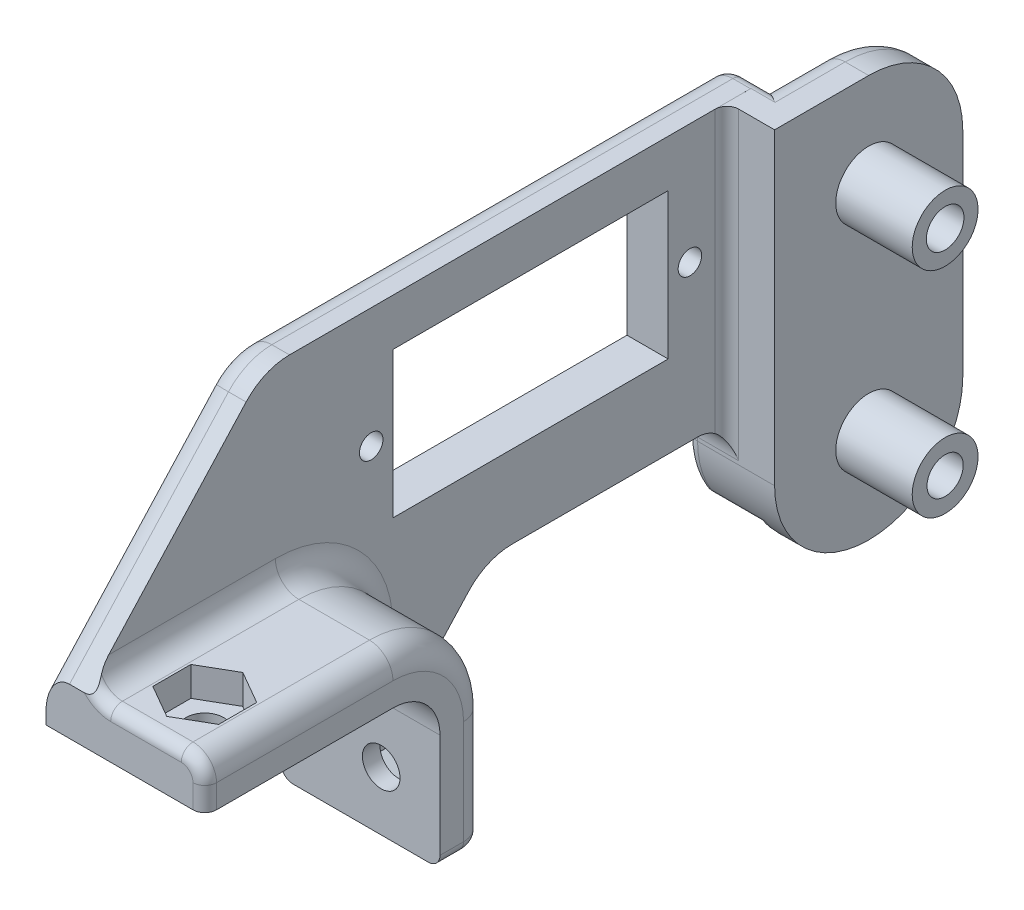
ISO-10303-21;
HEADER;
FILE_DESCRIPTION(('STEP AP214'),'2;1');
FILE_NAME('part.step','',(''),(''),'','','');
FILE_SCHEMA(('AUTOMOTIVE_DESIGN { 1 0 10303 214 1 1 1 1 }'));
ENDSEC;
DATA;
#1=APPLICATION_CONTEXT('core data for automotive mechanical design processes');
#2=APPLICATION_PROTOCOL_DEFINITION('international standard','automotive_design',2000,#1);
#3=PRODUCT_CONTEXT('',#1,'mechanical');
#4=PRODUCT('Part','Part','',(#3));
#5=PRODUCT_RELATED_PRODUCT_CATEGORY('part','',(#4));
#6=PRODUCT_DEFINITION_FORMATION('','',#4);
#7=PRODUCT_DEFINITION_CONTEXT('part definition',#1,'design');
#8=PRODUCT_DEFINITION('design','',#6,#7);
#9=PRODUCT_DEFINITION_SHAPE('','',#8);
#10=(LENGTH_UNIT() NAMED_UNIT(*) SI_UNIT(.MILLI.,.METRE.));
#11=(NAMED_UNIT(*) PLANE_ANGLE_UNIT() SI_UNIT($,.RADIAN.));
#12=(NAMED_UNIT(*) SI_UNIT($,.STERADIAN.) SOLID_ANGLE_UNIT());
#13=UNCERTAINTY_MEASURE_WITH_UNIT(LENGTH_MEASURE(1.E-05),#10,'distance_accuracy_value','');
#14=(GEOMETRIC_REPRESENTATION_CONTEXT(3) GLOBAL_UNCERTAINTY_ASSIGNED_CONTEXT((#13)) GLOBAL_UNIT_ASSIGNED_CONTEXT((#10,
#11,#12)) REPRESENTATION_CONTEXT('',''));
#15=CARTESIAN_POINT('',(0.,0.,0.));
#16=DIRECTION('',(0.,0.,1.));
#17=DIRECTION('',(1.,0.,0.));
#18=AXIS2_PLACEMENT_3D('',#15,#16,#17);
#19=CARTESIAN_POINT('',(7.55,68.3999999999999,-42.4));
#20=DIRECTION('',(1.,0.,0.));
#21=DIRECTION('',(0.,0.,-1.));
#22=AXIS2_PLACEMENT_3D('',#19,#20,#21);
#23=PLANE('',#22);
#24=CARTESIAN_POINT('',(7.55,68.3999999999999,-42.4));
#25=DIRECTION('',(1.,0.,0.));
#26=DIRECTION('',(0.,0.,-1.));
#27=AXIS2_PLACEMENT_3D('',#24,#25,#26);
#28=CIRCLE('',#27,2.8);
#29=CARTESIAN_POINT('',(7.55,68.3999999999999,-39.6));
#30=VERTEX_POINT('',#29);
#31=EDGE_CURVE('E529',#30,#30,#28,.T.);
#32=ORIENTED_EDGE('',*,*,#31,.F.);
#33=EDGE_LOOP('',(#32));
#34=FACE_BOUND('',#33,.T.);
#35=CARTESIAN_POINT('',(7.55,68.3999999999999,-42.4));
#36=DIRECTION('',(1.,0.,0.));
#37=DIRECTION('',(0.,0.,-1.));
#38=AXIS2_PLACEMENT_3D('',#35,#36,#37);
#39=CIRCLE('',#38,7.99927945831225);
#40=CARTESIAN_POINT('',(7.55,68.3999999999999,-50.3992794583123));
#41=VERTEX_POINT('',#40);
#42=CARTESIAN_POINT('',(7.55,76.3992794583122,-42.4));
#43=VERTEX_POINT('',#42);
#44=EDGE_CURVE('E614',#41,#43,#39,.T.);
#45=ORIENTED_EDGE('',*,*,#44,.T.);
#46=DIRECTION('',(0.,0.,1.));
#47=VECTOR('',#46,1.);
#48=CARTESIAN_POINT('',(7.55,76.3992794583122,-34.4007205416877));
#49=LINE('',#48,#47);
#50=CARTESIAN_POINT('',(7.55,76.3992794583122,-34.4007205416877));
#51=VERTEX_POINT('',#50);
#52=EDGE_CURVE('E617',#43,#51,#49,.T.);
#53=ORIENTED_EDGE('',*,*,#52,.T.);
#54=DIRECTION('',(0.,-1.,0.));
#55=VECTOR('',#54,1.);
#56=CARTESIAN_POINT('',(7.55,50.1908192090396,-34.4007205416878));
#57=LINE('',#56,#55);
#58=CARTESIAN_POINT('',(7.55,50.1908192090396,-34.4007205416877));
#59=VERTEX_POINT('',#58);
#60=EDGE_CURVE('E619',#51,#59,#57,.T.);
#61=ORIENTED_EDGE('',*,*,#60,.T.);
#62=CARTESIAN_POINT('',(7.55,50.1908192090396,-42.4));
#63=DIRECTION('',(1.,0.,0.));
#64=DIRECTION('',(0.,0.,-1.));
#65=AXIS2_PLACEMENT_3D('',#62,#63,#64);
#66=CIRCLE('',#65,7.99927945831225);
#67=CARTESIAN_POINT('',(7.55,50.1908192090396,-50.3992794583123));
#68=VERTEX_POINT('',#67);
#69=EDGE_CURVE('E622',#59,#68,#66,.T.);
#70=ORIENTED_EDGE('',*,*,#69,.T.);
#71=DIRECTION('',(0.,1.,0.));
#72=VECTOR('',#71,1.);
#73=CARTESIAN_POINT('',(7.55,68.3999999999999,-50.3992794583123));
#74=LINE('',#73,#72);
#75=EDGE_CURVE('E625',#68,#41,#74,.T.);
#76=ORIENTED_EDGE('',*,*,#75,.T.);
#77=EDGE_LOOP('',(#45,#53,#61,#70,#76));
#78=FACE_BOUND('',#77,.T.);
#79=CARTESIAN_POINT('',(7.55,50.1908192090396,-42.4));
#80=DIRECTION('',(1.,0.,0.));
#81=DIRECTION('',(0.,0.,-1.));
#82=AXIS2_PLACEMENT_3D('',#79,#80,#81);
#83=CIRCLE('',#82,2.8);
#84=CARTESIAN_POINT('',(7.55,50.1908192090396,-39.6));
#85=VERTEX_POINT('',#84);
#86=EDGE_CURVE('E2259',#85,#85,#83,.T.);
#87=ORIENTED_EDGE('',*,*,#86,.F.);
#88=EDGE_LOOP('',(#87));
#89=FACE_BOUND('',#88,.T.);
#90=ADVANCED_FACE('F37',(#34,#78,#89),#23,.T.);
#91=CARTESIAN_POINT('',(3.5,68.3999999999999,-42.4));
#92=DIRECTION('',(-1.,0.,0.));
#93=DIRECTION('',(0.,0.,1.));
#94=AXIS2_PLACEMENT_3D('',#91,#92,#93);
#95=CYLINDRICAL_SURFACE('',#94,1.6);
#96=CARTESIAN_POINT('',(6.05,68.3999999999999,-42.4));
#97=DIRECTION('',(-1.,0.,0.));
#98=DIRECTION('',(0.,0.,1.));
#99=AXIS2_PLACEMENT_3D('',#96,#97,#98);
#100=CIRCLE('',#99,1.6);
#101=CARTESIAN_POINT('',(6.05,68.3999999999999,-40.8));
#102=VERTEX_POINT('',#101);
#103=EDGE_CURVE('E553',#102,#102,#100,.T.);
#104=ORIENTED_EDGE('',*,*,#103,.T.);
#105=EDGE_LOOP('',(#104));
#106=FACE_BOUND('',#105,.T.);
#107=CARTESIAN_POINT('',(14.05,68.3999999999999,-42.4));
#108=DIRECTION('',(1.,0.,0.));
#109=DIRECTION('',(0.,0.,-1.));
#110=AXIS2_PLACEMENT_3D('',#107,#108,#109);
#111=CIRCLE('',#110,1.6);
#112=CARTESIAN_POINT('',(14.05,68.3999999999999,-44.));
#113=VERTEX_POINT('',#112);
#114=EDGE_CURVE('E2270',#113,#113,#111,.T.);
#115=ORIENTED_EDGE('',*,*,#114,.T.);
#116=EDGE_LOOP('',(#115));
#117=FACE_BOUND('',#116,.T.);
#118=ADVANCED_FACE('F1257',(#106,#117),#95,.F.);
#119=CARTESIAN_POINT('',(3.5,50.1908192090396,-42.4));
#120=DIRECTION('',(-1.,0.,0.));
#121=DIRECTION('',(0.,0.,1.));
#122=AXIS2_PLACEMENT_3D('',#119,#120,#121);
#123=CYLINDRICAL_SURFACE('',#122,1.6);
#124=CARTESIAN_POINT('',(7.55,50.1908192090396,-42.4));
#125=DIRECTION('',(1.,0.,0.));
#126=DIRECTION('',(0.,0.,-1.));
#127=AXIS2_PLACEMENT_3D('',#124,#125,#126);
#128=CIRCLE('',#127,1.6);
#129=CARTESIAN_POINT('',(7.55,50.1908192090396,-44.));
#130=VERTEX_POINT('',#129);
#131=EDGE_CURVE('E2265',#130,#130,#128,.T.);
#132=ORIENTED_EDGE('',*,*,#131,.T.);
#133=EDGE_LOOP('',(#132));
#134=FACE_BOUND('',#133,.T.);
#135=CARTESIAN_POINT('',(6.05,50.1908192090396,-42.4));
#136=DIRECTION('',(-1.,0.,0.));
#137=DIRECTION('',(0.,0.,1.));
#138=AXIS2_PLACEMENT_3D('',#135,#136,#137);
#139=CIRCLE('',#138,1.6);
#140=CARTESIAN_POINT('',(6.05,50.1908192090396,-40.8));
#141=VERTEX_POINT('',#140);
#142=EDGE_CURVE('E599',#141,#141,#139,.T.);
#143=ORIENTED_EDGE('',*,*,#142,.T.);
#144=EDGE_LOOP('',(#143));
#145=FACE_BOUND('',#144,.T.);
#146=ADVANCED_FACE('F1263',(#134,#145),#123,.F.);
#147=CARTESIAN_POINT('',(3.5,50.5,-31.9007205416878));
#148=DIRECTION('',(1.,0.,0.));
#149=DIRECTION('',(0.,0.,-1.));
#150=AXIS2_PLACEMENT_3D('',#147,#148,#149);
#151=PLANE('',#150);
#152=CARTESIAN_POINT('',(3.5,50.5,-31.9007205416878));
#153=DIRECTION('',(-1.,0.,0.));
#154=DIRECTION('',(0.,0.,-1.));
#155=AXIS2_PLACEMENT_3D('',#152,#153,#154);
#156=CIRCLE('',#155,2.5);
#157=CARTESIAN_POINT('',(3.5,53.,-31.9007205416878));
#158=VERTEX_POINT('',#157);
#159=CARTESIAN_POINT('',(3.5,52.5,-33.4007205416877));
#160=VERTEX_POINT('',#159);
#161=EDGE_CURVE('E790',#158,#160,#156,.T.);
#162=ORIENTED_EDGE('',*,*,#161,.T.);
#163=DIRECTION('',(0.,-1.,0.));
#164=VECTOR('',#163,1.);
#165=CARTESIAN_POINT('',(3.5,50.5,-33.4007205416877));
#166=LINE('',#165,#164);
#167=CARTESIAN_POINT('',(3.5,76.3992794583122,-33.4007205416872));
#168=VERTEX_POINT('',#167);
#169=EDGE_CURVE('E1113',#160,#168,#166,.F.);
#170=ORIENTED_EDGE('',*,*,#169,.T.);
#171=DIRECTION('',(0.,0.,1.));
#172=VECTOR('',#171,1.);
#173=CARTESIAN_POINT('',(3.5,76.3992794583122,-34.4007205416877));
#174=LINE('',#173,#172);
#175=CARTESIAN_POINT('',(3.5,76.3992794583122,-36.4386753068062));
#176=VERTEX_POINT('',#175);
#177=EDGE_CURVE('E613',#176,#168,#174,.T.);
#178=ORIENTED_EDGE('',*,*,#177,.F.);
#179=CARTESIAN_POINT('',(3.5,75.3999999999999,-36.4007205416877));
#180=DIRECTION('',(1.,0.,0.));
#181=DIRECTION('',(0.,0.,-1.));
#182=AXIS2_PLACEMENT_3D('',#179,#180,#181);
#183=CIRCLE('',#182,1.);
#184=CARTESIAN_POINT('',(3.5,76.3999999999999,-36.4007205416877));
#185=VERTEX_POINT('',#184);
#186=EDGE_CURVE('E1111',#176,#185,#183,.T.);
#187=ORIENTED_EDGE('',*,*,#186,.T.);
#188=DIRECTION('',(0.,0.,1.));
#189=VECTOR('',#188,1.);
#190=CARTESIAN_POINT('',(3.5,76.3999999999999,-42.4));
#191=LINE('',#190,#189);
#192=CARTESIAN_POINT('',(3.5,76.3999999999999,2.79719179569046));
#193=VERTEX_POINT('',#192);
#194=EDGE_CURVE('E793',#185,#193,#191,.T.);
#195=ORIENTED_EDGE('',*,*,#194,.T.);
#196=CARTESIAN_POINT('',(3.5,71.3999999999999,2.79719179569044));
#197=DIRECTION('',(1.,0.,0.));
#198=DIRECTION('',(0.,0.,1.));
#199=AXIS2_PLACEMENT_3D('',#196,#197,#198);
#200=CIRCLE('',#199,5.);
#201=CARTESIAN_POINT('',(3.5,74.7745461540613,6.48669559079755));
#202=VERTEX_POINT('',#201);
#203=EDGE_CURVE('E796',#193,#202,#200,.T.);
#204=ORIENTED_EDGE('',*,*,#203,.T.);
#205=DIRECTION('',(0.,-0.737900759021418,0.674909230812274));
#206=VECTOR('',#205,1.);
#207=CARTESIAN_POINT('',(3.5,60.,20.));
#208=LINE('',#207,#206);
#209=CARTESIAN_POINT('',(3.5,62.,18.1707317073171));
#210=VERTEX_POINT('',#209);
#211=EDGE_CURVE('E798',#202,#210,#208,.T.);
#212=ORIENTED_EDGE('',*,*,#211,.T.);
#213=DIRECTION('',(0.,0.,1.));
#214=VECTOR('',#213,1.);
#215=CARTESIAN_POINT('',(3.5,62.,-31.9007205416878));
#216=LINE('',#215,#214);
#217=CARTESIAN_POINT('',(3.5,62.,4.));
#218=VERTEX_POINT('',#217);
#219=EDGE_CURVE('E924',#210,#218,#216,.F.);
#220=ORIENTED_EDGE('',*,*,#219,.T.);
#221=CARTESIAN_POINT('',(3.5,52.,4.));
#222=DIRECTION('',(1.,0.,0.));
#223=DIRECTION('',(0.,0.,-1.));
#224=AXIS2_PLACEMENT_3D('',#221,#222,#223);
#225=CIRCLE('',#224,10.);
#226=CARTESIAN_POINT('',(3.5,52.,-6.));
#227=VERTEX_POINT('',#226);
#228=EDGE_CURVE('E920',#218,#227,#225,.F.);
#229=ORIENTED_EDGE('',*,*,#228,.T.);
#230=DIRECTION('',(0.,1.,0.));
#231=VECTOR('',#230,1.);
#232=CARTESIAN_POINT('',(3.5,50.5,-6.));
#233=LINE('',#232,#231);
#234=CARTESIAN_POINT('',(3.5,44.3366666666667,-6.));
#235=VERTEX_POINT('',#234);
#236=EDGE_CURVE('E922',#227,#235,#233,.F.);
#237=ORIENTED_EDGE('',*,*,#236,.T.);
#238=DIRECTION('',(0.,0.737900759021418,-0.674909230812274));
#239=VECTOR('',#238,1.);
#240=CARTESIAN_POINT('',(3.5,42.15,-4.));
#241=LINE('',#240,#239);
#242=CARTESIAN_POINT('',(3.5,51.3745461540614,-12.4370848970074));
#243=VERTEX_POINT('',#242);
#244=EDGE_CURVE('E801',#235,#243,#241,.T.);
#245=ORIENTED_EDGE('',*,*,#244,.T.);
#246=CARTESIAN_POINT('',(3.5,48.,-16.1265886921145));
#247=DIRECTION('',(-1.,0.,0.));
#248=DIRECTION('',(0.,0.,1.));
#249=AXIS2_PLACEMENT_3D('',#246,#247,#248);
#250=CIRCLE('',#249,5.);
#251=CARTESIAN_POINT('',(3.5,53.,-16.1265886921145));
#252=VERTEX_POINT('',#251);
#253=EDGE_CURVE('E803',#243,#252,#250,.T.);
#254=ORIENTED_EDGE('',*,*,#253,.T.);
#255=DIRECTION('',(0.,0.,-1.));
#256=VECTOR('',#255,1.);
#257=CARTESIAN_POINT('',(3.5,53.,-31.9007205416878));
#258=LINE('',#257,#256);
#259=EDGE_CURVE('E805',#252,#158,#258,.T.);
#260=ORIENTED_EDGE('',*,*,#259,.T.);
#261=EDGE_LOOP('',(#162,#170,#178,#187,#195,#204,#212,#220,#229,#237,#245,#254,#260));
#262=FACE_BOUND('',#261,.T.);
#263=CARTESIAN_POINT('',(3.5,66.2,-4.15));
#264=DIRECTION('',(1.,0.,0.));
#265=DIRECTION('',(0.,0.,1.));
#266=AXIS2_PLACEMENT_3D('',#263,#264,#265);
#267=CIRCLE('',#266,1.);
#268=CARTESIAN_POINT('',(3.5,66.2,-3.15));
#269=VERTEX_POINT('',#268);
#270=EDGE_CURVE('E747',#269,#269,#267,.T.);
#271=ORIENTED_EDGE('',*,*,#270,.F.);
#272=EDGE_LOOP('',(#271));
#273=FACE_BOUND('',#272,.T.);
#274=DIRECTION('',(0.,0.,-1.));
#275=VECTOR('',#274,1.);
#276=CARTESIAN_POINT('',(3.5,60.,-6.));
#277=LINE('',#276,#275);
#278=CARTESIAN_POINT('',(3.5,60.,-6.));
#279=VERTEX_POINT('',#278);
#280=CARTESIAN_POINT('',(3.5,60.,-29.4));
#281=VERTEX_POINT('',#280);
#282=EDGE_CURVE('E761',#279,#281,#277,.T.);
#283=ORIENTED_EDGE('',*,*,#282,.F.);
#284=DIRECTION('',(0.,-1.,0.));
#285=VECTOR('',#284,1.);
#286=CARTESIAN_POINT('',(3.5,72.3999999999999,-6.));
#287=LINE('',#286,#285);
#288=CARTESIAN_POINT('',(3.5,72.3999999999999,-6.));
#289=VERTEX_POINT('',#288);
#290=EDGE_CURVE('E759',#289,#279,#287,.T.);
#291=ORIENTED_EDGE('',*,*,#290,.F.);
#292=DIRECTION('',(0.,0.,1.));
#293=VECTOR('',#292,1.);
#294=CARTESIAN_POINT('',(3.5,72.3999999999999,-6.));
#295=LINE('',#294,#293);
#296=CARTESIAN_POINT('',(3.5,72.3999999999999,-29.4));
#297=VERTEX_POINT('',#296);
#298=EDGE_CURVE('E767',#297,#289,#295,.T.);
#299=ORIENTED_EDGE('',*,*,#298,.F.);
#300=DIRECTION('',(0.,1.,0.));
#301=VECTOR('',#300,1.);
#302=CARTESIAN_POINT('',(3.5,72.3999999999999,-29.4));
#303=LINE('',#302,#301);
#304=EDGE_CURVE('E764',#281,#297,#303,.T.);
#305=ORIENTED_EDGE('',*,*,#304,.F.);
#306=EDGE_LOOP('',(#283,#291,#299,#305));
#307=FACE_BOUND('',#306,.T.);
#308=CARTESIAN_POINT('',(3.5,66.2,-31.25));
#309=DIRECTION('',(1.,0.,0.));
#310=DIRECTION('',(0.,0.,-1.));
#311=AXIS2_PLACEMENT_3D('',#308,#309,#310);
#312=CIRCLE('',#311,0.999999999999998);
#313=CARTESIAN_POINT('',(3.5,66.2,-32.25));
#314=VERTEX_POINT('',#313);
#315=EDGE_CURVE('E753',#314,#314,#312,.T.);
#316=ORIENTED_EDGE('',*,*,#315,.F.);
#317=EDGE_LOOP('',(#316));
#318=FACE_BOUND('',#317,.T.);
#319=ADVANCED_FACE('F1310',(#262,#273,#307,#318),#151,.T.);
#320=CARTESIAN_POINT('',(8.5,56.,15.));
#321=DIRECTION('',(0.,1.,0.));
#322=DIRECTION('',(0.,0.,1.));
#323=AXIS2_PLACEMENT_3D('',#320,#321,#322);
#324=CYLINDRICAL_SURFACE('',#323,1.6);
#325=CARTESIAN_POINT('',(8.5,56.,15.));
#326=DIRECTION('',(0.,1.,0.));
#327=DIRECTION('',(0.,0.,1.));
#328=AXIS2_PLACEMENT_3D('',#325,#326,#327);
#329=CIRCLE('',#328,1.6);
#330=CARTESIAN_POINT('',(8.5,56.,16.6));
#331=VERTEX_POINT('',#330);
#332=EDGE_CURVE('E686',#331,#331,#329,.T.);
#333=ORIENTED_EDGE('',*,*,#332,.F.);
#334=EDGE_LOOP('',(#333));
#335=FACE_BOUND('',#334,.T.);
#336=CARTESIAN_POINT('',(8.5,57.5,15.));
#337=DIRECTION('',(0.,1.,0.));
#338=DIRECTION('',(0.,0.,1.));
#339=AXIS2_PLACEMENT_3D('',#336,#337,#338);
#340=CIRCLE('',#339,1.6);
#341=CARTESIAN_POINT('',(8.5,57.5,16.6));
#342=VERTEX_POINT('',#341);
#343=EDGE_CURVE('E675',#342,#342,#340,.F.);
#344=ORIENTED_EDGE('',*,*,#343,.F.);
#345=EDGE_LOOP('',(#344));
#346=FACE_BOUND('',#345,.T.);
#347=ADVANCED_FACE('F1306',(#335,#346),#324,.F.);
#348=CARTESIAN_POINT('',(8.5,47.15,0.));
#349=DIRECTION('',(0.,0.,-1.));
#350=DIRECTION('',(0.,1.,0.));
#351=AXIS2_PLACEMENT_3D('',#348,#349,#350);
#352=CYLINDRICAL_SURFACE('',#351,1.6);
#353=CARTESIAN_POINT('',(8.5,47.15,0.));
#354=DIRECTION('',(0.,0.,-1.));
#355=DIRECTION('',(0.,1.,0.));
#356=AXIS2_PLACEMENT_3D('',#353,#354,#355);
#357=CIRCLE('',#356,1.6);
#358=CARTESIAN_POINT('',(8.5,48.75,0.));
#359=VERTEX_POINT('',#358);
#360=EDGE_CURVE('E738',#359,#359,#357,.T.);
#361=ORIENTED_EDGE('',*,*,#360,.F.);
#362=EDGE_LOOP('',(#361));
#363=FACE_BOUND('',#362,.T.);
#364=CARTESIAN_POINT('',(8.5,47.15,-1.5));
#365=DIRECTION('',(0.,0.,-1.));
#366=DIRECTION('',(-1.,0.,0.));
#367=AXIS2_PLACEMENT_3D('',#364,#365,#366);
#368=CIRCLE('',#367,1.6);
#369=CARTESIAN_POINT('',(6.9,47.15,-1.5));
#370=VERTEX_POINT('',#369);
#371=EDGE_CURVE('E727',#370,#370,#368,.F.);
#372=ORIENTED_EDGE('',*,*,#371,.F.);
#373=EDGE_LOOP('',(#372));
#374=FACE_BOUND('',#373,.T.);
#375=ADVANCED_FACE('F1309',(#363,#374),#352,.F.);
#376=CARTESIAN_POINT('',(0.,50.5,-31.9007205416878));
#377=DIRECTION('',(1.,0.,0.));
#378=DIRECTION('',(0.,0.,-1.));
#379=AXIS2_PLACEMENT_3D('',#376,#377,#378);
#380=PLANE('',#379);
#381=DIRECTION('',(0.,0.,1.));
#382=VECTOR('',#381,1.);
#383=CARTESIAN_POINT('',(0.,74.3999999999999,-31.9007205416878));
#384=LINE('',#383,#382);
#385=CARTESIAN_POINT('',(0.,74.3999999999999,2.79719179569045));
#386=VERTEX_POINT('',#385);
#387=CARTESIAN_POINT('',(0.,74.3999999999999,-36.4007205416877));
#388=VERTEX_POINT('',#387);
#389=EDGE_CURVE('E892',#386,#388,#384,.F.);
#390=ORIENTED_EDGE('',*,*,#389,.T.);
#391=DIRECTION('',(0.,-1.,0.));
#392=VECTOR('',#391,1.);
#393=CARTESIAN_POINT('',(0.,50.5,-36.4007205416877));
#394=LINE('',#393,#392);
#395=CARTESIAN_POINT('',(0.,46.5854677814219,-36.4007205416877));
#396=VERTEX_POINT('',#395);
#397=EDGE_CURVE('E1438',#388,#396,#394,.T.);
#398=ORIENTED_EDGE('',*,*,#397,.T.);
#399=CARTESIAN_POINT('',(0.,50.1908192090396,-42.4));
#400=DIRECTION('',(1.,0.,0.));
#401=DIRECTION('',(0.,0.,-1.));
#402=AXIS2_PLACEMENT_3D('',#399,#400,#401);
#403=CIRCLE('',#402,6.99927945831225);
#404=CARTESIAN_POINT('',(0.,50.1908192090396,-35.4007205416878));
#405=VERTEX_POINT('',#404);
#406=EDGE_CURVE('E1473',#396,#405,#403,.F.);
#407=ORIENTED_EDGE('',*,*,#406,.T.);
#408=DIRECTION('',(0.,-1.,0.));
#409=VECTOR('',#408,1.);
#410=CARTESIAN_POINT('',(0.,50.5000000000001,-35.4007205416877));
#411=LINE('',#410,#409);
#412=CARTESIAN_POINT('',(0.,50.5,-35.4007205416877));
#413=VERTEX_POINT('',#412);
#414=EDGE_CURVE('E1476',#405,#413,#411,.F.);
#415=ORIENTED_EDGE('',*,*,#414,.T.);
#416=CARTESIAN_POINT('',(0.,50.5,-31.9007205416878));
#417=DIRECTION('',(1.,0.,0.));
#418=DIRECTION('',(0.,0.,-1.));
#419=AXIS2_PLACEMENT_3D('',#416,#417,#418);
#420=CIRCLE('',#419,3.5);
#421=CARTESIAN_POINT('',(0.,54.,-31.9007205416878));
#422=VERTEX_POINT('',#421);
#423=EDGE_CURVE('E1479',#413,#422,#420,.T.);
#424=ORIENTED_EDGE('',*,*,#423,.T.);
#425=DIRECTION('',(0.,0.,-1.));
#426=VECTOR('',#425,1.);
#427=CARTESIAN_POINT('',(0.,54.,-31.9007205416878));
#428=LINE('',#427,#426);
#429=CARTESIAN_POINT('',(0.,54.,-16.1265886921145));
#430=VERTEX_POINT('',#429);
#431=EDGE_CURVE('E1493',#422,#430,#428,.F.);
#432=ORIENTED_EDGE('',*,*,#431,.T.);
#433=CARTESIAN_POINT('',(0.,48.,-16.1265886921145));
#434=DIRECTION('',(1.,0.,0.));
#435=DIRECTION('',(0.,0.,-1.));
#436=AXIS2_PLACEMENT_3D('',#433,#434,#435);
#437=CIRCLE('',#436,6.);
#438=CARTESIAN_POINT('',(0.,52.0494553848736,-11.699184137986));
#439=VERTEX_POINT('',#438);
#440=EDGE_CURVE('E1413',#430,#439,#437,.T.);
#441=ORIENTED_EDGE('',*,*,#440,.T.);
#442=DIRECTION('',(0.,0.737900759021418,-0.674909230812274));
#443=VECTOR('',#442,1.);
#444=CARTESIAN_POINT('',(0.,61.2664697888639,-20.1293802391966));
#445=LINE('',#444,#443);
#446=CARTESIAN_POINT('',(0.,43.15,-3.55943835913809));
#447=VERTEX_POINT('',#446);
#448=EDGE_CURVE('E1444',#439,#447,#445,.F.);
#449=ORIENTED_EDGE('',*,*,#448,.T.);
#450=DIRECTION('',(0.,0.,-1.));
#451=VECTOR('',#450,1.);
#452=CARTESIAN_POINT('',(0.,43.15,-31.9007205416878));
#453=LINE('',#452,#451);
#454=CARTESIAN_POINT('',(0.,43.15,0.));
#455=VERTEX_POINT('',#454);
#456=EDGE_CURVE('E1440',#447,#455,#453,.F.);
#457=ORIENTED_EDGE('',*,*,#456,.T.);
#458=DIRECTION('',(0.,-1.,0.));
#459=VECTOR('',#458,1.);
#460=CARTESIAN_POINT('',(0.,56.,0.));
#461=LINE('',#460,#459);
#462=CARTESIAN_POINT('',(0.,52.,0.));
#463=VERTEX_POINT('',#462);
#464=EDGE_CURVE('E794',#463,#455,#461,.T.);
#465=ORIENTED_EDGE('',*,*,#464,.F.);
#466=CARTESIAN_POINT('',(0.,52.,4.));
#467=DIRECTION('',(1.,0.,0.));
#468=DIRECTION('',(0.,0.,-1.));
#469=AXIS2_PLACEMENT_3D('',#466,#467,#468);
#470=CIRCLE('',#469,4.);
#471=CARTESIAN_POINT('',(0.,56.,4.));
#472=VERTEX_POINT('',#471);
#473=EDGE_CURVE('E862',#463,#472,#470,.T.);
#474=ORIENTED_EDGE('',*,*,#473,.T.);
#475=DIRECTION('',(0.,0.,-1.));
#476=VECTOR('',#475,1.);
#477=CARTESIAN_POINT('',(0.,56.,20.));
#478=LINE('',#477,#476);
#479=CARTESIAN_POINT('',(0.,56.,20.));
#480=VERTEX_POINT('',#479);
#481=EDGE_CURVE('E810',#480,#472,#478,.T.);
#482=ORIENTED_EDGE('',*,*,#481,.F.);
#483=DIRECTION('',(0.,-1.,0.));
#484=VECTOR('',#483,1.);
#485=CARTESIAN_POINT('',(0.,60.,20.));
#486=LINE('',#485,#484);
#487=CARTESIAN_POINT('',(0.,57.0366385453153,20.));
#488=VERTEX_POINT('',#487);
#489=EDGE_CURVE('E789',#488,#480,#486,.T.);
#490=ORIENTED_EDGE('',*,*,#489,.F.);
#491=DIRECTION('',(0.,-0.737900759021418,0.674909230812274));
#492=VECTOR('',#491,1.);
#493=CARTESIAN_POINT('',(0.,79.3248459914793,-0.385555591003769));
#494=LINE('',#493,#492);
#495=CARTESIAN_POINT('',(0.,73.4247276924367,5.01089407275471));
#496=VERTEX_POINT('',#495);
#497=EDGE_CURVE('E897',#488,#496,#494,.F.);
#498=ORIENTED_EDGE('',*,*,#497,.T.);
#499=CARTESIAN_POINT('',(0.,71.3999999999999,2.79719179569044));
#500=DIRECTION('',(1.,0.,0.));
#501=DIRECTION('',(0.,0.,-1.));
#502=AXIS2_PLACEMENT_3D('',#499,#500,#501);
#503=CIRCLE('',#502,3.);
#504=EDGE_CURVE('E895',#496,#386,#503,.F.);
#505=ORIENTED_EDGE('',*,*,#504,.T.);
#506=EDGE_LOOP('',(#390,#398,#407,#415,#424,#432,#441,#449,#457,#465,#474,#482,#490,#498,#505));
#507=FACE_BOUND('',#506,.T.);
#508=CARTESIAN_POINT('',(0.,66.2,-31.25));
#509=DIRECTION('',(1.,0.,0.));
#510=DIRECTION('',(0.,0.,-1.));
#511=AXIS2_PLACEMENT_3D('',#508,#509,#510);
#512=CIRCLE('',#511,0.999999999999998);
#513=CARTESIAN_POINT('',(0.,66.2,-32.25));
#514=VERTEX_POINT('',#513);
#515=EDGE_CURVE('E750',#514,#514,#512,.T.);
#516=ORIENTED_EDGE('',*,*,#515,.T.);
#517=EDGE_LOOP('',(#516));
#518=FACE_BOUND('',#517,.T.);
#519=DIRECTION('',(0.,-1.,0.));
#520=VECTOR('',#519,1.);
#521=CARTESIAN_POINT('',(0.,72.3999999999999,-6.));
#522=LINE('',#521,#520);
#523=CARTESIAN_POINT('',(0.,72.3999999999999,-6.));
#524=VERTEX_POINT('',#523);
#525=CARTESIAN_POINT('',(0.,60.,-6.));
#526=VERTEX_POINT('',#525);
#527=EDGE_CURVE('E756',#524,#526,#522,.T.);
#528=ORIENTED_EDGE('',*,*,#527,.T.);
#529=DIRECTION('',(0.,0.,-1.));
#530=VECTOR('',#529,1.);
#531=CARTESIAN_POINT('',(0.,60.,-6.));
#532=LINE('',#531,#530);
#533=CARTESIAN_POINT('',(0.,60.,-29.4));
#534=VERTEX_POINT('',#533);
#535=EDGE_CURVE('E772',#526,#534,#532,.T.);
#536=ORIENTED_EDGE('',*,*,#535,.T.);
#537=DIRECTION('',(0.,1.,0.));
#538=VECTOR('',#537,1.);
#539=CARTESIAN_POINT('',(0.,72.3999999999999,-29.4));
#540=LINE('',#539,#538);
#541=CARTESIAN_POINT('',(0.,72.3999999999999,-29.4));
#542=VERTEX_POINT('',#541);
#543=EDGE_CURVE('E775',#534,#542,#540,.T.);
#544=ORIENTED_EDGE('',*,*,#543,.T.);
#545=DIRECTION('',(0.,0.,1.));
#546=VECTOR('',#545,1.);
#547=CARTESIAN_POINT('',(0.,72.3999999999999,-6.));
#548=LINE('',#547,#546);
#549=EDGE_CURVE('E762',#542,#524,#548,.T.);
#550=ORIENTED_EDGE('',*,*,#549,.T.);
#551=EDGE_LOOP('',(#528,#536,#544,#550));
#552=FACE_BOUND('',#551,.T.);
#553=CARTESIAN_POINT('',(0.,66.2,-4.15));
#554=DIRECTION('',(1.,0.,0.));
#555=DIRECTION('',(0.,0.,1.));
#556=AXIS2_PLACEMENT_3D('',#553,#554,#555);
#557=CIRCLE('',#556,1.);
#558=CARTESIAN_POINT('',(0.,66.2,-3.15));
#559=VERTEX_POINT('',#558);
#560=EDGE_CURVE('E746',#559,#559,#557,.T.);
#561=ORIENTED_EDGE('',*,*,#560,.T.);
#562=EDGE_LOOP('',(#561));
#563=FACE_BOUND('',#562,.T.);
#564=ADVANCED_FACE('F1050',(#507,#518,#552,#563),#380,.F.);
#565=CARTESIAN_POINT('',(3.5,50.5,-31.9007205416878));
#566=DIRECTION('',(-1.,0.,0.));
#567=DIRECTION('',(0.,0.,1.));
#568=AXIS2_PLACEMENT_3D('',#565,#566,#567);
#569=CYLINDRICAL_SURFACE('',#568,2.5);
#570=DIRECTION('',(-1.,0.,0.));
#571=VECTOR('',#570,1.);
#572=CARTESIAN_POINT('',(3.5,53.,-31.9007205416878));
#573=LINE('',#572,#571);
#574=CARTESIAN_POINT('',(1.,53.,-31.9007205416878));
#575=VERTEX_POINT('',#574);
#576=EDGE_CURVE('E807',#158,#575,#573,.T.);
#577=ORIENTED_EDGE('',*,*,#576,.T.);
#578=CARTESIAN_POINT('',(1.,50.5,-31.9007205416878));
#579=DIRECTION('',(1.,0.,0.));
#580=DIRECTION('',(0.,0.,-1.));
#581=AXIS2_PLACEMENT_3D('',#578,#579,#580);
#582=CIRCLE('',#581,2.5);
#583=CARTESIAN_POINT('',(1.,50.5,-34.4007205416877));
#584=VERTEX_POINT('',#583);
#585=EDGE_CURVE('E1457',#575,#584,#582,.F.);
#586=ORIENTED_EDGE('',*,*,#585,.T.);
#587=DIRECTION('',(-1.,0.,0.));
#588=VECTOR('',#587,1.);
#589=CARTESIAN_POINT('',(3.5,50.5,-34.4007205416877));
#590=LINE('',#589,#588);
#591=CARTESIAN_POINT('',(4.5,50.5,-34.4007205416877));
#592=VERTEX_POINT('',#591);
#593=EDGE_CURVE('E845',#592,#584,#590,.T.);
#594=ORIENTED_EDGE('',*,*,#593,.F.);
#595=CARTESIAN_POINT('',(3.5,52.5,-33.4007205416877));
#596=CARTESIAN_POINT('',(3.50000402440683,52.474348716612,-33.434931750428));
#597=CARTESIAN_POINT('',(3.50175453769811,52.4478362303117,-33.4684435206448));
#598=CARTESIAN_POINT('',(3.5083551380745,52.3933389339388,-33.5338370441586));
#599=CARTESIAN_POINT('',(3.51319986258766,52.3653567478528,-33.565721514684));
#600=CARTESIAN_POINT('',(3.53167461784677,52.2800086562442,-33.6581484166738));
#601=CARTESIAN_POINT('',(3.5492612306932,52.2207259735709,-33.7161469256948));
#602=CARTESIAN_POINT('',(3.60159194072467,52.0725131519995,-33.8477121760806));
#603=CARTESIAN_POINT('',(3.64045002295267,51.9816780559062,-33.9174401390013));
#604=CARTESIAN_POINT('',(3.72909893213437,51.7947669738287,-34.0422883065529));
#605=CARTESIAN_POINT('',(3.77895554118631,51.698662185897,-34.097316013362));
#606=CARTESIAN_POINT('',(3.87012580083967,51.5320059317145,-34.1790701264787));
#607=CARTESIAN_POINT('',(3.90967784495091,51.4621948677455,-34.2093676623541));
#608=CARTESIAN_POINT('',(3.99139658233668,51.3214584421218,-34.2631098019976));
#609=CARTESIAN_POINT('',(4.03356442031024,51.2505326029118,-34.2865513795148));
#610=CARTESIAN_POINT('',(4.1625948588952,51.0369402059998,-34.3468517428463));
#611=CARTESIAN_POINT('',(4.25221929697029,50.893043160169,-34.3738849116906));
#612=CARTESIAN_POINT('',(4.39328183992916,50.6687555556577,-34.3963140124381));
#613=CARTESIAN_POINT('',(4.44396402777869,50.5886013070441,-34.4004354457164));
#614=CARTESIAN_POINT('',(4.49643651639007,50.5056343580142,-34.4007157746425));
#615=CARTESIAN_POINT('',(4.49821826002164,50.5028171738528,-34.4007205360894));
#616=CARTESIAN_POINT('',(4.5,50.5,-34.4007205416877));
#617=B_SPLINE_CURVE_WITH_KNOTS('',3,(#595,#596,#597,#598,#599,#600,#601,#602,#603,#604,#605,
#606,#607,#608,#609,#610,#611,#612,#613,#614,#615,#616),.UNSPECIFIED.,.F.,.F.,(4,2,2,2,2,2,2,2,
2,2,4),(0.,0.128161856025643,0.256102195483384,0.509450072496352,0.870315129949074,
1.23340004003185,1.49037285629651,1.74745893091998,2.26009785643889,2.54460067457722,
2.55460068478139),.UNSPECIFIED.);
#618=EDGE_CURVE('E1053',#592,#160,#617,.F.);
#619=ORIENTED_EDGE('',*,*,#618,.T.);
#620=ORIENTED_EDGE('',*,*,#161,.F.);
#621=EDGE_LOOP('',(#577,#586,#594,#619,#620));
#622=FACE_BOUND('',#621,.T.);
#623=ADVANCED_FACE('F1046',(#622),#569,.F.);
#624=CARTESIAN_POINT('',(3.5,50.1908192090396,-34.4007205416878));
#625=DIRECTION('',(0.,0.,-1.));
#626=DIRECTION('',(0.,1.,0.));
#627=AXIS2_PLACEMENT_3D('',#624,#625,#626);
#628=PLANE('',#627);
#629=ORIENTED_EDGE('',*,*,#593,.T.);
#630=DIRECTION('',(0.,-1.,0.));
#631=VECTOR('',#630,1.);
#632=CARTESIAN_POINT('',(1.,50.1908192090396,-34.4007205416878));
#633=LINE('',#632,#631);
#634=CARTESIAN_POINT('',(1.,50.1908192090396,-34.4007205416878));
#635=VERTEX_POINT('',#634);
#636=EDGE_CURVE('E1455',#584,#635,#633,.T.);
#637=ORIENTED_EDGE('',*,*,#636,.T.);
#638=DIRECTION('',(-1.,0.,0.));
#639=VECTOR('',#638,1.);
#640=CARTESIAN_POINT('',(3.5,50.1908192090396,-34.4007205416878));
#641=LINE('',#640,#639);
#642=EDGE_CURVE('E842',#59,#635,#641,.T.);
#643=ORIENTED_EDGE('',*,*,#642,.F.);
#644=ORIENTED_EDGE('',*,*,#60,.F.);
#645=DIRECTION('',(-1.,0.,0.));
#646=VECTOR('',#645,1.);
#647=CARTESIAN_POINT('',(7.55,76.3992794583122,-34.4007205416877));
#648=LINE('',#647,#646);
#649=CARTESIAN_POINT('',(4.5,76.3992794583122,-34.4007205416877));
#650=VERTEX_POINT('',#649);
#651=EDGE_CURVE('E631',#51,#650,#648,.T.);
#652=ORIENTED_EDGE('',*,*,#651,.T.);
#653=DIRECTION('',(0.,-1.,0.));
#654=VECTOR('',#653,1.);
#655=CARTESIAN_POINT('',(4.5,50.1908192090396,-34.4007205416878));
#656=LINE('',#655,#654);
#657=EDGE_CURVE('E1452',#650,#592,#656,.T.);
#658=ORIENTED_EDGE('',*,*,#657,.T.);
#659=EDGE_LOOP('',(#629,#637,#643,#644,#652,#658));
#660=FACE_BOUND('',#659,.T.);
#661=ADVANCED_FACE('F1042',(#660),#628,.F.);
#662=CARTESIAN_POINT('',(3.5,50.1908192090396,-42.4));
#663=DIRECTION('',(-1.,0.,0.));
#664=DIRECTION('',(0.,0.,1.));
#665=AXIS2_PLACEMENT_3D('',#662,#663,#664);
#666=CYLINDRICAL_SURFACE('',#665,7.99927945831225);
#667=ORIENTED_EDGE('',*,*,#642,.T.);
#668=CARTESIAN_POINT('',(1.,50.1908192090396,-42.4));
#669=DIRECTION('',(1.,0.,0.));
#670=DIRECTION('',(0.,0.,-1.));
#671=AXIS2_PLACEMENT_3D('',#668,#669,#670);
#672=CIRCLE('',#671,7.99927945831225);
#673=CARTESIAN_POINT('',(1.,46.0703645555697,-35.5435923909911));
#674=VERTEX_POINT('',#673);
#675=EDGE_CURVE('E1450',#635,#674,#672,.T.);
#676=ORIENTED_EDGE('',*,*,#675,.T.);
#677=DIRECTION('',(-1.,0.,0.));
#678=VECTOR('',#677,1.);
#679=CARTESIAN_POINT('',(3.5,46.0703645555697,-35.5435923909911));
#680=LINE('',#679,#678);
#681=CARTESIAN_POINT('',(5.55,46.0703645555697,-35.5435923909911));
#682=VERTEX_POINT('',#681);
#683=EDGE_CURVE('E1442',#674,#682,#680,.F.);
#684=ORIENTED_EDGE('',*,*,#683,.T.);
#685=CARTESIAN_POINT('',(5.55,50.1908192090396,-42.4));
#686=DIRECTION('',(1.,0.,0.));
#687=DIRECTION('',(0.,0.,-1.));
#688=AXIS2_PLACEMENT_3D('',#685,#686,#687);
#689=CIRCLE('',#688,7.99927945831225);
#690=CARTESIAN_POINT('',(5.55,50.1908192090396,-50.3992794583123));
#691=VERTEX_POINT('',#690);
#692=EDGE_CURVE('E872',#682,#691,#689,.T.);
#693=ORIENTED_EDGE('',*,*,#692,.T.);
#694=DIRECTION('',(-1.,0.,0.));
#695=VECTOR('',#694,1.);
#696=CARTESIAN_POINT('',(3.5,50.1908192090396,-50.3992794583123));
#697=LINE('',#696,#695);
#698=EDGE_CURVE('E839',#68,#691,#697,.T.);
#699=ORIENTED_EDGE('',*,*,#698,.F.);
#700=ORIENTED_EDGE('',*,*,#69,.F.);
#701=EDGE_LOOP('',(#667,#676,#684,#693,#699,#700));
#702=FACE_BOUND('',#701,.T.);
#703=ADVANCED_FACE('F1038',(#702),#666,.T.);
#704=CARTESIAN_POINT('',(3.5,50.1908192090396,-50.3992794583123));
#705=DIRECTION('',(0.,0.,1.));
#706=DIRECTION('',(0.,-1.,0.));
#707=AXIS2_PLACEMENT_3D('',#704,#705,#706);
#708=PLANE('',#707);
#709=ORIENTED_EDGE('',*,*,#698,.T.);
#710=DIRECTION('',(0.,1.,0.));
#711=VECTOR('',#710,1.);
#712=CARTESIAN_POINT('',(5.55,50.1908192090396,-50.3992794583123));
#713=LINE('',#712,#711);
#714=CARTESIAN_POINT('',(5.55,68.3999999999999,-50.3992794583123));
#715=VERTEX_POINT('',#714);
#716=EDGE_CURVE('E883',#691,#715,#713,.T.);
#717=ORIENTED_EDGE('',*,*,#716,.T.);
#718=DIRECTION('',(-1.,0.,0.));
#719=VECTOR('',#718,1.);
#720=CARTESIAN_POINT('',(7.55,68.3999999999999,-50.3992794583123));
#721=LINE('',#720,#719);
#722=EDGE_CURVE('E627',#41,#715,#721,.T.);
#723=ORIENTED_EDGE('',*,*,#722,.F.);
#724=ORIENTED_EDGE('',*,*,#75,.F.);
#725=EDGE_LOOP('',(#709,#717,#723,#724));
#726=FACE_BOUND('',#725,.T.);
#727=ADVANCED_FACE('F1034',(#726),#708,.F.);
#728=CARTESIAN_POINT('',(3.5,76.3999999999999,-42.4));
#729=DIRECTION('',(0.,-1.,0.));
#730=DIRECTION('',(0.,0.,-1.));
#731=AXIS2_PLACEMENT_3D('',#728,#729,#730);
#732=PLANE('',#731);
#733=ORIENTED_EDGE('',*,*,#194,.F.);
#734=DIRECTION('',(1.,0.,0.));
#735=VECTOR('',#734,1.);
#736=CARTESIAN_POINT('',(3.5,76.3999999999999,-36.4007205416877));
#737=LINE('',#736,#735);
#738=CARTESIAN_POINT('',(2.,76.3999999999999,-36.4007205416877));
#739=VERTEX_POINT('',#738);
#740=EDGE_CURVE('E1016',#185,#739,#737,.F.);
#741=ORIENTED_EDGE('',*,*,#740,.T.);
#742=DIRECTION('',(0.,0.,1.));
#743=VECTOR('',#742,1.);
#744=CARTESIAN_POINT('',(2.,76.3999999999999,-42.4));
#745=LINE('',#744,#743);
#746=CARTESIAN_POINT('',(2.,76.3999999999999,2.79719179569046));
#747=VERTEX_POINT('',#746);
#748=EDGE_CURVE('E928',#739,#747,#745,.T.);
#749=ORIENTED_EDGE('',*,*,#748,.T.);
#750=DIRECTION('',(-1.,0.,0.));
#751=VECTOR('',#750,1.);
#752=CARTESIAN_POINT('',(3.5,76.3999999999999,2.79719179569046));
#753=LINE('',#752,#751);
#754=EDGE_CURVE('E836',#193,#747,#753,.T.);
#755=ORIENTED_EDGE('',*,*,#754,.F.);
#756=EDGE_LOOP('',(#733,#741,#749,#755));
#757=FACE_BOUND('',#756,.T.);
#758=ADVANCED_FACE('F1030',(#757),#732,.F.);
#759=CARTESIAN_POINT('',(3.5,71.3999999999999,2.79719179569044));
#760=DIRECTION('',(-1.,0.,0.));
#761=DIRECTION('',(0.,0.,1.));
#762=AXIS2_PLACEMENT_3D('',#759,#760,#761);
#763=CYLINDRICAL_SURFACE('',#762,5.);
#764=ORIENTED_EDGE('',*,*,#754,.T.);
#765=CARTESIAN_POINT('',(2.,71.3999999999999,2.79719179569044));
#766=DIRECTION('',(1.,0.,0.));
#767=DIRECTION('',(0.,0.,-1.));
#768=AXIS2_PLACEMENT_3D('',#765,#766,#767);
#769=CIRCLE('',#768,5.);
#770=CARTESIAN_POINT('',(2.,74.7745461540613,6.48669559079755));
#771=VERTEX_POINT('',#770);
#772=EDGE_CURVE('E899',#747,#771,#769,.T.);
#773=ORIENTED_EDGE('',*,*,#772,.T.);
#774=DIRECTION('',(-1.,0.,0.));
#775=VECTOR('',#774,1.);
#776=CARTESIAN_POINT('',(3.5,74.7745461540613,6.48669559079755));
#777=LINE('',#776,#775);
#778=EDGE_CURVE('E833',#202,#771,#777,.T.);
#779=ORIENTED_EDGE('',*,*,#778,.F.);
#780=ORIENTED_EDGE('',*,*,#203,.F.);
#781=EDGE_LOOP('',(#764,#773,#779,#780));
#782=FACE_BOUND('',#781,.T.);
#783=ADVANCED_FACE('F1025',(#782),#763,.T.);
#784=CARTESIAN_POINT('',(3.5,60.,20.));
#785=DIRECTION('',(0.,-0.674909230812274,-0.737900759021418));
#786=DIRECTION('',(0.,0.737900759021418,-0.674909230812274));
#787=AXIS2_PLACEMENT_3D('',#784,#785,#786);
#788=PLANE('',#787);
#789=DIRECTION('',(-1.,0.,0.));
#790=VECTOR('',#789,1.);
#791=CARTESIAN_POINT('',(3.5,60.,20.));
#792=LINE('',#791,#790);
#793=CARTESIAN_POINT('',(3.26393202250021,60.,20.));
#794=VERTEX_POINT('',#793);
#795=CARTESIAN_POINT('',(2.,60.,20.));
#796=VERTEX_POINT('',#795);
#797=EDGE_CURVE('E831',#794,#796,#792,.T.);
#798=ORIENTED_EDGE('',*,*,#797,.F.);
#799=CARTESIAN_POINT('',(3.26393202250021,60.,20.));
#800=CARTESIAN_POINT('',(3.3088495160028,60.0000410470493,19.9999624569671));
#801=CARTESIAN_POINT('',(3.35395283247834,60.0018489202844,19.9983089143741));
#802=CARTESIAN_POINT('',(3.44408721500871,60.0098538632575,19.9909873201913));
#803=CARTESIAN_POINT('',(3.48910742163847,60.016115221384,19.9852604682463));
#804=CARTESIAN_POINT('',(3.5680102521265,60.0320639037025,19.9706732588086));
#805=CARTESIAN_POINT('',(3.60225032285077,60.0407587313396,19.9627206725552));
#806=CARTESIAN_POINT('',(3.66836369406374,60.0619793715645,19.9433115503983));
#807=CARTESIAN_POINT('',(3.70024787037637,60.0744860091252,19.9318725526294));
#808=CARTESIAN_POINT('',(3.75284952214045,60.1001933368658,19.9083597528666));
#809=CARTESIAN_POINT('',(3.7743882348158,60.1124721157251,19.8971291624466));
#810=CARTESIAN_POINT('',(3.8144161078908,60.1395043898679,19.8724045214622));
#811=CARTESIAN_POINT('',(3.83290725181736,60.1542562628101,19.8589119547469));
#812=CARTESIAN_POINT('',(3.86607834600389,60.1860380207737,19.8298432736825));
#813=CARTESIAN_POINT('',(3.88074268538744,60.2030768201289,19.8142590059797));
#814=CARTESIAN_POINT('',(3.90572196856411,60.2387954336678,19.781589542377));
#815=CARTESIAN_POINT('',(3.9160364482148,60.2574754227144,19.7645041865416));
#816=CARTESIAN_POINT('',(3.93461406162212,60.3007571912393,19.7249172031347));
#817=CARTESIAN_POINT('',(3.9416538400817,60.3256395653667,19.7021589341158));
#818=CARTESIAN_POINT('',(3.95036074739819,60.3759190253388,19.6561716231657));
#819=CARTESIAN_POINT('',(3.95201063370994,60.4013175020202,19.6329413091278));
#820=CARTESIAN_POINT('',(3.9512587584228,60.4595179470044,19.5797091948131));
#821=CARTESIAN_POINT('',(3.94752245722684,60.4923000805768,19.5497255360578));
#822=CARTESIAN_POINT('',(3.93579020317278,60.5574696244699,19.4901192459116));
#823=CARTESIAN_POINT('',(3.92778395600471,60.5898558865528,19.4604976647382));
#824=CARTESIAN_POINT('',(3.90894577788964,60.6544274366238,19.4014383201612));
#825=CARTESIAN_POINT('',(3.89809230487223,60.686609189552,19.3720037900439));
#826=CARTESIAN_POINT('',(3.8745555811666,60.7505622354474,19.3135101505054));
#827=CARTESIAN_POINT('',(3.86187417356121,60.7823339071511,19.2844506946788));
#828=CARTESIAN_POINT('',(3.82861233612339,60.8614390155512,19.2120984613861));
#829=CARTESIAN_POINT('',(3.80725767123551,60.9085937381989,19.1689691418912));
#830=CARTESIAN_POINT('',(3.77413988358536,60.9785963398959,19.1049423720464));
#831=CARTESIAN_POINT('',(3.7630198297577,61.0016139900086,19.0838896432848));
#832=CARTESIAN_POINT('',(3.74042382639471,61.0475461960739,19.0418784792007));
#833=CARTESIAN_POINT('',(3.7289479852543,61.0704607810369,19.0209200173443));
#834=CARTESIAN_POINT('',(3.71731787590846,61.0933333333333,19.));
#835=B_SPLINE_CURVE_WITH_KNOTS('',3,(#799,#800,#801,#802,#803,#804,#805,#806,#807,#808,#809,
#810,#811,#812,#813,#814,#815,#816,#817,#818,#819,#820,#821,#822,#823,#824,#825,#826,#827,#828,
#829,#830,#831,#832,#833,#834),.UNSPECIFIED.,.F.,.F.,(4,2,2,2,2,2,2,2,2,2,2,2,2,2,2,2,2,4),(0.,
0.134989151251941,0.271967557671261,0.380250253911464,0.48799698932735,0.569327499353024,
0.650604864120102,0.732208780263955,0.813821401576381,0.916573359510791,1.01965370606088,
1.15305497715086,1.28677932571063,1.42154617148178,1.5561780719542,1.75826416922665,
1.85761208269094,1.95693002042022),.UNSPECIFIED.);
#836=CARTESIAN_POINT('',(3.71731787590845,61.0933333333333,19.));
#837=VERTEX_POINT('',#836);
#838=EDGE_CURVE('E1009',#794,#837,#835,.T.);
#839=ORIENTED_EDGE('',*,*,#838,.T.);
#840=CARTESIAN_POINT('',(5.5,62.,18.1707317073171));
#841=DIRECTION('',(0.,-0.674909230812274,-0.737900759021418));
#842=DIRECTION('',(0.,-0.737900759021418,0.674909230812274));
#843=AXIS2_PLACEMENT_3D('',#840,#841,#842);
#844=ELLIPSE('',#843,2.71039157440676,2.);
#845=EDGE_CURVE('E938',#837,#210,#844,.T.);
#846=ORIENTED_EDGE('',*,*,#845,.T.);
#847=ORIENTED_EDGE('',*,*,#211,.F.);
#848=ORIENTED_EDGE('',*,*,#778,.T.);
#849=DIRECTION('',(0.,-0.737900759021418,0.674909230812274));
#850=VECTOR('',#849,1.);
#851=CARTESIAN_POINT('',(2.,60.,20.));
#852=LINE('',#851,#850);
#853=EDGE_CURVE('E887',#771,#796,#852,.T.);
#854=ORIENTED_EDGE('',*,*,#853,.T.);
#855=EDGE_LOOP('',(#798,#839,#846,#847,#848,#854));
#856=FACE_BOUND('',#855,.T.);
#857=ADVANCED_FACE('F1019',(#856),#788,.F.);
#858=CARTESIAN_POINT('',(3.5,60.,20.));
#859=DIRECTION('',(0.,0.,-1.));
#860=DIRECTION('',(0.,1.,0.));
#861=AXIS2_PLACEMENT_3D('',#858,#859,#860);
#862=PLANE('',#861);
#863=DIRECTION('',(-1.,0.,0.));
#864=VECTOR('',#863,1.);
#865=CARTESIAN_POINT('',(3.5,56.,20.));
#866=LINE('',#865,#864);
#867=CARTESIAN_POINT('',(12.5,56.,20.));
#868=VERTEX_POINT('',#867);
#869=EDGE_CURVE('E829',#868,#480,#866,.T.);
#870=ORIENTED_EDGE('',*,*,#869,.F.);
#871=DIRECTION('',(0.,-1.,0.));
#872=VECTOR('',#871,1.);
#873=CARTESIAN_POINT('',(12.5,60.,20.));
#874=LINE('',#873,#872);
#875=CARTESIAN_POINT('',(12.5,58.,20.));
#876=VERTEX_POINT('',#875);
#877=EDGE_CURVE('E1090',#868,#876,#874,.F.);
#878=ORIENTED_EDGE('',*,*,#877,.T.);
#879=CARTESIAN_POINT('',(11.5,58.,20.));
#880=DIRECTION('',(0.,0.,-1.));
#881=DIRECTION('',(0.,1.,0.));
#882=AXIS2_PLACEMENT_3D('',#879,#880,#881);
#883=CIRCLE('',#882,1.);
#884=CARTESIAN_POINT('',(11.5,59.,20.));
#885=VERTEX_POINT('',#884);
#886=EDGE_CURVE('E1094',#876,#885,#883,.F.);
#887=ORIENTED_EDGE('',*,*,#886,.T.);
#888=DIRECTION('',(-1.,0.,0.));
#889=VECTOR('',#888,1.);
#890=CARTESIAN_POINT('',(3.5,59.,20.));
#891=LINE('',#890,#889);
#892=CARTESIAN_POINT('',(5.5,59.,20.));
#893=VERTEX_POINT('',#892);
#894=EDGE_CURVE('E1081',#885,#893,#891,.T.);
#895=ORIENTED_EDGE('',*,*,#894,.T.);
#896=CARTESIAN_POINT('',(5.5,62.,20.));
#897=DIRECTION('',(0.,0.,-1.));
#898=DIRECTION('',(0.,1.,0.));
#899=AXIS2_PLACEMENT_3D('',#896,#897,#898);
#900=CIRCLE('',#899,3.);
#901=EDGE_CURVE('E1161',#893,#794,#900,.T.);
#902=ORIENTED_EDGE('',*,*,#901,.T.);
#903=ORIENTED_EDGE('',*,*,#797,.T.);
#904=CARTESIAN_POINT('',(2.,57.0366385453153,20.));
#905=DIRECTION('',(0.,0.,-1.));
#906=DIRECTION('',(0.,-1.,0.));
#907=AXIS2_PLACEMENT_3D('',#904,#905,#906);
#908=ELLIPSE('',#907,2.96336145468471,2.);
#909=EDGE_CURVE('E890',#796,#488,#908,.F.);
#910=ORIENTED_EDGE('',*,*,#909,.T.);
#911=ORIENTED_EDGE('',*,*,#489,.T.);
#912=EDGE_LOOP('',(#870,#878,#887,#895,#902,#903,#910,#911));
#913=FACE_BOUND('',#912,.T.);
#914=ADVANCED_FACE('F1024',(#913),#862,.F.);
#915=CARTESIAN_POINT('',(3.5,56.,20.));
#916=DIRECTION('',(0.,1.,0.));
#917=DIRECTION('',(0.,0.,1.));
#918=AXIS2_PLACEMENT_3D('',#915,#916,#917);
#919=PLANE('',#918);
#920=ORIENTED_EDGE('',*,*,#332,.T.);
#921=EDGE_LOOP('',(#920));
#922=FACE_BOUND('',#921,.T.);
#923=DIRECTION('',(0.,0.,-1.));
#924=VECTOR('',#923,1.);
#925=CARTESIAN_POINT('',(13.5,56.,0.));
#926=LINE('',#925,#924);
#927=CARTESIAN_POINT('',(13.5,56.,19.));
#928=VERTEX_POINT('',#927);
#929=CARTESIAN_POINT('',(13.5,56.,4.));
#930=VERTEX_POINT('',#929);
#931=EDGE_CURVE('E741',#928,#930,#926,.T.);
#932=ORIENTED_EDGE('',*,*,#931,.F.);
#933=CARTESIAN_POINT('',(12.5,56.,19.));
#934=DIRECTION('',(0.,1.,0.));
#935=DIRECTION('',(0.,0.,1.));
#936=AXIS2_PLACEMENT_3D('',#933,#934,#935);
#937=CIRCLE('',#936,1.);
#938=EDGE_CURVE('E1159',#928,#868,#937,.F.);
#939=ORIENTED_EDGE('',*,*,#938,.T.);
#940=ORIENTED_EDGE('',*,*,#869,.T.);
#941=ORIENTED_EDGE('',*,*,#481,.T.);
#942=DIRECTION('',(-1.,0.,0.));
#943=VECTOR('',#942,1.);
#944=CARTESIAN_POINT('',(13.5,56.,4.));
#945=LINE('',#944,#943);
#946=EDGE_CURVE('E859',#472,#930,#945,.F.);
#947=ORIENTED_EDGE('',*,*,#946,.T.);
#948=EDGE_LOOP('',(#932,#939,#940,#941,#947));
#949=FACE_BOUND('',#948,.T.);
#950=ADVANCED_FACE('F1248',(#922,#949),#919,.F.);
#951=CARTESIAN_POINT('',(3.5,56.,0.));
#952=DIRECTION('',(0.,0.,-1.));
#953=DIRECTION('',(-1.,0.,0.));
#954=AXIS2_PLACEMENT_3D('',#951,#952,#953);
#955=PLANE('',#954);
#956=ORIENTED_EDGE('',*,*,#360,.T.);
#957=EDGE_LOOP('',(#956));
#958=FACE_BOUND('',#957,.T.);
#959=DIRECTION('',(-1.,0.,0.));
#960=VECTOR('',#959,1.);
#961=CARTESIAN_POINT('',(3.5,42.15,0.));
#962=LINE('',#961,#960);
#963=CARTESIAN_POINT('',(12.5,42.15,0.));
#964=VERTEX_POINT('',#963);
#965=CARTESIAN_POINT('',(1.,42.15,0.));
#966=VERTEX_POINT('',#965);
#967=EDGE_CURVE('E826',#964,#966,#962,.T.);
#968=ORIENTED_EDGE('',*,*,#967,.F.);
#969=CARTESIAN_POINT('',(12.5,43.15,0.));
#970=DIRECTION('',(0.,0.,-1.));
#971=DIRECTION('',(-1.,0.,0.));
#972=AXIS2_PLACEMENT_3D('',#969,#970,#971);
#973=CIRCLE('',#972,1.);
#974=CARTESIAN_POINT('',(13.5,43.15,0.));
#975=VERTEX_POINT('',#974);
#976=EDGE_CURVE('E1107',#964,#975,#973,.F.);
#977=ORIENTED_EDGE('',*,*,#976,.T.);
#978=DIRECTION('',(0.,-1.,0.));
#979=VECTOR('',#978,1.);
#980=CARTESIAN_POINT('',(13.5,42.15,0.));
#981=LINE('',#980,#979);
#982=CARTESIAN_POINT('',(13.5,52.,0.));
#983=VERTEX_POINT('',#982);
#984=EDGE_CURVE('E743',#983,#975,#981,.T.);
#985=ORIENTED_EDGE('',*,*,#984,.F.);
#986=DIRECTION('',(-1.,0.,0.));
#987=VECTOR('',#986,1.);
#988=CARTESIAN_POINT('',(0.,52.,0.));
#989=LINE('',#988,#987);
#990=EDGE_CURVE('E848',#983,#463,#989,.T.);
#991=ORIENTED_EDGE('',*,*,#990,.T.);
#992=ORIENTED_EDGE('',*,*,#464,.T.);
#993=CARTESIAN_POINT('',(1.,43.15,0.));
#994=DIRECTION('',(0.,0.,-1.));
#995=DIRECTION('',(-1.,0.,0.));
#996=AXIS2_PLACEMENT_3D('',#993,#994,#995);
#997=CIRCLE('',#996,1.);
#998=EDGE_CURVE('E1105',#455,#966,#997,.F.);
#999=ORIENTED_EDGE('',*,*,#998,.T.);
#1000=EDGE_LOOP('',(#968,#977,#985,#991,#992,#999));
#1001=FACE_BOUND('',#1000,.T.);
#1002=ADVANCED_FACE('F1245',(#958,#1001),#955,.F.);
#1003=CARTESIAN_POINT('',(3.5,42.15,0.));
#1004=DIRECTION('',(0.,1.,0.));
#1005=DIRECTION('',(0.,0.,1.));
#1006=AXIS2_PLACEMENT_3D('',#1003,#1004,#1005);
#1007=PLANE('',#1006);
#1008=ORIENTED_EDGE('',*,*,#967,.T.);
#1009=DIRECTION('',(0.,0.,-1.));
#1010=VECTOR('',#1009,1.);
#1011=CARTESIAN_POINT('',(1.,42.15,0.));
#1012=LINE('',#1011,#1010);
#1013=CARTESIAN_POINT('',(1.,42.15,-4.));
#1014=VERTEX_POINT('',#1013);
#1015=EDGE_CURVE('E1103',#966,#1014,#1012,.T.);
#1016=ORIENTED_EDGE('',*,*,#1015,.T.);
#1017=DIRECTION('',(-1.,0.,0.));
#1018=VECTOR('',#1017,1.);
#1019=CARTESIAN_POINT('',(3.5,42.15,-4.));
#1020=LINE('',#1019,#1018);
#1021=CARTESIAN_POINT('',(3.26393202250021,42.15,-4.));
#1022=VERTEX_POINT('',#1021);
#1023=EDGE_CURVE('E823',#1022,#1014,#1020,.T.);
#1024=ORIENTED_EDGE('',*,*,#1023,.F.);
#1025=CARTESIAN_POINT('',(5.5,42.15,-6.));
#1026=DIRECTION('',(0.,1.,0.));
#1027=DIRECTION('',(0.,0.,1.));
#1028=AXIS2_PLACEMENT_3D('',#1025,#1026,#1027);
#1029=CIRCLE('',#1028,3.);
#1030=CARTESIAN_POINT('',(5.5,42.15,-3.));
#1031=VERTEX_POINT('',#1030);
#1032=EDGE_CURVE('E1092',#1022,#1031,#1029,.T.);
#1033=ORIENTED_EDGE('',*,*,#1032,.T.);
#1034=DIRECTION('',(-1.,0.,0.));
#1035=VECTOR('',#1034,1.);
#1036=CARTESIAN_POINT('',(3.5,42.15,-3.));
#1037=LINE('',#1036,#1035);
#1038=CARTESIAN_POINT('',(11.5,42.15,-3.));
#1039=VERTEX_POINT('',#1038);
#1040=EDGE_CURVE('E1089',#1031,#1039,#1037,.F.);
#1041=ORIENTED_EDGE('',*,*,#1040,.T.);
#1042=CARTESIAN_POINT('',(11.5,42.15,-2.));
#1043=DIRECTION('',(0.,1.,0.));
#1044=DIRECTION('',(0.,0.,1.));
#1045=AXIS2_PLACEMENT_3D('',#1042,#1043,#1044);
#1046=CIRCLE('',#1045,1.);
#1047=CARTESIAN_POINT('',(12.5,42.15,-2.));
#1048=VERTEX_POINT('',#1047);
#1049=EDGE_CURVE('E1099',#1039,#1048,#1046,.F.);
#1050=ORIENTED_EDGE('',*,*,#1049,.T.);
#1051=DIRECTION('',(0.,0.,-1.));
#1052=VECTOR('',#1051,1.);
#1053=CARTESIAN_POINT('',(12.5,42.15,0.));
#1054=LINE('',#1053,#1052);
#1055=EDGE_CURVE('E1101',#1048,#964,#1054,.F.);
#1056=ORIENTED_EDGE('',*,*,#1055,.T.);
#1057=EDGE_LOOP('',(#1008,#1016,#1024,#1033,#1041,#1050,#1056));
#1058=FACE_BOUND('',#1057,.T.);
#1059=ADVANCED_FACE('F1241',(#1058),#1007,.F.);
#1060=CARTESIAN_POINT('',(3.5,42.15,-4.));
#1061=DIRECTION('',(0.,0.674909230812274,0.737900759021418));
#1062=DIRECTION('',(0.,-0.737900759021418,0.674909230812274));
#1063=AXIS2_PLACEMENT_3D('',#1060,#1061,#1062);
#1064=PLANE('',#1063);
#1065=ORIENTED_EDGE('',*,*,#1023,.T.);
#1066=DIRECTION('',(0.,0.737900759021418,-0.674909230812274));
#1067=VECTOR('',#1066,1.);
#1068=CARTESIAN_POINT('',(1.,42.15,-4.));
#1069=LINE('',#1068,#1067);
#1070=CARTESIAN_POINT('',(1.,51.3745461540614,-12.4370848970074));
#1071=VERTEX_POINT('',#1070);
#1072=EDGE_CURVE('E1232',#1014,#1071,#1069,.T.);
#1073=ORIENTED_EDGE('',*,*,#1072,.T.);
#1074=DIRECTION('',(-1.,0.,0.));
#1075=VECTOR('',#1074,1.);
#1076=CARTESIAN_POINT('',(3.5,51.3745461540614,-12.4370848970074));
#1077=LINE('',#1076,#1075);
#1078=EDGE_CURVE('E820',#243,#1071,#1077,.T.);
#1079=ORIENTED_EDGE('',*,*,#1078,.F.);
#1080=ORIENTED_EDGE('',*,*,#244,.F.);
#1081=CARTESIAN_POINT('',(5.5,44.3366666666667,-6.));
#1082=DIRECTION('',(0.,0.674909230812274,0.737900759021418));
#1083=DIRECTION('',(0.,0.737900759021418,-0.674909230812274));
#1084=AXIS2_PLACEMENT_3D('',#1081,#1082,#1083);
#1085=ELLIPSE('',#1084,2.96336145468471,2.);
#1086=CARTESIAN_POINT('',(3.82012471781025,43.15,-4.91463414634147));
#1087=VERTEX_POINT('',#1086);
#1088=EDGE_CURVE('E1197',#235,#1087,#1085,.T.);
#1089=ORIENTED_EDGE('',*,*,#1088,.T.);
#1090=CARTESIAN_POINT('',(3.82012471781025,43.15,-4.91463414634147));
#1091=CARTESIAN_POINT('',(3.83302952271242,43.1281478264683,-4.89464740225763));
#1092=CARTESIAN_POINT('',(3.8456576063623,43.1062046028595,-4.87457738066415));
#1093=CARTESIAN_POINT('',(3.87025437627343,43.0621049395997,-4.83424232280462));
#1094=CARTESIAN_POINT('',(3.88222271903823,43.0399483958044,-4.81397719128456));
#1095=CARTESIAN_POINT('',(3.90561814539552,42.994956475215,-4.77282604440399));
#1096=CARTESIAN_POINT('',(3.91702907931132,42.9721164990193,-4.75193582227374));
#1097=CARTESIAN_POINT('',(3.93884312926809,42.9261789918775,-4.70991980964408));
#1098=CARTESIAN_POINT('',(3.9492464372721,42.9030815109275,-4.68879406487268));
#1099=CARTESIAN_POINT('',(3.96879970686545,42.8565176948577,-4.64620520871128));
#1100=CARTESIAN_POINT('',(3.97794569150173,42.8330504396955,-4.62474125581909));
#1101=CARTESIAN_POINT('',(3.99453882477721,42.7857928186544,-4.58151782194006));
#1102=CARTESIAN_POINT('',(4.00198652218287,42.7620025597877,-4.55975843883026));
#1103=CARTESIAN_POINT('',(4.01456661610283,42.7142530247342,-4.51608508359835));
#1104=CARTESIAN_POINT('',(4.01971485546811,42.6902960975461,-4.49417325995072));
#1105=CARTESIAN_POINT('',(4.02698102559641,42.6421458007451,-4.45013335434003));
#1106=CARTESIAN_POINT('',(4.02910318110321,42.6179528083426,-4.42800561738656));
#1107=CARTESIAN_POINT('',(4.02929813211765,42.5709814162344,-4.38504397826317));
#1108=CARTESIAN_POINT('',(4.0276061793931,42.5482052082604,-4.36421208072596));
#1109=CARTESIAN_POINT('',(4.01969693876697,42.5030734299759,-4.32293301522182));
#1110=CARTESIAN_POINT('',(4.01348474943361,42.4807174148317,-4.30248544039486));
#1111=CARTESIAN_POINT('',(3.9957024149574,42.4368914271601,-4.26240069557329));
#1112=CARTESIAN_POINT('',(3.98407399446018,42.4154339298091,-4.24277493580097));
#1113=CARTESIAN_POINT('',(3.95538357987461,42.37458792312,-4.20541578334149));
#1114=CARTESIAN_POINT('',(3.93832213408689,42.3551992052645,-4.187682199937));
#1115=CARTESIAN_POINT('',(3.90179185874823,42.3212256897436,-4.15660886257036));
#1116=CARTESIAN_POINT('',(3.88282086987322,42.3063451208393,-4.14299858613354));
#1117=CARTESIAN_POINT('',(3.84206365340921,42.2788805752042,-4.11787857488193));
#1118=CARTESIAN_POINT('',(3.82027662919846,42.2662972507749,-4.10636943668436));
#1119=CARTESIAN_POINT('',(3.76365317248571,42.2378429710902,-4.08034418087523));
#1120=CARTESIAN_POINT('',(3.72758673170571,42.2233087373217,-4.06705067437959));
#1121=CARTESIAN_POINT('',(3.65270540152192,42.198556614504,-4.0444115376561));
#1122=CARTESIAN_POINT('',(3.61387660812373,42.1883626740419,-4.03508781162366));
#1123=CARTESIAN_POINT('',(3.52358551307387,42.1694270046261,-4.01776860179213));
#1124=CARTESIAN_POINT('',(3.47165376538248,42.1619096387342,-4.01089296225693));
#1125=CARTESIAN_POINT('',(3.3935490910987,42.1546358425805,-4.00424009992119));
#1126=CARTESIAN_POINT('',(3.36766388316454,42.1528769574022,-4.00263136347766));
#1127=CARTESIAN_POINT('',(3.31583215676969,42.1505613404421,-4.00051342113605));
#1128=CARTESIAN_POINT('',(3.28988578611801,42.1500028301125,-4.00000258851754));
#1129=CARTESIAN_POINT('',(3.26393202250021,42.15,-4.));
#1130=B_SPLINE_CURVE_WITH_KNOTS('',3,(#1090,#1091,#1092,#1093,#1094,#1095,#1096,#1097,#1098,
#1099,#1100,#1101,#1102,#1103,#1104,#1105,#1106,#1107,#1108,#1109,#1110,#1111,#1112,#1113,#1114,
#1115,#1116,#1117,#1118,#1119,#1120,#1121,#1122,#1123,#1124,#1125,#1126,#1127,#1128,#1129),
.UNSPECIFIED.,.F.,.F.,(4,2,2,2,2,2,2,2,2,2,2,2,2,2,2,2,2,2,2,4),(0.,0.0969131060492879,
0.193876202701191,0.29282931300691,0.391763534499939,0.491003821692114,0.590211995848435,
0.688725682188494,0.787101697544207,0.879576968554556,0.971948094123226,1.06533688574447,
1.15871625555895,1.24142565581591,1.32415850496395,1.44674941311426,1.57000824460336,
1.72809749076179,1.80604467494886,1.88387628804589),.UNSPECIFIED.);
#1131=EDGE_CURVE('E1191',#1087,#1022,#1130,.T.);
#1132=ORIENTED_EDGE('',*,*,#1131,.T.);
#1133=EDGE_LOOP('',(#1065,#1073,#1079,#1080,#1089,#1132));
#1134=FACE_BOUND('',#1133,.T.);
#1135=ADVANCED_FACE('F1201',(#1134),#1064,.F.);
#1136=CARTESIAN_POINT('',(3.5,48.,-16.1265886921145));
#1137=DIRECTION('',(-1.,0.,0.));
#1138=DIRECTION('',(0.,0.,1.));
#1139=AXIS2_PLACEMENT_3D('',#1136,#1137,#1138);
#1140=CYLINDRICAL_SURFACE('',#1139,5.);
#1141=ORIENTED_EDGE('',*,*,#1078,.T.);
#1142=CARTESIAN_POINT('',(1.,48.,-16.1265886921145));
#1143=DIRECTION('',(1.,0.,0.));
#1144=DIRECTION('',(0.,0.,-1.));
#1145=AXIS2_PLACEMENT_3D('',#1142,#1143,#1144);
#1146=CIRCLE('',#1145,5.);
#1147=CARTESIAN_POINT('',(1.,53.,-16.1265886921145));
#1148=VERTEX_POINT('',#1147);
#1149=EDGE_CURVE('E1411',#1071,#1148,#1146,.F.);
#1150=ORIENTED_EDGE('',*,*,#1149,.T.);
#1151=DIRECTION('',(-1.,0.,0.));
#1152=VECTOR('',#1151,1.);
#1153=CARTESIAN_POINT('',(3.5,53.,-16.1265886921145));
#1154=LINE('',#1153,#1152);
#1155=EDGE_CURVE('E817',#252,#1148,#1154,.T.);
#1156=ORIENTED_EDGE('',*,*,#1155,.F.);
#1157=ORIENTED_EDGE('',*,*,#253,.F.);
#1158=EDGE_LOOP('',(#1141,#1150,#1156,#1157));
#1159=FACE_BOUND('',#1158,.T.);
#1160=ADVANCED_FACE('F1240',(#1159),#1140,.F.);
#1161=CARTESIAN_POINT('',(3.5,53.,-31.9007205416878));
#1162=DIRECTION('',(0.,1.,0.));
#1163=DIRECTION('',(0.,0.,1.));
#1164=AXIS2_PLACEMENT_3D('',#1161,#1162,#1163);
#1165=PLANE('',#1164);
#1166=ORIENTED_EDGE('',*,*,#1155,.T.);
#1167=DIRECTION('',(0.,0.,-1.));
#1168=VECTOR('',#1167,1.);
#1169=CARTESIAN_POINT('',(1.,53.,-31.9007205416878));
#1170=LINE('',#1169,#1168);
#1171=EDGE_CURVE('E1116',#1148,#575,#1170,.T.);
#1172=ORIENTED_EDGE('',*,*,#1171,.T.);
#1173=ORIENTED_EDGE('',*,*,#576,.F.);
#1174=ORIENTED_EDGE('',*,*,#259,.F.);
#1175=EDGE_LOOP('',(#1166,#1172,#1173,#1174));
#1176=FACE_BOUND('',#1175,.T.);
#1177=ADVANCED_FACE('F1379',(#1176),#1165,.F.);
#1178=CARTESIAN_POINT('',(3.5,72.3999999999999,-6.));
#1179=DIRECTION('',(0.,0.,-1.));
#1180=DIRECTION('',(0.,1.,0.));
#1181=AXIS2_PLACEMENT_3D('',#1178,#1179,#1180);
#1182=PLANE('',#1181);
#1183=ORIENTED_EDGE('',*,*,#527,.F.);
#1184=DIRECTION('',(-1.,0.,0.));
#1185=VECTOR('',#1184,1.);
#1186=CARTESIAN_POINT('',(3.5,72.3999999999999,-6.));
#1187=LINE('',#1186,#1185);
#1188=EDGE_CURVE('E769',#289,#524,#1187,.T.);
#1189=ORIENTED_EDGE('',*,*,#1188,.F.);
#1190=ORIENTED_EDGE('',*,*,#290,.T.);
#1191=DIRECTION('',(-1.,0.,0.));
#1192=VECTOR('',#1191,1.);
#1193=CARTESIAN_POINT('',(3.5,60.,-6.));
#1194=LINE('',#1193,#1192);
#1195=EDGE_CURVE('E786',#279,#526,#1194,.T.);
#1196=ORIENTED_EDGE('',*,*,#1195,.T.);
#1197=EDGE_LOOP('',(#1183,#1189,#1190,#1196));
#1198=FACE_BOUND('',#1197,.T.);
#1199=ADVANCED_FACE('F1375',(#1198),#1182,.T.);
#1200=CARTESIAN_POINT('',(3.5,60.,-6.));
#1201=DIRECTION('',(0.,1.,0.));
#1202=DIRECTION('',(0.,0.,1.));
#1203=AXIS2_PLACEMENT_3D('',#1200,#1201,#1202);
#1204=PLANE('',#1203);
#1205=ORIENTED_EDGE('',*,*,#535,.F.);
#1206=ORIENTED_EDGE('',*,*,#1195,.F.);
#1207=ORIENTED_EDGE('',*,*,#282,.T.);
#1208=DIRECTION('',(-1.,0.,0.));
#1209=VECTOR('',#1208,1.);
#1210=CARTESIAN_POINT('',(3.5,60.,-29.4));
#1211=LINE('',#1210,#1209);
#1212=EDGE_CURVE('E784',#281,#534,#1211,.T.);
#1213=ORIENTED_EDGE('',*,*,#1212,.T.);
#1214=EDGE_LOOP('',(#1205,#1206,#1207,#1213));
#1215=FACE_BOUND('',#1214,.T.);
#1216=ADVANCED_FACE('F1371',(#1215),#1204,.T.);
#1217=CARTESIAN_POINT('',(3.5,72.3999999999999,-29.4));
#1218=DIRECTION('',(0.,0.,1.));
#1219=DIRECTION('',(1.,0.,0.));
#1220=AXIS2_PLACEMENT_3D('',#1217,#1218,#1219);
#1221=PLANE('',#1220);
#1222=ORIENTED_EDGE('',*,*,#543,.F.);
#1223=ORIENTED_EDGE('',*,*,#1212,.F.);
#1224=ORIENTED_EDGE('',*,*,#304,.T.);
#1225=DIRECTION('',(-1.,0.,0.));
#1226=VECTOR('',#1225,1.);
#1227=CARTESIAN_POINT('',(3.5,72.3999999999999,-29.4));
#1228=LINE('',#1227,#1226);
#1229=EDGE_CURVE('E782',#297,#542,#1228,.T.);
#1230=ORIENTED_EDGE('',*,*,#1229,.T.);
#1231=EDGE_LOOP('',(#1222,#1223,#1224,#1230));
#1232=FACE_BOUND('',#1231,.T.);
#1233=ADVANCED_FACE('F1367',(#1232),#1221,.T.);
#1234=CARTESIAN_POINT('',(3.5,72.3999999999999,-6.));
#1235=DIRECTION('',(0.,-1.,0.));
#1236=DIRECTION('',(0.,0.,-1.));
#1237=AXIS2_PLACEMENT_3D('',#1234,#1235,#1236);
#1238=PLANE('',#1237);
#1239=ORIENTED_EDGE('',*,*,#549,.F.);
#1240=ORIENTED_EDGE('',*,*,#1229,.F.);
#1241=ORIENTED_EDGE('',*,*,#298,.T.);
#1242=ORIENTED_EDGE('',*,*,#1188,.T.);
#1243=EDGE_LOOP('',(#1239,#1240,#1241,#1242));
#1244=FACE_BOUND('',#1243,.T.);
#1245=ADVANCED_FACE('F1363',(#1244),#1238,.T.);
#1246=CARTESIAN_POINT('',(3.5,66.2,-31.25));
#1247=DIRECTION('',(-1.,0.,0.));
#1248=DIRECTION('',(0.,0.,1.));
#1249=AXIS2_PLACEMENT_3D('',#1246,#1247,#1248);
#1250=CYLINDRICAL_SURFACE('',#1249,0.999999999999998);
#1251=ORIENTED_EDGE('',*,*,#315,.T.);
#1252=EDGE_LOOP('',(#1251));
#1253=FACE_BOUND('',#1252,.T.);
#1254=ORIENTED_EDGE('',*,*,#515,.F.);
#1255=EDGE_LOOP('',(#1254));
#1256=FACE_BOUND('',#1255,.T.);
#1257=ADVANCED_FACE('F1359',(#1253,#1256),#1250,.F.);
#1258=CARTESIAN_POINT('',(3.5,66.2,-4.15));
#1259=DIRECTION('',(-1.,0.,0.));
#1260=DIRECTION('',(0.,0.,1.));
#1261=AXIS2_PLACEMENT_3D('',#1258,#1259,#1260);
#1262=CYLINDRICAL_SURFACE('',#1261,1.);
#1263=ORIENTED_EDGE('',*,*,#270,.T.);
#1264=EDGE_LOOP('',(#1263));
#1265=FACE_BOUND('',#1264,.T.);
#1266=ORIENTED_EDGE('',*,*,#560,.F.);
#1267=EDGE_LOOP('',(#1266));
#1268=FACE_BOUND('',#1267,.T.);
#1269=ADVANCED_FACE('F1352',(#1265,#1268),#1262,.F.);
#1270=CARTESIAN_POINT('',(13.5,60.,-4.));
#1271=DIRECTION('',(0.,0.,1.));
#1272=DIRECTION('',(0.,-1.,0.));
#1273=AXIS2_PLACEMENT_3D('',#1270,#1271,#1272);
#1274=PLANE('',#1273);
#1275=DIRECTION('',(0.866025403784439,-0.499999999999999,0.));
#1276=VECTOR('',#1275,1.);
#1277=CARTESIAN_POINT('',(8.50000000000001,50.3831615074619,-4.));
#1278=LINE('',#1277,#1276);
#1279=CARTESIAN_POINT('',(8.50000000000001,50.3831615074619,-4.));
#1280=VERTEX_POINT('',#1279);
#1281=CARTESIAN_POINT('',(11.3,48.7665807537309,-4.));
#1282=VERTEX_POINT('',#1281);
#1283=EDGE_CURVE('E711',#1280,#1282,#1278,.T.);
#1284=ORIENTED_EDGE('',*,*,#1283,.F.);
#1285=DIRECTION('',(0.866025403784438,0.5,0.));
#1286=VECTOR('',#1285,1.);
#1287=CARTESIAN_POINT('',(5.7,48.7665807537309,-4.));
#1288=LINE('',#1287,#1286);
#1289=CARTESIAN_POINT('',(5.7,48.7665807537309,-4.));
#1290=VERTEX_POINT('',#1289);
#1291=EDGE_CURVE('E689',#1290,#1280,#1288,.T.);
#1292=ORIENTED_EDGE('',*,*,#1291,.F.);
#1293=DIRECTION('',(0.,1.,0.));
#1294=VECTOR('',#1293,1.);
#1295=CARTESIAN_POINT('',(5.7,45.533419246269,-4.));
#1296=LINE('',#1295,#1294);
#1297=CARTESIAN_POINT('',(5.7,45.533419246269,-4.));
#1298=VERTEX_POINT('',#1297);
#1299=EDGE_CURVE('E694',#1298,#1290,#1296,.T.);
#1300=ORIENTED_EDGE('',*,*,#1299,.F.);
#1301=DIRECTION('',(-0.866025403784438,0.500000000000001,0.));
#1302=VECTOR('',#1301,1.);
#1303=CARTESIAN_POINT('',(8.5,43.9168384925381,-4.));
#1304=LINE('',#1303,#1302);
#1305=CARTESIAN_POINT('',(8.5,43.9168384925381,-4.));
#1306=VERTEX_POINT('',#1305);
#1307=EDGE_CURVE('E720',#1306,#1298,#1304,.T.);
#1308=ORIENTED_EDGE('',*,*,#1307,.F.);
#1309=DIRECTION('',(-0.866025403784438,-0.5,0.));
#1310=VECTOR('',#1309,1.);
#1311=CARTESIAN_POINT('',(11.3,45.533419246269,-4.));
#1312=LINE('',#1311,#1310);
#1313=CARTESIAN_POINT('',(11.3,45.533419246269,-4.));
#1314=VERTEX_POINT('',#1313);
#1315=EDGE_CURVE('E717',#1314,#1306,#1312,.T.);
#1316=ORIENTED_EDGE('',*,*,#1315,.F.);
#1317=DIRECTION('',(0.,-1.,0.));
#1318=VECTOR('',#1317,1.);
#1319=CARTESIAN_POINT('',(11.3,48.7665807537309,-4.));
#1320=LINE('',#1319,#1318);
#1321=EDGE_CURVE('E714',#1282,#1314,#1320,.T.);
#1322=ORIENTED_EDGE('',*,*,#1321,.F.);
#1323=EDGE_LOOP('',(#1284,#1292,#1300,#1308,#1316,#1322));
#1324=FACE_BOUND('',#1323,.T.);
#1325=DIRECTION('',(0.,1.,0.));
#1326=VECTOR('',#1325,1.);
#1327=CARTESIAN_POINT('',(11.5,60.,-4.));
#1328=LINE('',#1327,#1326);
#1329=CARTESIAN_POINT('',(11.5,52.,-4.));
#1330=VERTEX_POINT('',#1329);
#1331=CARTESIAN_POINT('',(11.5,43.15,-4.));
#1332=VERTEX_POINT('',#1331);
#1333=EDGE_CURVE('E910',#1330,#1332,#1328,.F.);
#1334=ORIENTED_EDGE('',*,*,#1333,.T.);
#1335=DIRECTION('',(-1.,0.,0.));
#1336=VECTOR('',#1335,1.);
#1337=CARTESIAN_POINT('',(13.5,43.15,-4.));
#1338=LINE('',#1337,#1336);
#1339=CARTESIAN_POINT('',(5.5,43.15,-4.));
#1340=VERTEX_POINT('',#1339);
#1341=EDGE_CURVE('E55',#1332,#1340,#1338,.T.);
#1342=ORIENTED_EDGE('',*,*,#1341,.T.);
#1343=DIRECTION('',(0.,1.,0.));
#1344=VECTOR('',#1343,1.);
#1345=CARTESIAN_POINT('',(5.5,60.,-4.));
#1346=LINE('',#1345,#1344);
#1347=CARTESIAN_POINT('',(5.5,52.,-4.));
#1348=VERTEX_POINT('',#1347);
#1349=EDGE_CURVE('E908',#1340,#1348,#1346,.T.);
#1350=ORIENTED_EDGE('',*,*,#1349,.T.);
#1351=DIRECTION('',(-1.,0.,0.));
#1352=VECTOR('',#1351,1.);
#1353=CARTESIAN_POINT('',(13.5,52.,-4.));
#1354=LINE('',#1353,#1352);
#1355=EDGE_CURVE('E869',#1348,#1330,#1354,.F.);
#1356=ORIENTED_EDGE('',*,*,#1355,.T.);
#1357=EDGE_LOOP('',(#1334,#1342,#1350,#1356));
#1358=FACE_BOUND('',#1357,.T.);
#1359=ADVANCED_FACE('F1348',(#1324,#1358),#1274,.F.);
#1360=CARTESIAN_POINT('',(13.5,60.,20.));
#1361=DIRECTION('',(0.,-1.,0.));
#1362=DIRECTION('',(0.,0.,-1.));
#1363=AXIS2_PLACEMENT_3D('',#1360,#1361,#1362);
#1364=PLANE('',#1363);
#1365=DIRECTION('',(-0.866025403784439,0.,0.5));
#1366=VECTOR('',#1365,1.);
#1367=CARTESIAN_POINT('',(8.5,60.,11.7668384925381));
#1368=LINE('',#1367,#1366);
#1369=CARTESIAN_POINT('',(8.5,60.,11.7668384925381));
#1370=VERTEX_POINT('',#1369);
#1371=CARTESIAN_POINT('',(5.7,60.,13.3834192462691));
#1372=VERTEX_POINT('',#1371);
#1373=EDGE_CURVE('E659',#1370,#1372,#1368,.T.);
#1374=ORIENTED_EDGE('',*,*,#1373,.F.);
#1375=DIRECTION('',(-0.866025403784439,0.,-0.5));
#1376=VECTOR('',#1375,1.);
#1377=CARTESIAN_POINT('',(11.3,60.,13.3834192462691));
#1378=LINE('',#1377,#1376);
#1379=CARTESIAN_POINT('',(11.3,60.,13.3834192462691));
#1380=VERTEX_POINT('',#1379);
#1381=EDGE_CURVE('E637',#1380,#1370,#1378,.T.);
#1382=ORIENTED_EDGE('',*,*,#1381,.F.);
#1383=DIRECTION('',(0.,0.,-1.));
#1384=VECTOR('',#1383,1.);
#1385=CARTESIAN_POINT('',(11.3,60.,16.616580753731));
#1386=LINE('',#1385,#1384);
#1387=CARTESIAN_POINT('',(11.3,60.,16.616580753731));
#1388=VERTEX_POINT('',#1387);
#1389=EDGE_CURVE('E642',#1388,#1380,#1386,.T.);
#1390=ORIENTED_EDGE('',*,*,#1389,.F.);
#1391=DIRECTION('',(0.866025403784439,0.,-0.5));
#1392=VECTOR('',#1391,1.);
#1393=CARTESIAN_POINT('',(8.5,60.,18.2331615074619));
#1394=LINE('',#1393,#1392);
#1395=CARTESIAN_POINT('',(8.5,60.,18.2331615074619));
#1396=VERTEX_POINT('',#1395);
#1397=EDGE_CURVE('E668',#1396,#1388,#1394,.T.);
#1398=ORIENTED_EDGE('',*,*,#1397,.F.);
#1399=DIRECTION('',(0.866025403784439,0.,0.5));
#1400=VECTOR('',#1399,1.);
#1401=CARTESIAN_POINT('',(5.7,60.,16.616580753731));
#1402=LINE('',#1401,#1400);
#1403=CARTESIAN_POINT('',(5.7,60.,16.616580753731));
#1404=VERTEX_POINT('',#1403);
#1405=EDGE_CURVE('E665',#1404,#1396,#1402,.T.);
#1406=ORIENTED_EDGE('',*,*,#1405,.F.);
#1407=DIRECTION('',(0.,0.,1.));
#1408=VECTOR('',#1407,1.);
#1409=CARTESIAN_POINT('',(5.7,60.,13.3834192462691));
#1410=LINE('',#1409,#1408);
#1411=EDGE_CURVE('E662',#1372,#1404,#1410,.T.);
#1412=ORIENTED_EDGE('',*,*,#1411,.F.);
#1413=EDGE_LOOP('',(#1374,#1382,#1390,#1398,#1406,#1412));
#1414=FACE_BOUND('',#1413,.T.);
#1415=DIRECTION('',(0.,0.,1.));
#1416=VECTOR('',#1415,1.);
#1417=CARTESIAN_POINT('',(5.5,60.,20.));
#1418=LINE('',#1417,#1416);
#1419=CARTESIAN_POINT('',(5.5,60.,4.));
#1420=VERTEX_POINT('',#1419);
#1421=CARTESIAN_POINT('',(5.5,60.,19.));
#1422=VERTEX_POINT('',#1421);
#1423=EDGE_CURVE('E918',#1420,#1422,#1418,.T.);
#1424=ORIENTED_EDGE('',*,*,#1423,.T.);
#1425=DIRECTION('',(-1.,0.,0.));
#1426=VECTOR('',#1425,1.);
#1427=CARTESIAN_POINT('',(13.5,60.,19.));
#1428=LINE('',#1427,#1426);
#1429=CARTESIAN_POINT('',(11.5,60.,19.));
#1430=VERTEX_POINT('',#1429);
#1431=EDGE_CURVE('E1060',#1422,#1430,#1428,.F.);
#1432=ORIENTED_EDGE('',*,*,#1431,.T.);
#1433=DIRECTION('',(0.,0.,1.));
#1434=VECTOR('',#1433,1.);
#1435=CARTESIAN_POINT('',(11.5,60.,20.));
#1436=LINE('',#1435,#1434);
#1437=CARTESIAN_POINT('',(11.5,60.,4.));
#1438=VERTEX_POINT('',#1437);
#1439=EDGE_CURVE('E916',#1430,#1438,#1436,.F.);
#1440=ORIENTED_EDGE('',*,*,#1439,.T.);
#1441=DIRECTION('',(-1.,0.,0.));
#1442=VECTOR('',#1441,1.);
#1443=CARTESIAN_POINT('',(13.5,60.,4.));
#1444=LINE('',#1443,#1442);
#1445=EDGE_CURVE('E866',#1438,#1420,#1444,.T.);
#1446=ORIENTED_EDGE('',*,*,#1445,.T.);
#1447=EDGE_LOOP('',(#1424,#1432,#1440,#1446));
#1448=FACE_BOUND('',#1447,.T.);
#1449=ADVANCED_FACE('F1064',(#1414,#1448),#1364,.F.);
#1450=CARTESIAN_POINT('',(13.5,0.,0.));
#1451=DIRECTION('',(-1.,0.,0.));
#1452=DIRECTION('',(0.,0.,1.));
#1453=AXIS2_PLACEMENT_3D('',#1450,#1451,#1452);
#1454=PLANE('',#1453);
#1455=DIRECTION('',(0.,0.,1.));
#1456=VECTOR('',#1455,1.);
#1457=CARTESIAN_POINT('',(13.5,58.,0.));
#1458=LINE('',#1457,#1456);
#1459=CARTESIAN_POINT('',(13.5,58.,4.));
#1460=VERTEX_POINT('',#1459);
#1461=CARTESIAN_POINT('',(13.5,58.,19.));
#1462=VERTEX_POINT('',#1461);
#1463=EDGE_CURVE('E901',#1460,#1462,#1458,.T.);
#1464=ORIENTED_EDGE('',*,*,#1463,.T.);
#1465=DIRECTION('',(0.,-1.,0.));
#1466=VECTOR('',#1465,1.);
#1467=CARTESIAN_POINT('',(13.5,0.,19.));
#1468=LINE('',#1467,#1466);
#1469=EDGE_CURVE('E1151',#1462,#928,#1468,.T.);
#1470=ORIENTED_EDGE('',*,*,#1469,.T.);
#1471=ORIENTED_EDGE('',*,*,#931,.T.);
#1472=CARTESIAN_POINT('',(13.5,52.,4.));
#1473=DIRECTION('',(-1.,0.,0.));
#1474=DIRECTION('',(0.,0.,1.));
#1475=AXIS2_PLACEMENT_3D('',#1472,#1473,#1474);
#1476=CIRCLE('',#1475,4.);
#1477=EDGE_CURVE('E864',#930,#983,#1476,.T.);
#1478=ORIENTED_EDGE('',*,*,#1477,.T.);
#1479=ORIENTED_EDGE('',*,*,#984,.T.);
#1480=DIRECTION('',(0.,0.,-1.));
#1481=VECTOR('',#1480,1.);
#1482=CARTESIAN_POINT('',(13.5,43.15,0.));
#1483=LINE('',#1482,#1481);
#1484=CARTESIAN_POINT('',(13.5,43.15,-2.));
#1485=VERTEX_POINT('',#1484);
#1486=EDGE_CURVE('E1147',#975,#1485,#1483,.T.);
#1487=ORIENTED_EDGE('',*,*,#1486,.T.);
#1488=DIRECTION('',(0.,1.,0.));
#1489=VECTOR('',#1488,1.);
#1490=CARTESIAN_POINT('',(13.5,0.,-2.));
#1491=LINE('',#1490,#1489);
#1492=CARTESIAN_POINT('',(13.5,52.,-2.));
#1493=VERTEX_POINT('',#1492);
#1494=EDGE_CURVE('E906',#1485,#1493,#1491,.T.);
#1495=ORIENTED_EDGE('',*,*,#1494,.T.);
#1496=CARTESIAN_POINT('',(13.5,52.,4.));
#1497=DIRECTION('',(-1.,0.,0.));
#1498=DIRECTION('',(0.,0.,1.));
#1499=AXIS2_PLACEMENT_3D('',#1496,#1497,#1498);
#1500=CIRCLE('',#1499,6.);
#1501=EDGE_CURVE('E904',#1493,#1460,#1500,.F.);
#1502=ORIENTED_EDGE('',*,*,#1501,.T.);
#1503=EDGE_LOOP('',(#1464,#1470,#1471,#1478,#1479,#1487,#1495,#1502));
#1504=FACE_BOUND('',#1503,.T.);
#1505=ADVANCED_FACE('F1316',(#1504),#1454,.F.);
#1506=CARTESIAN_POINT('',(0.,0.,-1.5));
#1507=DIRECTION('',(0.,0.,-1.));
#1508=DIRECTION('',(-1.,0.,0.));
#1509=AXIS2_PLACEMENT_3D('',#1506,#1507,#1508);
#1510=PLANE('',#1509);
#1511=DIRECTION('',(0.866025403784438,0.5,0.));
#1512=VECTOR('',#1511,1.);
#1513=CARTESIAN_POINT('',(5.7,48.7665807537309,-1.5));
#1514=LINE('',#1513,#1512);
#1515=CARTESIAN_POINT('',(5.7,48.7665807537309,-1.5));
#1516=VERTEX_POINT('',#1515);
#1517=CARTESIAN_POINT('',(8.50000000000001,50.3831615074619,-1.5));
#1518=VERTEX_POINT('',#1517);
#1519=EDGE_CURVE('E690',#1516,#1518,#1514,.T.);
#1520=ORIENTED_EDGE('',*,*,#1519,.T.);
#1521=DIRECTION('',(0.866025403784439,-0.499999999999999,0.));
#1522=VECTOR('',#1521,1.);
#1523=CARTESIAN_POINT('',(8.50000000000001,50.3831615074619,-1.5));
#1524=LINE('',#1523,#1522);
#1525=CARTESIAN_POINT('',(11.3,48.7665807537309,-1.5));
#1526=VERTEX_POINT('',#1525);
#1527=EDGE_CURVE('E693',#1518,#1526,#1524,.T.);
#1528=ORIENTED_EDGE('',*,*,#1527,.T.);
#1529=DIRECTION('',(0.,-1.,0.));
#1530=VECTOR('',#1529,1.);
#1531=CARTESIAN_POINT('',(11.3,48.7665807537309,-1.5));
#1532=LINE('',#1531,#1530);
#1533=CARTESIAN_POINT('',(11.3,45.533419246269,-1.5));
#1534=VERTEX_POINT('',#1533);
#1535=EDGE_CURVE('E697',#1526,#1534,#1532,.T.);
#1536=ORIENTED_EDGE('',*,*,#1535,.T.);
#1537=DIRECTION('',(-0.866025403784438,-0.5,0.));
#1538=VECTOR('',#1537,1.);
#1539=CARTESIAN_POINT('',(11.3,45.533419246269,-1.5));
#1540=LINE('',#1539,#1538);
#1541=CARTESIAN_POINT('',(8.5,43.9168384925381,-1.5));
#1542=VERTEX_POINT('',#1541);
#1543=EDGE_CURVE('E700',#1534,#1542,#1540,.T.);
#1544=ORIENTED_EDGE('',*,*,#1543,.T.);
#1545=DIRECTION('',(-0.866025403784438,0.500000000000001,0.));
#1546=VECTOR('',#1545,1.);
#1547=CARTESIAN_POINT('',(8.5,43.9168384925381,-1.5));
#1548=LINE('',#1547,#1546);
#1549=CARTESIAN_POINT('',(5.7,45.533419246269,-1.5));
#1550=VERTEX_POINT('',#1549);
#1551=EDGE_CURVE('E703',#1542,#1550,#1548,.T.);
#1552=ORIENTED_EDGE('',*,*,#1551,.T.);
#1553=DIRECTION('',(0.,1.,0.));
#1554=VECTOR('',#1553,1.);
#1555=CARTESIAN_POINT('',(5.7,45.533419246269,-1.5));
#1556=LINE('',#1555,#1554);
#1557=EDGE_CURVE('E706',#1550,#1516,#1556,.T.);
#1558=ORIENTED_EDGE('',*,*,#1557,.T.);
#1559=EDGE_LOOP('',(#1520,#1528,#1536,#1544,#1552,#1558));
#1560=FACE_BOUND('',#1559,.T.);
#1561=ORIENTED_EDGE('',*,*,#371,.T.);
#1562=EDGE_LOOP('',(#1561));
#1563=FACE_BOUND('',#1562,.T.);
#1564=ADVANCED_FACE('F1312',(#1560,#1563),#1510,.T.);
#1565=CARTESIAN_POINT('',(5.7,48.7665807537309,-1.5));
#1566=DIRECTION('',(-0.5,0.866025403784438,0.));
#1567=DIRECTION('',(-0.866025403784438,-0.5,0.));
#1568=AXIS2_PLACEMENT_3D('',#1565,#1566,#1567);
#1569=PLANE('',#1568);
#1570=ORIENTED_EDGE('',*,*,#1291,.T.);
#1571=DIRECTION('',(0.,0.,-1.));
#1572=VECTOR('',#1571,1.);
#1573=CARTESIAN_POINT('',(8.50000000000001,50.3831615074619,-1.5));
#1574=LINE('',#1573,#1572);
#1575=EDGE_CURVE('E709',#1518,#1280,#1574,.T.);
#1576=ORIENTED_EDGE('',*,*,#1575,.F.);
#1577=ORIENTED_EDGE('',*,*,#1519,.F.);
#1578=DIRECTION('',(0.,0.,-1.));
#1579=VECTOR('',#1578,1.);
#1580=CARTESIAN_POINT('',(5.7,48.7665807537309,-1.5));
#1581=LINE('',#1580,#1579);
#1582=EDGE_CURVE('E725',#1516,#1290,#1581,.T.);
#1583=ORIENTED_EDGE('',*,*,#1582,.T.);
#1584=EDGE_LOOP('',(#1570,#1576,#1577,#1583));
#1585=FACE_BOUND('',#1584,.T.);
#1586=ADVANCED_FACE('F1315',(#1585),#1569,.F.);
#1587=CARTESIAN_POINT('',(5.7,45.533419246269,-1.5));
#1588=DIRECTION('',(-1.,0.,0.));
#1589=DIRECTION('',(0.,0.,1.));
#1590=AXIS2_PLACEMENT_3D('',#1587,#1588,#1589);
#1591=PLANE('',#1590);
#1592=ORIENTED_EDGE('',*,*,#1299,.T.);
#1593=ORIENTED_EDGE('',*,*,#1582,.F.);
#1594=ORIENTED_EDGE('',*,*,#1557,.F.);
#1595=DIRECTION('',(0.,0.,-1.));
#1596=VECTOR('',#1595,1.);
#1597=CARTESIAN_POINT('',(5.7,45.533419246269,-1.5));
#1598=LINE('',#1597,#1596);
#1599=EDGE_CURVE('E728',#1550,#1298,#1598,.T.);
#1600=ORIENTED_EDGE('',*,*,#1599,.T.);
#1601=EDGE_LOOP('',(#1592,#1593,#1594,#1600));
#1602=FACE_BOUND('',#1601,.T.);
#1603=ADVANCED_FACE('F1318',(#1602),#1591,.F.);
#1604=CARTESIAN_POINT('',(8.5,43.9168384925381,-1.5));
#1605=DIRECTION('',(-0.500000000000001,-0.866025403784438,0.));
#1606=DIRECTION('',(0.866025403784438,-0.500000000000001,0.));
#1607=AXIS2_PLACEMENT_3D('',#1604,#1605,#1606);
#1608=PLANE('',#1607);
#1609=ORIENTED_EDGE('',*,*,#1307,.T.);
#1610=ORIENTED_EDGE('',*,*,#1599,.F.);
#1611=ORIENTED_EDGE('',*,*,#1551,.F.);
#1612=DIRECTION('',(0.,0.,-1.));
#1613=VECTOR('',#1612,1.);
#1614=CARTESIAN_POINT('',(8.5,43.9168384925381,-1.5));
#1615=LINE('',#1614,#1613);
#1616=EDGE_CURVE('E730',#1542,#1306,#1615,.T.);
#1617=ORIENTED_EDGE('',*,*,#1616,.T.);
#1618=EDGE_LOOP('',(#1609,#1610,#1611,#1617));
#1619=FACE_BOUND('',#1618,.T.);
#1620=ADVANCED_FACE('F1321',(#1619),#1608,.F.);
#1621=CARTESIAN_POINT('',(11.3,45.533419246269,-1.5));
#1622=DIRECTION('',(0.5,-0.866025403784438,0.));
#1623=DIRECTION('',(0.866025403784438,0.5,0.));
#1624=AXIS2_PLACEMENT_3D('',#1621,#1622,#1623);
#1625=PLANE('',#1624);
#1626=ORIENTED_EDGE('',*,*,#1315,.T.);
#1627=ORIENTED_EDGE('',*,*,#1616,.F.);
#1628=ORIENTED_EDGE('',*,*,#1543,.F.);
#1629=DIRECTION('',(0.,0.,-1.));
#1630=VECTOR('',#1629,1.);
#1631=CARTESIAN_POINT('',(11.3,45.533419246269,-1.5));
#1632=LINE('',#1631,#1630);
#1633=EDGE_CURVE('E732',#1534,#1314,#1632,.T.);
#1634=ORIENTED_EDGE('',*,*,#1633,.T.);
#1635=EDGE_LOOP('',(#1626,#1627,#1628,#1634));
#1636=FACE_BOUND('',#1635,.T.);
#1637=ADVANCED_FACE('F1325',(#1636),#1625,.F.);
#1638=CARTESIAN_POINT('',(11.3,48.7665807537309,-1.5));
#1639=DIRECTION('',(1.,0.,0.));
#1640=DIRECTION('',(0.,0.,-1.));
#1641=AXIS2_PLACEMENT_3D('',#1638,#1639,#1640);
#1642=PLANE('',#1641);
#1643=ORIENTED_EDGE('',*,*,#1321,.T.);
#1644=ORIENTED_EDGE('',*,*,#1633,.F.);
#1645=ORIENTED_EDGE('',*,*,#1535,.F.);
#1646=DIRECTION('',(0.,0.,-1.));
#1647=VECTOR('',#1646,1.);
#1648=CARTESIAN_POINT('',(11.3,48.7665807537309,-1.5));
#1649=LINE('',#1648,#1647);
#1650=EDGE_CURVE('E734',#1526,#1282,#1649,.T.);
#1651=ORIENTED_EDGE('',*,*,#1650,.T.);
#1652=EDGE_LOOP('',(#1643,#1644,#1645,#1651));
#1653=FACE_BOUND('',#1652,.T.);
#1654=ADVANCED_FACE('F1329',(#1653),#1642,.F.);
#1655=CARTESIAN_POINT('',(8.50000000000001,50.3831615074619,-1.5));
#1656=DIRECTION('',(0.5,0.866025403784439,0.));
#1657=DIRECTION('',(-0.866025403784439,0.5,0.));
#1658=AXIS2_PLACEMENT_3D('',#1655,#1656,#1657);
#1659=PLANE('',#1658);
#1660=ORIENTED_EDGE('',*,*,#1283,.T.);
#1661=ORIENTED_EDGE('',*,*,#1650,.F.);
#1662=ORIENTED_EDGE('',*,*,#1527,.F.);
#1663=ORIENTED_EDGE('',*,*,#1575,.T.);
#1664=EDGE_LOOP('',(#1660,#1661,#1662,#1663));
#1665=FACE_BOUND('',#1664,.T.);
#1666=ADVANCED_FACE('F1282',(#1665),#1659,.F.);
#1667=CARTESIAN_POINT('',(0.,57.5,0.));
#1668=DIRECTION('',(0.,1.,0.));
#1669=DIRECTION('',(0.,0.,1.));
#1670=AXIS2_PLACEMENT_3D('',#1667,#1668,#1669);
#1671=PLANE('',#1670);
#1672=DIRECTION('',(-0.866025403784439,0.,-0.5));
#1673=VECTOR('',#1672,1.);
#1674=CARTESIAN_POINT('',(11.3,57.5,13.3834192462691));
#1675=LINE('',#1674,#1673);
#1676=CARTESIAN_POINT('',(11.3,57.5,13.3834192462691));
#1677=VERTEX_POINT('',#1676);
#1678=CARTESIAN_POINT('',(8.5,57.5,11.7668384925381));
#1679=VERTEX_POINT('',#1678);
#1680=EDGE_CURVE('E638',#1677,#1679,#1675,.T.);
#1681=ORIENTED_EDGE('',*,*,#1680,.T.);
#1682=DIRECTION('',(-0.866025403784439,0.,0.5));
#1683=VECTOR('',#1682,1.);
#1684=CARTESIAN_POINT('',(8.5,57.5,11.7668384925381));
#1685=LINE('',#1684,#1683);
#1686=CARTESIAN_POINT('',(5.7,57.5,13.3834192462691));
#1687=VERTEX_POINT('',#1686);
#1688=EDGE_CURVE('E641',#1679,#1687,#1685,.T.);
#1689=ORIENTED_EDGE('',*,*,#1688,.T.);
#1690=DIRECTION('',(0.,0.,1.));
#1691=VECTOR('',#1690,1.);
#1692=CARTESIAN_POINT('',(5.7,57.5,13.3834192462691));
#1693=LINE('',#1692,#1691);
#1694=CARTESIAN_POINT('',(5.7,57.5,16.616580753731));
#1695=VERTEX_POINT('',#1694);
#1696=EDGE_CURVE('E645',#1687,#1695,#1693,.T.);
#1697=ORIENTED_EDGE('',*,*,#1696,.T.);
#1698=DIRECTION('',(0.866025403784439,0.,0.5));
#1699=VECTOR('',#1698,1.);
#1700=CARTESIAN_POINT('',(5.7,57.5,16.616580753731));
#1701=LINE('',#1700,#1699);
#1702=CARTESIAN_POINT('',(8.5,57.5,18.2331615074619));
#1703=VERTEX_POINT('',#1702);
#1704=EDGE_CURVE('E648',#1695,#1703,#1701,.T.);
#1705=ORIENTED_EDGE('',*,*,#1704,.T.);
#1706=DIRECTION('',(0.866025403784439,0.,-0.5));
#1707=VECTOR('',#1706,1.);
#1708=CARTESIAN_POINT('',(8.5,57.5,18.2331615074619));
#1709=LINE('',#1708,#1707);
#1710=CARTESIAN_POINT('',(11.3,57.5,16.616580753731));
#1711=VERTEX_POINT('',#1710);
#1712=EDGE_CURVE('E651',#1703,#1711,#1709,.T.);
#1713=ORIENTED_EDGE('',*,*,#1712,.T.);
#1714=DIRECTION('',(0.,0.,-1.));
#1715=VECTOR('',#1714,1.);
#1716=CARTESIAN_POINT('',(11.3,57.5,16.616580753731));
#1717=LINE('',#1716,#1715);
#1718=EDGE_CURVE('E654',#1711,#1677,#1717,.T.);
#1719=ORIENTED_EDGE('',*,*,#1718,.T.);
#1720=EDGE_LOOP('',(#1681,#1689,#1697,#1705,#1713,#1719));
#1721=FACE_BOUND('',#1720,.T.);
#1722=ORIENTED_EDGE('',*,*,#343,.T.);
#1723=EDGE_LOOP('',(#1722));
#1724=FACE_BOUND('',#1723,.T.);
#1725=ADVANCED_FACE('F1278',(#1721,#1724),#1671,.T.);
#1726=CARTESIAN_POINT('',(11.3,57.5,13.3834192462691));
#1727=DIRECTION('',(0.5,0.,-0.866025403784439));
#1728=DIRECTION('',(-0.866025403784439,0.,-0.5));
#1729=AXIS2_PLACEMENT_3D('',#1726,#1727,#1728);
#1730=PLANE('',#1729);
#1731=ORIENTED_EDGE('',*,*,#1381,.T.);
#1732=DIRECTION('',(0.,1.,0.));
#1733=VECTOR('',#1732,1.);
#1734=CARTESIAN_POINT('',(8.5,57.5,11.7668384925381));
#1735=LINE('',#1734,#1733);
#1736=EDGE_CURVE('E657',#1679,#1370,#1735,.T.);
#1737=ORIENTED_EDGE('',*,*,#1736,.F.);
#1738=ORIENTED_EDGE('',*,*,#1680,.F.);
#1739=DIRECTION('',(0.,1.,0.));
#1740=VECTOR('',#1739,1.);
#1741=CARTESIAN_POINT('',(11.3,57.5,13.3834192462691));
#1742=LINE('',#1741,#1740);
#1743=EDGE_CURVE('E673',#1677,#1380,#1742,.T.);
#1744=ORIENTED_EDGE('',*,*,#1743,.T.);
#1745=EDGE_LOOP('',(#1731,#1737,#1738,#1744));
#1746=FACE_BOUND('',#1745,.T.);
#1747=ADVANCED_FACE('F1281',(#1746),#1730,.F.);
#1748=CARTESIAN_POINT('',(11.3,57.5,16.616580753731));
#1749=DIRECTION('',(1.,0.,0.));
#1750=DIRECTION('',(0.,0.,-1.));
#1751=AXIS2_PLACEMENT_3D('',#1748,#1749,#1750);
#1752=PLANE('',#1751);
#1753=ORIENTED_EDGE('',*,*,#1389,.T.);
#1754=ORIENTED_EDGE('',*,*,#1743,.F.);
#1755=ORIENTED_EDGE('',*,*,#1718,.F.);
#1756=DIRECTION('',(0.,1.,0.));
#1757=VECTOR('',#1756,1.);
#1758=CARTESIAN_POINT('',(11.3,57.5,16.616580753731));
#1759=LINE('',#1758,#1757);
#1760=EDGE_CURVE('E676',#1711,#1388,#1759,.T.);
#1761=ORIENTED_EDGE('',*,*,#1760,.T.);
#1762=EDGE_LOOP('',(#1753,#1754,#1755,#1761));
#1763=FACE_BOUND('',#1762,.T.);
#1764=ADVANCED_FACE('F1284',(#1763),#1752,.F.);
#1765=CARTESIAN_POINT('',(8.5,57.5,18.2331615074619));
#1766=DIRECTION('',(0.5,0.,0.866025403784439));
#1767=DIRECTION('',(0.866025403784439,0.,-0.5));
#1768=AXIS2_PLACEMENT_3D('',#1765,#1766,#1767);
#1769=PLANE('',#1768);
#1770=ORIENTED_EDGE('',*,*,#1397,.T.);
#1771=ORIENTED_EDGE('',*,*,#1760,.F.);
#1772=ORIENTED_EDGE('',*,*,#1712,.F.);
#1773=DIRECTION('',(0.,1.,0.));
#1774=VECTOR('',#1773,1.);
#1775=CARTESIAN_POINT('',(8.5,57.5,18.2331615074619));
#1776=LINE('',#1775,#1774);
#1777=EDGE_CURVE('E678',#1703,#1396,#1776,.T.);
#1778=ORIENTED_EDGE('',*,*,#1777,.T.);
#1779=EDGE_LOOP('',(#1770,#1771,#1772,#1778));
#1780=FACE_BOUND('',#1779,.T.);
#1781=ADVANCED_FACE('F1287',(#1780),#1769,.F.);
#1782=CARTESIAN_POINT('',(5.7,57.5,16.616580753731));
#1783=DIRECTION('',(-0.5,0.,0.866025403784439));
#1784=DIRECTION('',(0.866025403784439,0.,0.5));
#1785=AXIS2_PLACEMENT_3D('',#1782,#1783,#1784);
#1786=PLANE('',#1785);
#1787=ORIENTED_EDGE('',*,*,#1405,.T.);
#1788=ORIENTED_EDGE('',*,*,#1777,.F.);
#1789=ORIENTED_EDGE('',*,*,#1704,.F.);
#1790=DIRECTION('',(0.,1.,0.));
#1791=VECTOR('',#1790,1.);
#1792=CARTESIAN_POINT('',(5.7,57.5,16.616580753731));
#1793=LINE('',#1792,#1791);
#1794=EDGE_CURVE('E680',#1695,#1404,#1793,.T.);
#1795=ORIENTED_EDGE('',*,*,#1794,.T.);
#1796=EDGE_LOOP('',(#1787,#1788,#1789,#1795));
#1797=FACE_BOUND('',#1796,.T.);
#1798=ADVANCED_FACE('F1291',(#1797),#1786,.F.);
#1799=CARTESIAN_POINT('',(5.7,57.5,13.3834192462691));
#1800=DIRECTION('',(-1.,0.,0.));
#1801=DIRECTION('',(0.,0.,1.));
#1802=AXIS2_PLACEMENT_3D('',#1799,#1800,#1801);
#1803=PLANE('',#1802);
#1804=ORIENTED_EDGE('',*,*,#1411,.T.);
#1805=ORIENTED_EDGE('',*,*,#1794,.F.);
#1806=ORIENTED_EDGE('',*,*,#1696,.F.);
#1807=DIRECTION('',(0.,1.,0.));
#1808=VECTOR('',#1807,1.);
#1809=CARTESIAN_POINT('',(5.7,57.5,13.3834192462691));
#1810=LINE('',#1809,#1808);
#1811=EDGE_CURVE('E682',#1687,#1372,#1810,.T.);
#1812=ORIENTED_EDGE('',*,*,#1811,.T.);
#1813=EDGE_LOOP('',(#1804,#1805,#1806,#1812));
#1814=FACE_BOUND('',#1813,.T.);
#1815=ADVANCED_FACE('F1295',(#1814),#1803,.F.);
#1816=CARTESIAN_POINT('',(8.5,57.5,11.7668384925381));
#1817=DIRECTION('',(-0.5,0.,-0.866025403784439));
#1818=DIRECTION('',(-0.866025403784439,0.,0.5));
#1819=AXIS2_PLACEMENT_3D('',#1816,#1817,#1818);
#1820=PLANE('',#1819);
#1821=ORIENTED_EDGE('',*,*,#1373,.T.);
#1822=ORIENTED_EDGE('',*,*,#1811,.F.);
#1823=ORIENTED_EDGE('',*,*,#1688,.F.);
#1824=ORIENTED_EDGE('',*,*,#1736,.T.);
#1825=EDGE_LOOP('',(#1821,#1822,#1823,#1824));
#1826=FACE_BOUND('',#1825,.T.);
#1827=ADVANCED_FACE('F1276',(#1826),#1820,.F.);
#1828=CARTESIAN_POINT('',(7.55,68.3999999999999,-42.4));
#1829=DIRECTION('',(-1.,0.,0.));
#1830=DIRECTION('',(0.,0.,1.));
#1831=AXIS2_PLACEMENT_3D('',#1828,#1829,#1830);
#1832=CYLINDRICAL_SURFACE('',#1831,7.99927945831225);
#1833=ORIENTED_EDGE('',*,*,#722,.T.);
#1834=CARTESIAN_POINT('',(5.55,68.3999999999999,-42.4));
#1835=DIRECTION('',(1.,0.,0.));
#1836=DIRECTION('',(0.,0.,-1.));
#1837=AXIS2_PLACEMENT_3D('',#1834,#1835,#1836);
#1838=CIRCLE('',#1837,7.99927945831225);
#1839=CARTESIAN_POINT('',(5.55,76.3992794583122,-42.4));
#1840=VERTEX_POINT('',#1839);
#1841=EDGE_CURVE('E885',#715,#1840,#1838,.T.);
#1842=ORIENTED_EDGE('',*,*,#1841,.T.);
#1843=DIRECTION('',(-1.,0.,0.));
#1844=VECTOR('',#1843,1.);
#1845=CARTESIAN_POINT('',(7.55,76.3992794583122,-42.4));
#1846=LINE('',#1845,#1844);
#1847=EDGE_CURVE('E634',#43,#1840,#1846,.T.);
#1848=ORIENTED_EDGE('',*,*,#1847,.F.);
#1849=ORIENTED_EDGE('',*,*,#44,.F.);
#1850=EDGE_LOOP('',(#1833,#1842,#1848,#1849));
#1851=FACE_BOUND('',#1850,.T.);
#1852=ADVANCED_FACE('F1273',(#1851),#1832,.T.);
#1853=CARTESIAN_POINT('',(7.55,76.3992794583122,-34.4007205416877));
#1854=DIRECTION('',(0.,-1.,0.));
#1855=DIRECTION('',(0.,0.,-1.));
#1856=AXIS2_PLACEMENT_3D('',#1853,#1854,#1855);
#1857=PLANE('',#1856);
#1858=DIRECTION('',(0.,0.,1.));
#1859=VECTOR('',#1858,1.);
#1860=CARTESIAN_POINT('',(5.55,76.3992794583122,-34.4007205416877));
#1861=LINE('',#1860,#1859);
#1862=CARTESIAN_POINT('',(5.55,76.3992794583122,-36.4386753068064));
#1863=VERTEX_POINT('',#1862);
#1864=EDGE_CURVE('E926',#1840,#1863,#1861,.T.);
#1865=ORIENTED_EDGE('',*,*,#1864,.T.);
#1866=DIRECTION('',(1.,0.,0.));
#1867=VECTOR('',#1866,1.);
#1868=CARTESIAN_POINT('',(5.55,76.3992794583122,-36.4386753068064));
#1869=LINE('',#1868,#1867);
#1870=EDGE_CURVE('E1117',#1863,#176,#1869,.F.);
#1871=ORIENTED_EDGE('',*,*,#1870,.T.);
#1872=ORIENTED_EDGE('',*,*,#177,.T.);
#1873=CARTESIAN_POINT('',(4.5,76.3992794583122,-33.4007205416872));
#1874=DIRECTION('',(0.,-1.,0.));
#1875=DIRECTION('',(0.,0.,-1.));
#1876=AXIS2_PLACEMENT_3D('',#1873,#1874,#1875);
#1877=CIRCLE('',#1876,1.);
#1878=EDGE_CURVE('E962',#168,#650,#1877,.T.);
#1879=ORIENTED_EDGE('',*,*,#1878,.T.);
#1880=ORIENTED_EDGE('',*,*,#651,.F.);
#1881=ORIENTED_EDGE('',*,*,#52,.F.);
#1882=ORIENTED_EDGE('',*,*,#1847,.T.);
#1883=EDGE_LOOP('',(#1865,#1871,#1872,#1879,#1880,#1881,#1882));
#1884=FACE_BOUND('',#1883,.T.);
#1885=ADVANCED_FACE('F1270',(#1884),#1857,.F.);
#1886=CARTESIAN_POINT('',(3.55,42.15,-37.4007205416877));
#1887=DIRECTION('',(1.,0.,0.));
#1888=DIRECTION('',(0.,0.,-1.));
#1889=AXIS2_PLACEMENT_3D('',#1886,#1887,#1888);
#1890=PLANE('',#1889);
#1891=DIRECTION('',(0.,-1.,0.));
#1892=VECTOR('',#1891,1.);
#1893=CARTESIAN_POINT('',(3.55,69.9877132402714,-45.15));
#1894=LINE('',#1893,#1892);
#1895=CARTESIAN_POINT('',(3.55,69.9877132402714,-45.15));
#1896=VERTEX_POINT('',#1895);
#1897=CARTESIAN_POINT('',(3.55,66.8122867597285,-45.15));
#1898=VERTEX_POINT('',#1897);
#1899=EDGE_CURVE('E540',#1896,#1898,#1894,.T.);
#1900=ORIENTED_EDGE('',*,*,#1899,.F.);
#1901=DIRECTION('',(0.,-0.500000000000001,-0.866025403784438));
#1902=VECTOR('',#1901,1.);
#1903=CARTESIAN_POINT('',(3.55,71.5754264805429,-42.4));
#1904=LINE('',#1903,#1902);
#1905=CARTESIAN_POINT('',(3.55,71.5754264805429,-42.4));
#1906=VERTEX_POINT('',#1905);
#1907=EDGE_CURVE('E505',#1906,#1896,#1904,.T.);
#1908=ORIENTED_EDGE('',*,*,#1907,.F.);
#1909=DIRECTION('',(0.,0.500000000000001,-0.866025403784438));
#1910=VECTOR('',#1909,1.);
#1911=CARTESIAN_POINT('',(3.55,69.9877132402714,-39.65));
#1912=LINE('',#1911,#1910);
#1913=CARTESIAN_POINT('',(3.55,69.9877132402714,-39.65));
#1914=VERTEX_POINT('',#1913);
#1915=EDGE_CURVE('E523',#1914,#1906,#1912,.T.);
#1916=ORIENTED_EDGE('',*,*,#1915,.F.);
#1917=DIRECTION('',(0.,1.,0.));
#1918=VECTOR('',#1917,1.);
#1919=CARTESIAN_POINT('',(3.55,66.8122867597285,-39.65));
#1920=LINE('',#1919,#1918);
#1921=CARTESIAN_POINT('',(3.55,66.8122867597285,-39.65));
#1922=VERTEX_POINT('',#1921);
#1923=EDGE_CURVE('E526',#1922,#1914,#1920,.T.);
#1924=ORIENTED_EDGE('',*,*,#1923,.F.);
#1925=DIRECTION('',(0.,0.500000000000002,0.866025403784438));
#1926=VECTOR('',#1925,1.);
#1927=CARTESIAN_POINT('',(3.55,65.224573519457,-42.4));
#1928=LINE('',#1927,#1926);
#1929=CARTESIAN_POINT('',(3.55,65.224573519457,-42.4));
#1930=VERTEX_POINT('',#1929);
#1931=EDGE_CURVE('E546',#1930,#1922,#1928,.T.);
#1932=ORIENTED_EDGE('',*,*,#1931,.F.);
#1933=DIRECTION('',(0.,-0.5,0.866025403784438));
#1934=VECTOR('',#1933,1.);
#1935=CARTESIAN_POINT('',(3.55,66.8122867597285,-45.15));
#1936=LINE('',#1935,#1934);
#1937=EDGE_CURVE('E543',#1898,#1930,#1936,.T.);
#1938=ORIENTED_EDGE('',*,*,#1937,.F.);
#1939=EDGE_LOOP('',(#1900,#1908,#1916,#1924,#1932,#1938));
#1940=FACE_BOUND('',#1939,.T.);
#1941=DIRECTION('',(0.,0.5,0.866025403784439));
#1942=VECTOR('',#1941,1.);
#1943=CARTESIAN_POINT('',(3.55,47.0153927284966,-42.4));
#1944=LINE('',#1943,#1942);
#1945=CARTESIAN_POINT('',(3.55,47.0153927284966,-42.4));
#1946=VERTEX_POINT('',#1945);
#1947=CARTESIAN_POINT('',(3.55,48.6031059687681,-39.65));
#1948=VERTEX_POINT('',#1947);
#1949=EDGE_CURVE('E583',#1946,#1948,#1944,.T.);
#1950=ORIENTED_EDGE('',*,*,#1949,.F.);
#1951=DIRECTION('',(0.,-0.5,0.866025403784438));
#1952=VECTOR('',#1951,1.);
#1953=CARTESIAN_POINT('',(3.55,48.6031059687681,-45.15));
#1954=LINE('',#1953,#1952);
#1955=CARTESIAN_POINT('',(3.55,48.6031059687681,-45.15));
#1956=VERTEX_POINT('',#1955);
#1957=EDGE_CURVE('E581',#1956,#1946,#1954,.T.);
#1958=ORIENTED_EDGE('',*,*,#1957,.F.);
#1959=DIRECTION('',(0.,-1.,0.));
#1960=VECTOR('',#1959,1.);
#1961=CARTESIAN_POINT('',(3.55,51.778532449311,-45.15));
#1962=LINE('',#1961,#1960);
#1963=CARTESIAN_POINT('',(3.55,51.778532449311,-45.15));
#1964=VERTEX_POINT('',#1963);
#1965=EDGE_CURVE('E565',#1964,#1956,#1962,.T.);
#1966=ORIENTED_EDGE('',*,*,#1965,.F.);
#1967=DIRECTION('',(0.,-0.500000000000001,-0.866025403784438));
#1968=VECTOR('',#1967,1.);
#1969=CARTESIAN_POINT('',(3.55,53.3662456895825,-42.4));
#1970=LINE('',#1969,#1968);
#1971=CARTESIAN_POINT('',(3.55,53.3662456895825,-42.4));
#1972=VERTEX_POINT('',#1971);
#1973=EDGE_CURVE('E592',#1972,#1964,#1970,.T.);
#1974=ORIENTED_EDGE('',*,*,#1973,.F.);
#1975=DIRECTION('',(0.,0.500000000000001,-0.866025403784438));
#1976=VECTOR('',#1975,1.);
#1977=CARTESIAN_POINT('',(3.55,51.778532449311,-39.65));
#1978=LINE('',#1977,#1976);
#1979=CARTESIAN_POINT('',(3.55,51.778532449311,-39.65));
#1980=VERTEX_POINT('',#1979);
#1981=EDGE_CURVE('E589',#1980,#1972,#1978,.T.);
#1982=ORIENTED_EDGE('',*,*,#1981,.F.);
#1983=DIRECTION('',(0.,1.,0.));
#1984=VECTOR('',#1983,1.);
#1985=CARTESIAN_POINT('',(3.55,48.6031059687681,-39.65));
#1986=LINE('',#1985,#1984);
#1987=EDGE_CURVE('E586',#1948,#1980,#1986,.T.);
#1988=ORIENTED_EDGE('',*,*,#1987,.F.);
#1989=EDGE_LOOP('',(#1950,#1958,#1966,#1974,#1982,#1988));
#1990=FACE_BOUND('',#1989,.T.);
#1991=DIRECTION('',(0.,1.,0.));
#1992=VECTOR('',#1991,1.);
#1993=CARTESIAN_POINT('',(3.55,42.15,-48.3992794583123));
#1994=LINE('',#1993,#1992);
#1995=CARTESIAN_POINT('',(3.55,68.3999999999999,-48.3992794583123));
#1996=VERTEX_POINT('',#1995);
#1997=CARTESIAN_POINT('',(3.55,50.1908192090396,-48.3992794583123));
#1998=VERTEX_POINT('',#1997);
#1999=EDGE_CURVE('E879',#1996,#1998,#1994,.F.);
#2000=ORIENTED_EDGE('',*,*,#1999,.T.);
#2001=CARTESIAN_POINT('',(3.55,50.1908192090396,-42.4));
#2002=DIRECTION('',(1.,0.,0.));
#2003=DIRECTION('',(0.,0.,-1.));
#2004=AXIS2_PLACEMENT_3D('',#2001,#2002,#2003);
#2005=CIRCLE('',#2004,5.99927945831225);
#2006=CARTESIAN_POINT('',(3.55,46.8744116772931,-37.4007205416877));
#2007=VERTEX_POINT('',#2006);
#2008=EDGE_CURVE('E881',#1998,#2007,#2005,.F.);
#2009=ORIENTED_EDGE('',*,*,#2008,.T.);
#2010=DIRECTION('',(0.,1.,0.));
#2011=VECTOR('',#2010,1.);
#2012=CARTESIAN_POINT('',(3.55,42.15,-37.4007205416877));
#2013=LINE('',#2012,#2011);
#2014=CARTESIAN_POINT('',(3.55,74.3992794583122,-37.4007205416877));
#2015=VERTEX_POINT('',#2014);
#2016=EDGE_CURVE('E610',#2007,#2015,#2013,.T.);
#2017=ORIENTED_EDGE('',*,*,#2016,.T.);
#2018=DIRECTION('',(0.,0.,1.));
#2019=VECTOR('',#2018,1.);
#2020=CARTESIAN_POINT('',(3.55,74.3992794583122,-37.4007205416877));
#2021=LINE('',#2020,#2019);
#2022=CARTESIAN_POINT('',(3.55,74.3992794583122,-42.4));
#2023=VERTEX_POINT('',#2022);
#2024=EDGE_CURVE('E875',#2015,#2023,#2021,.F.);
#2025=ORIENTED_EDGE('',*,*,#2024,.T.);
#2026=CARTESIAN_POINT('',(3.55,68.3999999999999,-42.4));
#2027=DIRECTION('',(1.,0.,0.));
#2028=DIRECTION('',(0.,0.,-1.));
#2029=AXIS2_PLACEMENT_3D('',#2026,#2027,#2028);
#2030=CIRCLE('',#2029,5.99927945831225);
#2031=EDGE_CURVE('E877',#2023,#1996,#2030,.F.);
#2032=ORIENTED_EDGE('',*,*,#2031,.T.);
#2033=EDGE_LOOP('',(#2000,#2009,#2017,#2025,#2032));
#2034=FACE_BOUND('',#2033,.T.);
#2035=ADVANCED_FACE('F1269',(#1940,#1990,#2034),#1890,.F.);
#2036=CARTESIAN_POINT('',(3.55,42.15,-37.4007205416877));
#2037=DIRECTION('',(0.,0.,1.));
#2038=DIRECTION('',(1.,0.,0.));
#2039=AXIS2_PLACEMENT_3D('',#2036,#2037,#2038);
#2040=PLANE('',#2039);
#2041=CARTESIAN_POINT('',(3.55,46.8744116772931,-37.4007205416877));
#2042=CARTESIAN_POINT('',(3.55000587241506,46.7586820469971,-37.4007205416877));
#2043=CARTESIAN_POINT('',(3.55307256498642,46.6428573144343,-37.4007205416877));
#2044=CARTESIAN_POINT('',(3.56671311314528,46.4115992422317,-37.4007205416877));
#2045=CARTESIAN_POINT('',(3.57729128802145,46.296166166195,-37.4007205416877));
#2046=CARTESIAN_POINT('',(3.60758706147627,46.0645456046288,-37.4007205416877));
#2047=CARTESIAN_POINT('',(3.62745002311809,45.948376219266,-37.4007205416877));
#2048=CARTESIAN_POINT('',(3.67779595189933,45.7185162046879,-37.4007205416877));
#2049=CARTESIAN_POINT('',(3.70826193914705,45.6048219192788,-37.4007205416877));
#2050=CARTESIAN_POINT('',(3.78722705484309,45.3630191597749,-37.4007205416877));
#2051=CARTESIAN_POINT('',(3.83785784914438,45.2355867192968,-37.4007205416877));
#2052=CARTESIAN_POINT('',(3.95723771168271,44.989976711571,-37.4007205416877));
#2053=CARTESIAN_POINT('',(4.02590698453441,44.8717612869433,-37.4007205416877));
#2054=CARTESIAN_POINT('',(4.16985364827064,44.6670772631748,-37.4007205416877));
#2055=CARTESIAN_POINT('',(4.24222123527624,44.5785767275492,-37.4007205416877));
#2056=CARTESIAN_POINT('',(4.40058299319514,44.4145423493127,-37.4007205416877));
#2057=CARTESIAN_POINT('',(4.48657374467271,44.339005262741,-37.4007205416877));
#2058=CARTESIAN_POINT('',(4.65626082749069,44.2156078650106,-37.4007205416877));
#2059=CARTESIAN_POINT('',(4.73814119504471,44.1652556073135,-37.4007205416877));
#2060=CARTESIAN_POINT('',(4.90909651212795,44.0789364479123,-37.4007205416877));
#2061=CARTESIAN_POINT('',(4.99816010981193,44.0429473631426,-37.4007205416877));
#2062=CARTESIAN_POINT('',(5.16409314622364,43.9924550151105,-37.4007205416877));
#2063=CARTESIAN_POINT('',(5.24012272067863,43.9751902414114,-37.4007205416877));
#2064=CARTESIAN_POINT('',(5.35551612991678,43.9578263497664,-37.4007205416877));
#2065=CARTESIAN_POINT('',(5.39427202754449,43.9534604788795,-37.4007205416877));
#2066=CARTESIAN_POINT('',(5.47201426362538,43.9476291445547,-37.4007205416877));
#2067=CARTESIAN_POINT('',(5.51100067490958,43.9461646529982,-37.4007205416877));
#2068=CARTESIAN_POINT('',(5.55,43.9461673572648,-37.4007205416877));
#2069=B_SPLINE_CURVE_WITH_KNOTS('',3,(#2041,#2042,#2043,#2044,#2045,#2046,#2047,#2048,#2049,
#2050,#2051,#2052,#2053,#2054,#2055,#2056,#2057,#2058,#2059,#2060,#2061,#2062,#2063,#2064,#2065,
#2066,#2067,#2068),.UNSPECIFIED.,.F.,.F.,(4,2,2,2,2,2,2,2,2,2,2,2,2,4),(0.,0.347291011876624,
0.694781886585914,1.04790529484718,1.40046578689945,1.8105683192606,2.218886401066,
2.56053313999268,2.90209426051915,3.18925392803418,3.475968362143,3.70898979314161,
3.82589597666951,3.94284131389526),.UNSPECIFIED.);
#2070=CARTESIAN_POINT('',(3.55677103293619,46.5854677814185,-37.4007205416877));
#2071=VERTEX_POINT('',#2070);
#2072=EDGE_CURVE('E930',#2007,#2071,#2069,.T.);
#2073=ORIENTED_EDGE('',*,*,#2072,.T.);
#2074=DIRECTION('',(-1.,0.,0.));
#2075=VECTOR('',#2074,1.);
#2076=CARTESIAN_POINT('',(3.55,46.5854677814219,-37.4007205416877));
#2077=LINE('',#2076,#2075);
#2078=CARTESIAN_POINT('',(1.,46.5854677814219,-37.4007205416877));
#2079=VERTEX_POINT('',#2078);
#2080=EDGE_CURVE('E1148',#2071,#2079,#2077,.T.);
#2081=ORIENTED_EDGE('',*,*,#2080,.T.);
#2082=DIRECTION('',(0.,-1.,0.));
#2083=VECTOR('',#2082,1.);
#2084=CARTESIAN_POINT('',(1.,42.15,-37.4007205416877));
#2085=LINE('',#2084,#2083);
#2086=CARTESIAN_POINT('',(1.,74.3999999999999,-37.4007205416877));
#2087=VERTEX_POINT('',#2086);
#2088=EDGE_CURVE('E1153',#2079,#2087,#2085,.F.);
#2089=ORIENTED_EDGE('',*,*,#2088,.T.);
#2090=CARTESIAN_POINT('',(2.,74.3999999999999,-37.4007205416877));
#2091=DIRECTION('',(0.,0.,1.));
#2092=DIRECTION('',(1.,0.,0.));
#2093=AXIS2_PLACEMENT_3D('',#2090,#2091,#2092);
#2094=CIRCLE('',#2093,1.);
#2095=CARTESIAN_POINT('',(2.,75.3999999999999,-37.4007205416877));
#2096=VERTEX_POINT('',#2095);
#2097=EDGE_CURVE('E1460',#2087,#2096,#2094,.F.);
#2098=ORIENTED_EDGE('',*,*,#2097,.T.);
#2099=DIRECTION('',(1.,0.,0.));
#2100=VECTOR('',#2099,1.);
#2101=CARTESIAN_POINT('',(3.55,75.3999999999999,-37.4007205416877));
#2102=LINE('',#2101,#2100);
#2103=CARTESIAN_POINT('',(3.81836539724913,75.3999999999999,-37.4007205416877));
#2104=VERTEX_POINT('',#2103);
#2105=EDGE_CURVE('E1139',#2096,#2104,#2102,.T.);
#2106=ORIENTED_EDGE('',*,*,#2105,.T.);
#2107=CARTESIAN_POINT('',(5.55,74.3992794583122,-37.4007205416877));
#2108=DIRECTION('',(0.,0.,1.));
#2109=DIRECTION('',(1.,0.,0.));
#2110=AXIS2_PLACEMENT_3D('',#2107,#2108,#2109);
#2111=CIRCLE('',#2110,2.);
#2112=EDGE_CURVE('E1204',#2104,#2015,#2111,.T.);
#2113=ORIENTED_EDGE('',*,*,#2112,.T.);
#2114=ORIENTED_EDGE('',*,*,#2016,.F.);
#2115=EDGE_LOOP('',(#2073,#2081,#2089,#2098,#2106,#2113,#2114));
#2116=FACE_BOUND('',#2115,.T.);
#2117=ADVANCED_FACE('F940',(#2116),#2040,.F.);
#2118=CARTESIAN_POINT('',(6.05,48.6031059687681,-45.15));
#2119=DIRECTION('',(0.,-0.866025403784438,-0.5));
#2120=DIRECTION('',(0.,0.5,-0.866025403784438));
#2121=AXIS2_PLACEMENT_3D('',#2118,#2119,#2120);
#2122=PLANE('',#2121);
#2123=ORIENTED_EDGE('',*,*,#1957,.T.);
#2124=DIRECTION('',(-1.,0.,0.));
#2125=VECTOR('',#2124,1.);
#2126=CARTESIAN_POINT('',(6.05,47.0153927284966,-42.4));
#2127=LINE('',#2126,#2125);
#2128=CARTESIAN_POINT('',(6.05,47.0153927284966,-42.4));
#2129=VERTEX_POINT('',#2128);
#2130=EDGE_CURVE('E580',#2129,#1946,#2127,.T.);
#2131=ORIENTED_EDGE('',*,*,#2130,.F.);
#2132=DIRECTION('',(0.,-0.5,0.866025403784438));
#2133=VECTOR('',#2132,1.);
#2134=CARTESIAN_POINT('',(6.05,48.6031059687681,-45.15));
#2135=LINE('',#2134,#2133);
#2136=CARTESIAN_POINT('',(6.05,48.6031059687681,-45.15));
#2137=VERTEX_POINT('',#2136);
#2138=EDGE_CURVE('E561',#2137,#2129,#2135,.T.);
#2139=ORIENTED_EDGE('',*,*,#2138,.F.);
#2140=DIRECTION('',(-1.,0.,0.));
#2141=VECTOR('',#2140,1.);
#2142=CARTESIAN_POINT('',(6.05,48.6031059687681,-45.15));
#2143=LINE('',#2142,#2141);
#2144=EDGE_CURVE('E597',#2137,#1956,#2143,.T.);
#2145=ORIENTED_EDGE('',*,*,#2144,.T.);
#2146=EDGE_LOOP('',(#2123,#2131,#2139,#2145));
#2147=FACE_BOUND('',#2146,.T.);
#2148=ADVANCED_FACE('F1734',(#2147),#2122,.F.);
#2149=CARTESIAN_POINT('',(6.05,51.778532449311,-45.15));
#2150=DIRECTION('',(0.,0.,-1.));
#2151=DIRECTION('',(-1.,0.,0.));
#2152=AXIS2_PLACEMENT_3D('',#2149,#2150,#2151);
#2153=PLANE('',#2152);
#2154=ORIENTED_EDGE('',*,*,#1965,.T.);
#2155=ORIENTED_EDGE('',*,*,#2144,.F.);
#2156=DIRECTION('',(0.,-1.,0.));
#2157=VECTOR('',#2156,1.);
#2158=CARTESIAN_POINT('',(6.05,51.778532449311,-45.15));
#2159=LINE('',#2158,#2157);
#2160=CARTESIAN_POINT('',(6.05,51.778532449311,-45.15));
#2161=VERTEX_POINT('',#2160);
#2162=EDGE_CURVE('E577',#2161,#2137,#2159,.T.);
#2163=ORIENTED_EDGE('',*,*,#2162,.F.);
#2164=DIRECTION('',(-1.,0.,0.));
#2165=VECTOR('',#2164,1.);
#2166=CARTESIAN_POINT('',(6.05,51.778532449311,-45.15));
#2167=LINE('',#2166,#2165);
#2168=EDGE_CURVE('E600',#2161,#1964,#2167,.T.);
#2169=ORIENTED_EDGE('',*,*,#2168,.T.);
#2170=EDGE_LOOP('',(#2154,#2155,#2163,#2169));
#2171=FACE_BOUND('',#2170,.T.);
#2172=ADVANCED_FACE('F1726',(#2171),#2153,.F.);
#2173=CARTESIAN_POINT('',(6.05,53.3662456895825,-42.4));
#2174=DIRECTION('',(0.,0.866025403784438,-0.500000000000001));
#2175=DIRECTION('',(0.,0.500000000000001,0.866025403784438));
#2176=AXIS2_PLACEMENT_3D('',#2173,#2174,#2175);
#2177=PLANE('',#2176);
#2178=ORIENTED_EDGE('',*,*,#1973,.T.);
#2179=ORIENTED_EDGE('',*,*,#2168,.F.);
#2180=DIRECTION('',(0.,-0.500000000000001,-0.866025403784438));
#2181=VECTOR('',#2180,1.);
#2182=CARTESIAN_POINT('',(6.05,53.3662456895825,-42.4));
#2183=LINE('',#2182,#2181);
#2184=CARTESIAN_POINT('',(6.05,53.3662456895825,-42.4));
#2185=VERTEX_POINT('',#2184);
#2186=EDGE_CURVE('E574',#2185,#2161,#2183,.T.);
#2187=ORIENTED_EDGE('',*,*,#2186,.F.);
#2188=DIRECTION('',(-1.,0.,0.));
#2189=VECTOR('',#2188,1.);
#2190=CARTESIAN_POINT('',(6.05,53.3662456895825,-42.4));
#2191=LINE('',#2190,#2189);
#2192=EDGE_CURVE('E602',#2185,#1972,#2191,.T.);
#2193=ORIENTED_EDGE('',*,*,#2192,.T.);
#2194=EDGE_LOOP('',(#2178,#2179,#2187,#2193));
#2195=FACE_BOUND('',#2194,.T.);
#2196=ADVANCED_FACE('F1718',(#2195),#2177,.F.);
#2197=CARTESIAN_POINT('',(6.05,51.778532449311,-39.65));
#2198=DIRECTION('',(0.,0.866025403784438,0.500000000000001));
#2199=DIRECTION('',(0.,-0.500000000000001,0.866025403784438));
#2200=AXIS2_PLACEMENT_3D('',#2197,#2198,#2199);
#2201=PLANE('',#2200);
#2202=ORIENTED_EDGE('',*,*,#1981,.T.);
#2203=ORIENTED_EDGE('',*,*,#2192,.F.);
#2204=DIRECTION('',(0.,0.500000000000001,-0.866025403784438));
#2205=VECTOR('',#2204,1.);
#2206=CARTESIAN_POINT('',(6.05,51.778532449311,-39.65));
#2207=LINE('',#2206,#2205);
#2208=CARTESIAN_POINT('',(6.05,51.778532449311,-39.65));
#2209=VERTEX_POINT('',#2208);
#2210=EDGE_CURVE('E571',#2209,#2185,#2207,.T.);
#2211=ORIENTED_EDGE('',*,*,#2210,.F.);
#2212=DIRECTION('',(-1.,0.,0.));
#2213=VECTOR('',#2212,1.);
#2214=CARTESIAN_POINT('',(6.05,51.778532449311,-39.65));
#2215=LINE('',#2214,#2213);
#2216=EDGE_CURVE('E604',#2209,#1980,#2215,.T.);
#2217=ORIENTED_EDGE('',*,*,#2216,.T.);
#2218=EDGE_LOOP('',(#2202,#2203,#2211,#2217));
#2219=FACE_BOUND('',#2218,.T.);
#2220=ADVANCED_FACE('F1710',(#2219),#2201,.F.);
#2221=CARTESIAN_POINT('',(6.05,48.6031059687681,-39.65));
#2222=DIRECTION('',(0.,0.,1.));
#2223=DIRECTION('',(1.,0.,0.));
#2224=AXIS2_PLACEMENT_3D('',#2221,#2222,#2223);
#2225=PLANE('',#2224);
#2226=ORIENTED_EDGE('',*,*,#1987,.T.);
#2227=ORIENTED_EDGE('',*,*,#2216,.F.);
#2228=DIRECTION('',(0.,1.,0.));
#2229=VECTOR('',#2228,1.);
#2230=CARTESIAN_POINT('',(6.05,48.6031059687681,-39.65));
#2231=LINE('',#2230,#2229);
#2232=CARTESIAN_POINT('',(6.05,48.6031059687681,-39.65));
#2233=VERTEX_POINT('',#2232);
#2234=EDGE_CURVE('E568',#2233,#2209,#2231,.T.);
#2235=ORIENTED_EDGE('',*,*,#2234,.F.);
#2236=DIRECTION('',(-1.,0.,0.));
#2237=VECTOR('',#2236,1.);
#2238=CARTESIAN_POINT('',(6.05,48.6031059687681,-39.65));
#2239=LINE('',#2238,#2237);
#2240=EDGE_CURVE('E606',#2233,#1948,#2239,.T.);
#2241=ORIENTED_EDGE('',*,*,#2240,.T.);
#2242=EDGE_LOOP('',(#2226,#2227,#2235,#2241));
#2243=FACE_BOUND('',#2242,.T.);
#2244=ADVANCED_FACE('F1702',(#2243),#2225,.F.);
#2245=CARTESIAN_POINT('',(6.05,47.0153927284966,-42.4));
#2246=DIRECTION('',(0.,-0.866025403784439,0.5));
#2247=DIRECTION('',(0.,-0.5,-0.866025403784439));
#2248=AXIS2_PLACEMENT_3D('',#2245,#2246,#2247);
#2249=PLANE('',#2248);
#2250=ORIENTED_EDGE('',*,*,#1949,.T.);
#2251=ORIENTED_EDGE('',*,*,#2240,.F.);
#2252=DIRECTION('',(0.,0.5,0.866025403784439));
#2253=VECTOR('',#2252,1.);
#2254=CARTESIAN_POINT('',(6.05,47.0153927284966,-42.4));
#2255=LINE('',#2254,#2253);
#2256=EDGE_CURVE('E564',#2129,#2233,#2255,.T.);
#2257=ORIENTED_EDGE('',*,*,#2256,.F.);
#2258=ORIENTED_EDGE('',*,*,#2130,.T.);
#2259=EDGE_LOOP('',(#2250,#2251,#2257,#2258));
#2260=FACE_BOUND('',#2259,.T.);
#2261=ADVANCED_FACE('F1694',(#2260),#2249,.F.);
#2262=CARTESIAN_POINT('',(6.05,0.,0.));
#2263=DIRECTION('',(-1.,0.,0.));
#2264=DIRECTION('',(0.,0.,1.));
#2265=AXIS2_PLACEMENT_3D('',#2262,#2263,#2264);
#2266=PLANE('',#2265);
#2267=ORIENTED_EDGE('',*,*,#142,.F.);
#2268=EDGE_LOOP('',(#2267));
#2269=FACE_BOUND('',#2268,.T.);
#2270=ORIENTED_EDGE('',*,*,#2138,.T.);
#2271=ORIENTED_EDGE('',*,*,#2256,.T.);
#2272=ORIENTED_EDGE('',*,*,#2234,.T.);
#2273=ORIENTED_EDGE('',*,*,#2210,.T.);
#2274=ORIENTED_EDGE('',*,*,#2186,.T.);
#2275=ORIENTED_EDGE('',*,*,#2162,.T.);
#2276=EDGE_LOOP('',(#2270,#2271,#2272,#2273,#2274,#2275));
#2277=FACE_BOUND('',#2276,.T.);
#2278=ADVANCED_FACE('F1687',(#2269,#2277),#2266,.T.);
#2279=CARTESIAN_POINT('',(6.05,71.5754264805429,-42.4));
#2280=DIRECTION('',(0.,0.866025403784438,-0.500000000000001));
#2281=DIRECTION('',(0.,0.500000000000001,0.866025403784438));
#2282=AXIS2_PLACEMENT_3D('',#2279,#2280,#2281);
#2283=PLANE('',#2282);
#2284=ORIENTED_EDGE('',*,*,#1907,.T.);
#2285=DIRECTION('',(-1.,0.,0.));
#2286=VECTOR('',#2285,1.);
#2287=CARTESIAN_POINT('',(6.05,69.9877132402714,-45.15));
#2288=LINE('',#2287,#2286);
#2289=CARTESIAN_POINT('',(6.05,69.9877132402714,-45.15));
#2290=VERTEX_POINT('',#2289);
#2291=EDGE_CURVE('E498',#2290,#1896,#2288,.T.);
#2292=ORIENTED_EDGE('',*,*,#2291,.F.);
#2293=DIRECTION('',(0.,-0.500000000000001,-0.866025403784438));
#2294=VECTOR('',#2293,1.);
#2295=CARTESIAN_POINT('',(6.05,71.5754264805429,-42.4));
#2296=LINE('',#2295,#2294);
#2297=CARTESIAN_POINT('',(6.05,71.5754264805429,-42.4));
#2298=VERTEX_POINT('',#2297);
#2299=EDGE_CURVE('E502',#2298,#2290,#2296,.T.);
#2300=ORIENTED_EDGE('',*,*,#2299,.F.);
#2301=DIRECTION('',(-1.,0.,0.));
#2302=VECTOR('',#2301,1.);
#2303=CARTESIAN_POINT('',(6.05,71.5754264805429,-42.4));
#2304=LINE('',#2303,#2302);
#2305=EDGE_CURVE('E551',#2298,#1906,#2304,.T.);
#2306=ORIENTED_EDGE('',*,*,#2305,.T.);
#2307=EDGE_LOOP('',(#2284,#2292,#2300,#2306));
#2308=FACE_BOUND('',#2307,.T.);
#2309=ADVANCED_FACE('F500',(#2308),#2283,.F.);
#2310=CARTESIAN_POINT('',(6.05,69.9877132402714,-39.65));
#2311=DIRECTION('',(0.,0.866025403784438,0.500000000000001));
#2312=DIRECTION('',(0.,-0.500000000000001,0.866025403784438));
#2313=AXIS2_PLACEMENT_3D('',#2310,#2311,#2312);
#2314=PLANE('',#2313);
#2315=ORIENTED_EDGE('',*,*,#1915,.T.);
#2316=ORIENTED_EDGE('',*,*,#2305,.F.);
#2317=DIRECTION('',(0.,0.500000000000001,-0.866025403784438));
#2318=VECTOR('',#2317,1.);
#2319=CARTESIAN_POINT('',(6.05,69.9877132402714,-39.65));
#2320=LINE('',#2319,#2318);
#2321=CARTESIAN_POINT('',(6.05,69.9877132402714,-39.65));
#2322=VERTEX_POINT('',#2321);
#2323=EDGE_CURVE('E510',#2322,#2298,#2320,.T.);
#2324=ORIENTED_EDGE('',*,*,#2323,.F.);
#2325=DIRECTION('',(-1.,0.,0.));
#2326=VECTOR('',#2325,1.);
#2327=CARTESIAN_POINT('',(6.05,69.9877132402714,-39.65));
#2328=LINE('',#2327,#2326);
#2329=EDGE_CURVE('E554',#2322,#1914,#2328,.T.);
#2330=ORIENTED_EDGE('',*,*,#2329,.T.);
#2331=EDGE_LOOP('',(#2315,#2316,#2324,#2330));
#2332=FACE_BOUND('',#2331,.T.);
#2333=ADVANCED_FACE('F1672',(#2332),#2314,.F.);
#2334=CARTESIAN_POINT('',(6.05,66.8122867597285,-39.65));
#2335=DIRECTION('',(0.,0.,1.));
#2336=DIRECTION('',(1.,0.,0.));
#2337=AXIS2_PLACEMENT_3D('',#2334,#2335,#2336);
#2338=PLANE('',#2337);
#2339=ORIENTED_EDGE('',*,*,#1923,.T.);
#2340=ORIENTED_EDGE('',*,*,#2329,.F.);
#2341=DIRECTION('',(0.,1.,0.));
#2342=VECTOR('',#2341,1.);
#2343=CARTESIAN_POINT('',(6.05,66.8122867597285,-39.65));
#2344=LINE('',#2343,#2342);
#2345=CARTESIAN_POINT('',(6.05,66.8122867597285,-39.65));
#2346=VERTEX_POINT('',#2345);
#2347=EDGE_CURVE('E536',#2346,#2322,#2344,.T.);
#2348=ORIENTED_EDGE('',*,*,#2347,.F.);
#2349=DIRECTION('',(-1.,0.,0.));
#2350=VECTOR('',#2349,1.);
#2351=CARTESIAN_POINT('',(6.05,66.8122867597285,-39.65));
#2352=LINE('',#2351,#2350);
#2353=EDGE_CURVE('E556',#2346,#1922,#2352,.T.);
#2354=ORIENTED_EDGE('',*,*,#2353,.T.);
#2355=EDGE_LOOP('',(#2339,#2340,#2348,#2354));
#2356=FACE_BOUND('',#2355,.T.);
#2357=ADVANCED_FACE('F1664',(#2356),#2338,.F.);
#2358=CARTESIAN_POINT('',(6.05,65.224573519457,-42.4));
#2359=DIRECTION('',(0.,-0.866025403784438,0.500000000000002));
#2360=DIRECTION('',(0.,-0.500000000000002,-0.866025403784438));
#2361=AXIS2_PLACEMENT_3D('',#2358,#2359,#2360);
#2362=PLANE('',#2361);
#2363=ORIENTED_EDGE('',*,*,#1931,.T.);
#2364=ORIENTED_EDGE('',*,*,#2353,.F.);
#2365=DIRECTION('',(0.,0.500000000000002,0.866025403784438));
#2366=VECTOR('',#2365,1.);
#2367=CARTESIAN_POINT('',(6.05,65.224573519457,-42.4));
#2368=LINE('',#2367,#2366);
#2369=CARTESIAN_POINT('',(6.05,65.224573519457,-42.4));
#2370=VERTEX_POINT('',#2369);
#2371=EDGE_CURVE('E533',#2370,#2346,#2368,.T.);
#2372=ORIENTED_EDGE('',*,*,#2371,.F.);
#2373=DIRECTION('',(-1.,0.,0.));
#2374=VECTOR('',#2373,1.);
#2375=CARTESIAN_POINT('',(6.05,65.224573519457,-42.4));
#2376=LINE('',#2375,#2374);
#2377=EDGE_CURVE('E558',#2370,#1930,#2376,.T.);
#2378=ORIENTED_EDGE('',*,*,#2377,.T.);
#2379=EDGE_LOOP('',(#2363,#2364,#2372,#2378));
#2380=FACE_BOUND('',#2379,.T.);
#2381=ADVANCED_FACE('F1656',(#2380),#2362,.F.);
#2382=CARTESIAN_POINT('',(6.05,66.8122867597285,-45.15));
#2383=DIRECTION('',(0.,-0.866025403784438,-0.5));
#2384=DIRECTION('',(0.,0.5,-0.866025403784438));
#2385=AXIS2_PLACEMENT_3D('',#2382,#2383,#2384);
#2386=PLANE('',#2385);
#2387=ORIENTED_EDGE('',*,*,#1937,.T.);
#2388=ORIENTED_EDGE('',*,*,#2377,.F.);
#2389=DIRECTION('',(0.,-0.5,0.866025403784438));
#2390=VECTOR('',#2389,1.);
#2391=CARTESIAN_POINT('',(6.05,66.8122867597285,-45.15));
#2392=LINE('',#2391,#2390);
#2393=CARTESIAN_POINT('',(6.05,66.8122867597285,-45.15));
#2394=VERTEX_POINT('',#2393);
#2395=EDGE_CURVE('E518',#2394,#2370,#2392,.T.);
#2396=ORIENTED_EDGE('',*,*,#2395,.F.);
#2397=DIRECTION('',(-1.,0.,0.));
#2398=VECTOR('',#2397,1.);
#2399=CARTESIAN_POINT('',(6.05,66.8122867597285,-45.15));
#2400=LINE('',#2399,#2398);
#2401=EDGE_CURVE('E509',#2394,#1898,#2400,.T.);
#2402=ORIENTED_EDGE('',*,*,#2401,.T.);
#2403=EDGE_LOOP('',(#2387,#2388,#2396,#2402));
#2404=FACE_BOUND('',#2403,.T.);
#2405=ADVANCED_FACE('F1649',(#2404),#2386,.F.);
#2406=CARTESIAN_POINT('',(6.05,69.9877132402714,-45.15));
#2407=DIRECTION('',(0.,0.,-1.));
#2408=DIRECTION('',(-1.,0.,0.));
#2409=AXIS2_PLACEMENT_3D('',#2406,#2407,#2408);
#2410=PLANE('',#2409);
#2411=ORIENTED_EDGE('',*,*,#1899,.T.);
#2412=ORIENTED_EDGE('',*,*,#2401,.F.);
#2413=DIRECTION('',(0.,-1.,0.));
#2414=VECTOR('',#2413,1.);
#2415=CARTESIAN_POINT('',(6.05,69.9877132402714,-45.15));
#2416=LINE('',#2415,#2414);
#2417=EDGE_CURVE('E513',#2290,#2394,#2416,.T.);
#2418=ORIENTED_EDGE('',*,*,#2417,.F.);
#2419=ORIENTED_EDGE('',*,*,#2291,.T.);
#2420=EDGE_LOOP('',(#2411,#2412,#2418,#2419));
#2421=FACE_BOUND('',#2420,.T.);
#2422=ADVANCED_FACE('F514',(#2421),#2410,.F.);
#2423=CARTESIAN_POINT('',(6.05,0.,0.));
#2424=DIRECTION('',(-1.,0.,0.));
#2425=DIRECTION('',(0.,0.,1.));
#2426=AXIS2_PLACEMENT_3D('',#2423,#2424,#2425);
#2427=PLANE('',#2426);
#2428=ORIENTED_EDGE('',*,*,#103,.F.);
#2429=EDGE_LOOP('',(#2428));
#2430=FACE_BOUND('',#2429,.T.);
#2431=ORIENTED_EDGE('',*,*,#2299,.T.);
#2432=ORIENTED_EDGE('',*,*,#2417,.T.);
#2433=ORIENTED_EDGE('',*,*,#2395,.T.);
#2434=ORIENTED_EDGE('',*,*,#2371,.T.);
#2435=ORIENTED_EDGE('',*,*,#2347,.T.);
#2436=ORIENTED_EDGE('',*,*,#2323,.T.);
#2437=EDGE_LOOP('',(#2431,#2432,#2433,#2434,#2435,#2436));
#2438=FACE_BOUND('',#2437,.T.);
#2439=ADVANCED_FACE('F520',(#2430,#2438),#2427,.T.);
#2440=CARTESIAN_POINT('',(3.5,52.,4.));
#2441=DIRECTION('',(1.,0.,0.));
#2442=DIRECTION('',(0.,0.,-1.));
#2443=AXIS2_PLACEMENT_3D('',#2440,#2441,#2442);
#2444=CYLINDRICAL_SURFACE('',#2443,4.);
#2445=ORIENTED_EDGE('',*,*,#1477,.F.);
#2446=ORIENTED_EDGE('',*,*,#946,.F.);
#2447=ORIENTED_EDGE('',*,*,#473,.F.);
#2448=ORIENTED_EDGE('',*,*,#990,.F.);
#2449=EDGE_LOOP('',(#2445,#2446,#2447,#2448));
#2450=FACE_BOUND('',#2449,.T.);
#2451=ADVANCED_FACE('F1052',(#2450),#2444,.F.);
#2452=CARTESIAN_POINT('',(13.5,52.,4.));
#2453=DIRECTION('',(-1.,0.,0.));
#2454=DIRECTION('',(0.,0.,1.));
#2455=AXIS2_PLACEMENT_3D('',#2452,#2453,#2454);
#2456=CYLINDRICAL_SURFACE('',#2455,8.);
#2457=ORIENTED_EDGE('',*,*,#1445,.F.);
#2458=CARTESIAN_POINT('',(11.5,52.,4.));
#2459=DIRECTION('',(-1.,0.,0.));
#2460=DIRECTION('',(0.,0.,1.));
#2461=AXIS2_PLACEMENT_3D('',#2458,#2459,#2460);
#2462=CIRCLE('',#2461,8.);
#2463=EDGE_CURVE('E914',#1438,#1330,#2462,.T.);
#2464=ORIENTED_EDGE('',*,*,#2463,.T.);
#2465=ORIENTED_EDGE('',*,*,#1355,.F.);
#2466=CARTESIAN_POINT('',(5.5,52.,4.));
#2467=DIRECTION('',(1.,0.,0.));
#2468=DIRECTION('',(0.,0.,-1.));
#2469=AXIS2_PLACEMENT_3D('',#2466,#2467,#2468);
#2470=CIRCLE('',#2469,8.);
#2471=EDGE_CURVE('E912',#1348,#1420,#2470,.T.);
#2472=ORIENTED_EDGE('',*,*,#2471,.T.);
#2473=EDGE_LOOP('',(#2457,#2464,#2465,#2472));
#2474=FACE_BOUND('',#2473,.T.);
#2475=ADVANCED_FACE('F952',(#2474),#2456,.T.);
#2476=CARTESIAN_POINT('',(5.55,74.3992794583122,-34.4007205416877));
#2477=DIRECTION('',(0.,0.,1.));
#2478=DIRECTION('',(1.,0.,0.));
#2479=AXIS2_PLACEMENT_3D('',#2476,#2477,#2478);
#2480=CYLINDRICAL_SURFACE('',#2479,2.);
#2481=ORIENTED_EDGE('',*,*,#2112,.F.);
#2482=CARTESIAN_POINT('',(3.81836539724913,75.3999999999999,-37.4007205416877));
#2483=CARTESIAN_POINT('',(3.8399915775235,75.4374481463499,-37.4007207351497));
#2484=CARTESIAN_POINT('',(3.86282910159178,75.4741376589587,-37.3986186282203));
#2485=CARTESIAN_POINT('',(3.91056261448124,75.545609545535,-37.3907135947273));
#2486=CARTESIAN_POINT('',(3.93545325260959,75.580396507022,-37.3849200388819));
#2487=CARTESIAN_POINT('',(3.98670147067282,75.6474214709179,-37.3702282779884));
#2488=CARTESIAN_POINT('',(4.01303541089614,75.6796870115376,-37.3613719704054));
#2489=CARTESIAN_POINT('',(4.06720880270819,75.7420522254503,-37.3409742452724));
#2490=CARTESIAN_POINT('',(4.09504935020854,75.7721502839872,-37.3294308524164));
#2491=CARTESIAN_POINT('',(4.19130244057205,75.8700880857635,-37.2865474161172));
#2492=CARTESIAN_POINT('',(4.26270865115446,75.9327224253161,-37.2498632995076));
#2493=CARTESIAN_POINT('',(4.41054579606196,76.0456016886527,-37.1676076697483));
#2494=CARTESIAN_POINT('',(4.4870044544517,76.0957695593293,-37.1219838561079));
#2495=CARTESIAN_POINT('',(4.61988632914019,76.1709624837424,-37.0392665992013));
#2496=CARTESIAN_POINT('',(4.67553990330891,76.1990340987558,-37.0036463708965));
#2497=CARTESIAN_POINT('',(4.78801335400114,76.2494620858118,-36.930252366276));
#2498=CARTESIAN_POINT('',(4.84483379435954,76.2718156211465,-36.8924775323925));
#2499=CARTESIAN_POINT('',(5.01632368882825,76.3305466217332,-36.7769024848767));
#2500=CARTESIAN_POINT('',(5.13230314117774,76.3587494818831,-36.6966725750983));
#2501=CARTESIAN_POINT('',(5.30267870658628,76.3846642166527,-36.5792425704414));
#2502=CARTESIAN_POINT('',(5.35631826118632,76.3906171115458,-36.5423329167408));
#2503=CARTESIAN_POINT('',(5.43626766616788,76.396211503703,-36.4891993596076));
#2504=CARTESIAN_POINT('',(5.46195084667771,76.3975258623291,-36.4724074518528));
#2505=CARTESIAN_POINT('',(5.49567237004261,76.3985520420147,-36.4546452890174));
#2506=CARTESIAN_POINT('',(5.50238394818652,76.3987244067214,-36.4513053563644));
#2507=CARTESIAN_POINT('',(5.51610734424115,76.3990039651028,-36.4454319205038));
#2508=CARTESIAN_POINT('',(5.5231152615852,76.3991118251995,-36.4428903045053));
#2509=CARTESIAN_POINT('',(5.53352630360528,76.3992141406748,-36.4403671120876));
#2510=CARTESIAN_POINT('',(5.53676706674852,76.3992383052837,-36.4397478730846));
#2511=CARTESIAN_POINT('',(5.54333501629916,76.3992711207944,-36.4388947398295));
#2512=CARTESIAN_POINT('',(5.54666276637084,76.3992795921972,-36.4386653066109));
#2513=CARTESIAN_POINT('',(5.54999999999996,76.3992794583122,-36.4386753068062));
#2514=B_SPLINE_CURVE_WITH_KNOTS('',3,(#2482,#2483,#2484,#2485,#2486,#2487,#2488,#2489,#2490,
#2491,#2492,#2493,#2494,#2495,#2496,#2497,#2498,#2499,#2500,#2501,#2502,#2503,#2504,#2505,#2506,
#2507,#2508,#2509,#2510,#2511,#2512,#2513),.UNSPECIFIED.,.F.,.F.,(4,2,2,2,2,2,2,2,2,2,2,2,2,2,2,
4),(0.,0.129584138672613,0.258840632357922,0.386394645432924,0.51404272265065,0.817761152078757,
1.12331256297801,1.33840705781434,1.55360805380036,1.98291889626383,2.17911471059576,
2.27103476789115,2.29351796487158,2.31576467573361,2.32564101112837,2.33562963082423),.UNSPECIFIED.);
#2515=EDGE_CURVE('E12',#2104,#1863,#2514,.T.);
#2516=ORIENTED_EDGE('',*,*,#2515,.T.);
#2517=ORIENTED_EDGE('',*,*,#1864,.F.);
#2518=CARTESIAN_POINT('',(5.55,74.3992794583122,-42.4));
#2519=DIRECTION('',(0.,0.,-1.));
#2520=DIRECTION('',(-1.,0.,0.));
#2521=AXIS2_PLACEMENT_3D('',#2518,#2519,#2520);
#2522=CIRCLE('',#2521,2.);
#2523=EDGE_CURVE('E541',#2023,#1840,#2522,.T.);
#2524=ORIENTED_EDGE('',*,*,#2523,.F.);
#2525=ORIENTED_EDGE('',*,*,#2024,.F.);
#2526=EDGE_LOOP('',(#2481,#2516,#2517,#2524,#2525));
#2527=FACE_BOUND('',#2526,.T.);
#2528=ADVANCED_FACE('F1615',(#2527),#2480,.T.);
#2529=CARTESIAN_POINT('',(5.55,68.3999999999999,-42.4));
#2530=DIRECTION('',(1.,0.,0.));
#2531=DIRECTION('',(0.,0.,-1.));
#2532=AXIS2_PLACEMENT_3D('',#2529,#2530,#2531);
#2533=TOROIDAL_SURFACE('',#2532,5.99927945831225,2.);
#2534=ORIENTED_EDGE('',*,*,#2523,.T.);
#2535=ORIENTED_EDGE('',*,*,#1841,.F.);
#2536=CARTESIAN_POINT('',(5.55,68.3999999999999,-48.3992794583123));
#2537=DIRECTION('',(0.,-1.,0.));
#2538=DIRECTION('',(0.,0.,-1.));
#2539=AXIS2_PLACEMENT_3D('',#2536,#2537,#2538);
#2540=CIRCLE('',#2539,2.);
#2541=EDGE_CURVE('E1209',#1996,#715,#2540,.T.);
#2542=ORIENTED_EDGE('',*,*,#2541,.F.);
#2543=ORIENTED_EDGE('',*,*,#2031,.F.);
#2544=EDGE_LOOP('',(#2534,#2535,#2542,#2543));
#2545=FACE_BOUND('',#2544,.T.);
#2546=ADVANCED_FACE('F1608',(#2545),#2533,.T.);
#2547=CARTESIAN_POINT('',(5.55,50.1908192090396,-48.3992794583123));
#2548=DIRECTION('',(0.,1.,0.));
#2549=DIRECTION('',(0.,0.,1.));
#2550=AXIS2_PLACEMENT_3D('',#2547,#2548,#2549);
#2551=CYLINDRICAL_SURFACE('',#2550,2.);
#2552=ORIENTED_EDGE('',*,*,#2541,.T.);
#2553=ORIENTED_EDGE('',*,*,#716,.F.);
#2554=CARTESIAN_POINT('',(5.55,50.1908192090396,-48.3992794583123));
#2555=DIRECTION('',(0.,-1.,0.));
#2556=DIRECTION('',(0.,0.,-1.));
#2557=AXIS2_PLACEMENT_3D('',#2554,#2555,#2556);
#2558=CIRCLE('',#2557,2.);
#2559=EDGE_CURVE('E1207',#1998,#691,#2558,.T.);
#2560=ORIENTED_EDGE('',*,*,#2559,.F.);
#2561=ORIENTED_EDGE('',*,*,#1999,.F.);
#2562=EDGE_LOOP('',(#2552,#2553,#2560,#2561));
#2563=FACE_BOUND('',#2562,.T.);
#2564=ADVANCED_FACE('F950',(#2563),#2551,.T.);
#2565=CARTESIAN_POINT('',(5.55,50.1908192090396,-42.4));
#2566=DIRECTION('',(1.,0.,0.));
#2567=DIRECTION('',(0.,0.,-1.));
#2568=AXIS2_PLACEMENT_3D('',#2565,#2566,#2567);
#2569=TOROIDAL_SURFACE('',#2568,5.99927945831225,2.);
#2570=ORIENTED_EDGE('',*,*,#2072,.F.);
#2571=ORIENTED_EDGE('',*,*,#2008,.F.);
#2572=ORIENTED_EDGE('',*,*,#2559,.T.);
#2573=ORIENTED_EDGE('',*,*,#692,.F.);
#2574=CARTESIAN_POINT('',(3.55677103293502,46.5854677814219,-37.4007205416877));
#2575=CARTESIAN_POINT('',(3.55804896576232,46.5590015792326,-37.4007209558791));
#2576=CARTESIAN_POINT('',(3.55958564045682,46.5325584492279,-37.3996689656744));
#2577=CARTESIAN_POINT('',(3.56330371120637,46.4798788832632,-37.3954818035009));
#2578=CARTESIAN_POINT('',(3.56548522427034,46.4536424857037,-37.3923462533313));
#2579=CARTESIAN_POINT('',(3.57317862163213,46.3755852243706,-37.3798611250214));
#2580=CARTESIAN_POINT('',(3.57984276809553,46.3243273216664,-37.3674329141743));
#2581=CARTESIAN_POINT('',(3.59708026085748,46.224901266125,-37.3349238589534));
#2582=CARTESIAN_POINT('',(3.60766110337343,46.1767392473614,-37.3148283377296));
#2583=CARTESIAN_POINT('',(3.63320442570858,46.0850551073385,-37.268034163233));
#2584=CARTESIAN_POINT('',(3.64816333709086,46.0415292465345,-37.2413408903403));
#2585=CARTESIAN_POINT('',(3.68224246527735,45.9608189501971,-37.1831849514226));
#2586=CARTESIAN_POINT('',(3.70129166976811,45.923543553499,-37.1518061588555));
#2587=CARTESIAN_POINT('',(3.7434108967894,45.8550290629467,-37.0853665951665));
#2588=CARTESIAN_POINT('',(3.76648370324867,45.8237941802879,-37.0503032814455));
#2589=CARTESIAN_POINT('',(3.81820594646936,45.7651966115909,-36.9748473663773));
#2590=CARTESIAN_POINT('',(3.84715787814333,45.7383632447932,-36.9342536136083));
#2591=CARTESIAN_POINT('',(3.90850086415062,45.6916787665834,-36.8517125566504));
#2592=CARTESIAN_POINT('',(3.94089362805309,45.6718311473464,-36.8097645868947));
#2593=CARTESIAN_POINT('',(4.02631432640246,45.6298613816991,-36.703364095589));
#2594=CARTESIAN_POINT('',(4.08121904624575,45.612054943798,-36.638704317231));
#2595=CARTESIAN_POINT('',(4.1956940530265,45.5894817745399,-36.5112597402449));
#2596=CARTESIAN_POINT('',(4.25527447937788,45.5847442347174,-36.4484794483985));
#2597=CARTESIAN_POINT('',(4.39945173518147,45.5866558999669,-36.3047296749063));
#2598=CARTESIAN_POINT('',(4.48542605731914,45.597939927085,-36.2252068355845));
#2599=CARTESIAN_POINT('',(4.66117022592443,45.6368684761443,-36.0748245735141));
#2600=CARTESIAN_POINT('',(4.75094686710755,45.6645435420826,-36.0039816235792));
#2601=CARTESIAN_POINT('',(4.95653175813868,45.742126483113,-35.8552585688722));
#2602=CARTESIAN_POINT('',(5.073018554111,45.7959518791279,-35.780367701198));
#2603=CARTESIAN_POINT('',(5.30735788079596,45.9197890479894,-35.6490643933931));
#2604=CARTESIAN_POINT('',(5.42520649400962,45.9897619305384,-35.5926083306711));
#2605=CARTESIAN_POINT('',(5.54524338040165,46.0672850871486,-35.5454486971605));
#2606=CARTESIAN_POINT('',(5.54762173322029,46.068823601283,-35.5445184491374));
#2607=CARTESIAN_POINT('',(5.55,46.0703645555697,-35.5435923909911));
#2608=B_SPLINE_CURVE_WITH_KNOTS('',3,(#2574,#2575,#2576,#2577,#2578,#2579,#2580,#2581,#2582,
#2583,#2584,#2585,#2586,#2587,#2588,#2589,#2590,#2591,#2592,#2593,#2594,#2595,#2596,#2597,#2598,
#2599,#2600,#2601,#2602,#2603,#2604,#2605,#2606,#2607),.UNSPECIFIED.,.F.,.F.,(4,2,2,2,2,2,2,2,2,
2,2,2,2,2,2,2,4),(0.,0.0794466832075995,0.158907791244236,0.317566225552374,0.476529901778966,
0.635364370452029,0.791636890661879,0.948017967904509,1.11725314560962,1.2865728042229,
1.54514321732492,1.80429072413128,2.15535616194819,2.50707786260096,2.95059941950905,
3.39306372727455,3.4020080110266),.UNSPECIFIED.);
#2609=EDGE_CURVE('E47',#682,#2071,#2608,.F.);
#2610=ORIENTED_EDGE('',*,*,#2609,.T.);
#2611=EDGE_LOOP('',(#2570,#2571,#2572,#2573,#2610));
#2612=FACE_BOUND('',#2611,.T.);
#2613=ADVANCED_FACE('F944',(#2612),#2569,.T.);
#2614=CARTESIAN_POINT('',(2.,74.3999999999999,-42.4));
#2615=DIRECTION('',(0.,0.,1.));
#2616=DIRECTION('',(1.,0.,0.));
#2617=AXIS2_PLACEMENT_3D('',#2614,#2615,#2616);
#2618=CYLINDRICAL_SURFACE('',#2617,2.);
#2619=ORIENTED_EDGE('',*,*,#748,.F.);
#2620=CARTESIAN_POINT('',(2.,74.3999999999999,-36.4007205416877));
#2621=DIRECTION('',(0.,0.,1.));
#2622=DIRECTION('',(1.,0.,0.));
#2623=AXIS2_PLACEMENT_3D('',#2620,#2621,#2622);
#2624=CIRCLE('',#2623,2.);
#2625=EDGE_CURVE('E1131',#739,#388,#2624,.T.);
#2626=ORIENTED_EDGE('',*,*,#2625,.T.);
#2627=ORIENTED_EDGE('',*,*,#389,.F.);
#2628=CARTESIAN_POINT('',(2.,74.3999999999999,2.79719179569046));
#2629=DIRECTION('',(0.,0.,1.));
#2630=DIRECTION('',(1.,0.,0.));
#2631=AXIS2_PLACEMENT_3D('',#2628,#2629,#2630);
#2632=CIRCLE('',#2631,2.);
#2633=EDGE_CURVE('E1133',#747,#386,#2632,.T.);
#2634=ORIENTED_EDGE('',*,*,#2633,.F.);
#2635=EDGE_LOOP('',(#2619,#2626,#2627,#2634));
#2636=FACE_BOUND('',#2635,.T.);
#2637=ADVANCED_FACE('F949',(#2636),#2618,.T.);
#2638=CARTESIAN_POINT('',(2.,71.3999999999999,2.79719179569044));
#2639=DIRECTION('',(1.,0.,0.));
#2640=DIRECTION('',(0.,0.,-1.));
#2641=AXIS2_PLACEMENT_3D('',#2638,#2639,#2640);
#2642=TOROIDAL_SURFACE('',#2641,3.,2.);
#2643=ORIENTED_EDGE('',*,*,#2633,.T.);
#2644=ORIENTED_EDGE('',*,*,#504,.F.);
#2645=CARTESIAN_POINT('',(2.,73.4247276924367,5.0108940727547));
#2646=DIRECTION('',(0.,-0.737900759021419,0.674909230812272));
#2647=DIRECTION('',(0.,-0.674909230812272,-0.73790075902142));
#2648=AXIS2_PLACEMENT_3D('',#2645,#2646,#2647);
#2649=CIRCLE('',#2648,2.);
#2650=EDGE_CURVE('E1214',#771,#496,#2649,.T.);
#2651=ORIENTED_EDGE('',*,*,#2650,.F.);
#2652=ORIENTED_EDGE('',*,*,#772,.F.);
#2653=EDGE_LOOP('',(#2643,#2644,#2651,#2652));
#2654=FACE_BOUND('',#2653,.T.);
#2655=ADVANCED_FACE('F1583',(#2654),#2642,.T.);
#2656=CARTESIAN_POINT('',(2.,58.6501815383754,18.5241984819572));
#2657=DIRECTION('',(0.,-0.737900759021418,0.674909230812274));
#2658=DIRECTION('',(0.,-0.674909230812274,-0.737900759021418));
#2659=AXIS2_PLACEMENT_3D('',#2656,#2657,#2658);
#2660=CYLINDRICAL_SURFACE('',#2659,2.);
#2661=ORIENTED_EDGE('',*,*,#2650,.T.);
#2662=ORIENTED_EDGE('',*,*,#497,.F.);
#2663=ORIENTED_EDGE('',*,*,#909,.F.);
#2664=ORIENTED_EDGE('',*,*,#853,.F.);
#2665=EDGE_LOOP('',(#2661,#2662,#2663,#2664));
#2666=FACE_BOUND('',#2665,.T.);
#2667=ADVANCED_FACE('F1576',(#2666),#2660,.T.);
#2668=CARTESIAN_POINT('',(11.5,58.,0.));
#2669=DIRECTION('',(0.,0.,1.));
#2670=DIRECTION('',(1.,0.,0.));
#2671=AXIS2_PLACEMENT_3D('',#2668,#2669,#2670);
#2672=CYLINDRICAL_SURFACE('',#2671,2.);
#2673=ORIENTED_EDGE('',*,*,#1439,.F.);
#2674=CARTESIAN_POINT('',(11.5,58.,19.));
#2675=DIRECTION('',(0.,0.,-1.));
#2676=DIRECTION('',(0.,1.,0.));
#2677=AXIS2_PLACEMENT_3D('',#2674,#2675,#2676);
#2678=CIRCLE('',#2677,2.);
#2679=EDGE_CURVE('E1074',#1430,#1462,#2678,.T.);
#2680=ORIENTED_EDGE('',*,*,#2679,.T.);
#2681=ORIENTED_EDGE('',*,*,#1463,.F.);
#2682=CARTESIAN_POINT('',(11.5,58.,4.));
#2683=DIRECTION('',(0.,0.,-1.));
#2684=DIRECTION('',(-1.,0.,0.));
#2685=AXIS2_PLACEMENT_3D('',#2682,#2683,#2684);
#2686=CIRCLE('',#2685,2.);
#2687=EDGE_CURVE('E1076',#1438,#1460,#2686,.T.);
#2688=ORIENTED_EDGE('',*,*,#2687,.F.);
#2689=EDGE_LOOP('',(#2673,#2680,#2681,#2688));
#2690=FACE_BOUND('',#2689,.T.);
#2691=ADVANCED_FACE('F1071',(#2690),#2672,.T.);
#2692=CARTESIAN_POINT('',(11.5,52.,4.));
#2693=DIRECTION('',(-1.,0.,0.));
#2694=DIRECTION('',(0.,0.,1.));
#2695=AXIS2_PLACEMENT_3D('',#2692,#2693,#2694);
#2696=TOROIDAL_SURFACE('',#2695,6.,2.);
#2697=ORIENTED_EDGE('',*,*,#2687,.T.);
#2698=ORIENTED_EDGE('',*,*,#1501,.F.);
#2699=CARTESIAN_POINT('',(11.5,52.,-2.));
#2700=DIRECTION('',(0.,-1.,0.));
#2701=DIRECTION('',(0.,0.,-1.));
#2702=AXIS2_PLACEMENT_3D('',#2699,#2700,#2701);
#2703=CIRCLE('',#2702,2.);
#2704=EDGE_CURVE('E1218',#1330,#1493,#2703,.T.);
#2705=ORIENTED_EDGE('',*,*,#2704,.F.);
#2706=ORIENTED_EDGE('',*,*,#2463,.F.);
#2707=EDGE_LOOP('',(#2697,#2698,#2705,#2706));
#2708=FACE_BOUND('',#2707,.T.);
#2709=ADVANCED_FACE('F1561',(#2708),#2696,.T.);
#2710=CARTESIAN_POINT('',(11.5,0.,-2.));
#2711=DIRECTION('',(0.,1.,0.));
#2712=DIRECTION('',(0.,0.,1.));
#2713=AXIS2_PLACEMENT_3D('',#2710,#2711,#2712);
#2714=CYLINDRICAL_SURFACE('',#2713,2.);
#2715=ORIENTED_EDGE('',*,*,#1494,.F.);
#2716=CARTESIAN_POINT('',(11.5,43.15,-2.));
#2717=DIRECTION('',(0.,1.,0.));
#2718=DIRECTION('',(0.,0.,1.));
#2719=AXIS2_PLACEMENT_3D('',#2716,#2717,#2718);
#2720=CIRCLE('',#2719,2.);
#2721=EDGE_CURVE('E1109',#1485,#1332,#2720,.T.);
#2722=ORIENTED_EDGE('',*,*,#2721,.T.);
#2723=ORIENTED_EDGE('',*,*,#1333,.F.);
#2724=ORIENTED_EDGE('',*,*,#2704,.T.);
#2725=EDGE_LOOP('',(#2715,#2722,#2723,#2724));
#2726=FACE_BOUND('',#2725,.T.);
#2727=ADVANCED_FACE('F1554',(#2726),#2714,.T.);
#2728=CARTESIAN_POINT('',(5.5,60.,-6.));
#2729=DIRECTION('',(0.,1.,0.));
#2730=DIRECTION('',(0.,0.,1.));
#2731=AXIS2_PLACEMENT_3D('',#2728,#2729,#2730);
#2732=CYLINDRICAL_SURFACE('',#2731,2.);
#2733=ORIENTED_EDGE('',*,*,#1349,.F.);
#2734=CARTESIAN_POINT('',(5.5,43.15,-6.));
#2735=DIRECTION('',(0.,1.,0.));
#2736=DIRECTION('',(0.,0.,1.));
#2737=AXIS2_PLACEMENT_3D('',#2734,#2735,#2736);
#2738=CIRCLE('',#2737,2.);
#2739=EDGE_CURVE('E1058',#1340,#1087,#2738,.F.);
#2740=ORIENTED_EDGE('',*,*,#2739,.T.);
#2741=ORIENTED_EDGE('',*,*,#1088,.F.);
#2742=ORIENTED_EDGE('',*,*,#236,.F.);
#2743=CARTESIAN_POINT('',(5.5,52.,-6.));
#2744=DIRECTION('',(0.,-1.,0.));
#2745=DIRECTION('',(0.,0.,-1.));
#2746=AXIS2_PLACEMENT_3D('',#2743,#2744,#2745);
#2747=CIRCLE('',#2746,2.);
#2748=EDGE_CURVE('E1221',#1348,#227,#2747,.T.);
#2749=ORIENTED_EDGE('',*,*,#2748,.F.);
#2750=EDGE_LOOP('',(#2733,#2740,#2741,#2742,#2749));
#2751=FACE_BOUND('',#2750,.T.);
#2752=ADVANCED_FACE('F1195',(#2751),#2732,.F.);
#2753=CARTESIAN_POINT('',(5.5,52.,4.));
#2754=DIRECTION('',(1.,0.,0.));
#2755=DIRECTION('',(0.,0.,-1.));
#2756=AXIS2_PLACEMENT_3D('',#2753,#2754,#2755);
#2757=TOROIDAL_SURFACE('',#2756,10.,2.);
#2758=ORIENTED_EDGE('',*,*,#2748,.T.);
#2759=ORIENTED_EDGE('',*,*,#228,.F.);
#2760=CARTESIAN_POINT('',(5.5,62.,4.));
#2761=DIRECTION('',(0.,0.,-1.));
#2762=DIRECTION('',(-1.,0.,0.));
#2763=AXIS2_PLACEMENT_3D('',#2760,#2761,#2762);
#2764=CIRCLE('',#2763,2.);
#2765=EDGE_CURVE('E1141',#1420,#218,#2764,.T.);
#2766=ORIENTED_EDGE('',*,*,#2765,.F.);
#2767=ORIENTED_EDGE('',*,*,#2471,.F.);
#2768=EDGE_LOOP('',(#2758,#2759,#2766,#2767));
#2769=FACE_BOUND('',#2768,.T.);
#2770=ADVANCED_FACE('F1538',(#2769),#2757,.F.);
#2771=CARTESIAN_POINT('',(5.5,62.,20.));
#2772=DIRECTION('',(0.,0.,1.));
#2773=DIRECTION('',(1.,0.,0.));
#2774=AXIS2_PLACEMENT_3D('',#2771,#2772,#2773);
#2775=CYLINDRICAL_SURFACE('',#2774,2.);
#2776=ORIENTED_EDGE('',*,*,#845,.F.);
#2777=CARTESIAN_POINT('',(5.5,62.,19.));
#2778=DIRECTION('',(0.,0.,-1.));
#2779=DIRECTION('',(0.,1.,0.));
#2780=AXIS2_PLACEMENT_3D('',#2777,#2778,#2779);
#2781=CIRCLE('',#2780,2.);
#2782=EDGE_CURVE('E63',#837,#1422,#2781,.F.);
#2783=ORIENTED_EDGE('',*,*,#2782,.T.);
#2784=ORIENTED_EDGE('',*,*,#1423,.F.);
#2785=ORIENTED_EDGE('',*,*,#2765,.T.);
#2786=ORIENTED_EDGE('',*,*,#219,.F.);
#2787=EDGE_LOOP('',(#2776,#2783,#2784,#2785,#2786));
#2788=FACE_BOUND('',#2787,.T.);
#2789=ADVANCED_FACE('F985',(#2788),#2775,.F.);
#2790=CARTESIAN_POINT('',(3.55,75.3999999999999,-36.4007205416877));
#2791=DIRECTION('',(1.,0.,0.));
#2792=DIRECTION('',(0.,0.,-1.));
#2793=AXIS2_PLACEMENT_3D('',#2790,#2791,#2792);
#2794=CYLINDRICAL_SURFACE('',#2793,1.);
#2795=ORIENTED_EDGE('',*,*,#2515,.F.);
#2796=ORIENTED_EDGE('',*,*,#2105,.F.);
#2797=CARTESIAN_POINT('',(2.,75.3999999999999,-36.4007205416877));
#2798=DIRECTION('',(-1.,0.,0.));
#2799=DIRECTION('',(0.,0.,1.));
#2800=AXIS2_PLACEMENT_3D('',#2797,#2798,#2799);
#2801=CIRCLE('',#2800,1.);
#2802=EDGE_CURVE('E1137',#739,#2096,#2801,.T.);
#2803=ORIENTED_EDGE('',*,*,#2802,.F.);
#2804=ORIENTED_EDGE('',*,*,#740,.F.);
#2805=ORIENTED_EDGE('',*,*,#186,.F.);
#2806=ORIENTED_EDGE('',*,*,#1870,.F.);
#2807=EDGE_LOOP('',(#2795,#2796,#2803,#2804,#2805,#2806));
#2808=FACE_BOUND('',#2807,.T.);
#2809=ADVANCED_FACE('F980',(#2808),#2794,.T.);
#2810=CARTESIAN_POINT('',(2.,74.3999999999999,-36.4007205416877));
#2811=DIRECTION('',(0.,0.,1.));
#2812=DIRECTION('',(1.,0.,0.));
#2813=AXIS2_PLACEMENT_3D('',#2810,#2811,#2812);
#2814=DEGENERATE_TOROIDAL_SURFACE('',#2813,1.,1.,.T.);
#2815=ORIENTED_EDGE('',*,*,#2802,.T.);
#2816=ORIENTED_EDGE('',*,*,#2097,.F.);
#2817=CARTESIAN_POINT('',(1.,74.3999999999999,-36.4007205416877));
#2818=DIRECTION('',(0.,-1.,0.));
#2819=DIRECTION('',(0.,0.,-1.));
#2820=AXIS2_PLACEMENT_3D('',#2817,#2818,#2819);
#2821=CIRCLE('',#2820,1.);
#2822=EDGE_CURVE('E1142',#388,#2087,#2821,.T.);
#2823=ORIENTED_EDGE('',*,*,#2822,.F.);
#2824=ORIENTED_EDGE('',*,*,#2625,.F.);
#2825=EDGE_LOOP('',(#2815,#2816,#2823,#2824));
#2826=FACE_BOUND('',#2825,.T.);
#2827=ADVANCED_FACE('F976',(#2826),#2814,.T.);
#2828=CARTESIAN_POINT('',(3.5,46.5854677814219,-36.4007205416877));
#2829=DIRECTION('',(-1.,0.,0.));
#2830=DIRECTION('',(0.,0.,1.));
#2831=AXIS2_PLACEMENT_3D('',#2828,#2829,#2830);
#2832=CYLINDRICAL_SURFACE('',#2831,1.);
#2833=ORIENTED_EDGE('',*,*,#2609,.F.);
#2834=ORIENTED_EDGE('',*,*,#683,.F.);
#2835=CARTESIAN_POINT('',(1.,46.5854677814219,-36.4007205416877));
#2836=DIRECTION('',(-1.,0.,0.));
#2837=DIRECTION('',(0.,0.,1.));
#2838=AXIS2_PLACEMENT_3D('',#2835,#2836,#2837);
#2839=CIRCLE('',#2838,1.);
#2840=EDGE_CURVE('E1432',#2079,#674,#2839,.T.);
#2841=ORIENTED_EDGE('',*,*,#2840,.F.);
#2842=ORIENTED_EDGE('',*,*,#2080,.F.);
#2843=EDGE_LOOP('',(#2833,#2834,#2841,#2842));
#2844=FACE_BOUND('',#2843,.T.);
#2845=ADVANCED_FACE('F970',(#2844),#2832,.T.);
#2846=CARTESIAN_POINT('',(1.,50.5,-36.4007205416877));
#2847=DIRECTION('',(0.,-1.,0.));
#2848=DIRECTION('',(0.,0.,-1.));
#2849=AXIS2_PLACEMENT_3D('',#2846,#2847,#2848);
#2850=CYLINDRICAL_SURFACE('',#2849,1.);
#2851=ORIENTED_EDGE('',*,*,#2822,.T.);
#2852=ORIENTED_EDGE('',*,*,#2088,.F.);
#2853=CARTESIAN_POINT('',(1.,46.5854677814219,-36.4007205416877));
#2854=DIRECTION('',(0.,-1.,0.));
#2855=DIRECTION('',(0.,0.,-1.));
#2856=AXIS2_PLACEMENT_3D('',#2853,#2854,#2855);
#2857=CIRCLE('',#2856,1.);
#2858=EDGE_CURVE('E1429',#396,#2079,#2857,.T.);
#2859=ORIENTED_EDGE('',*,*,#2858,.F.);
#2860=ORIENTED_EDGE('',*,*,#397,.F.);
#2861=EDGE_LOOP('',(#2851,#2852,#2859,#2860));
#2862=FACE_BOUND('',#2861,.T.);
#2863=ADVANCED_FACE('F975',(#2862),#2850,.T.);
#2864=CARTESIAN_POINT('',(1.,46.5854677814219,-36.4007205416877));
#2865=DIRECTION('',(0.,0.,1.));
#2866=DIRECTION('',(1.,0.,0.));
#2867=AXIS2_PLACEMENT_3D('',#2864,#2865,#2866);
#2868=SPHERICAL_SURFACE('',#2867,1.);
#2869=ORIENTED_EDGE('',*,*,#2858,.T.);
#2870=ORIENTED_EDGE('',*,*,#2840,.T.);
#2871=CARTESIAN_POINT('',(1.,46.5854677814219,-36.4007205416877));
#2872=DIRECTION('',(0.,-0.857128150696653,-0.515103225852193));
#2873=DIRECTION('',(0.,0.515103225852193,-0.857128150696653));
#2874=AXIS2_PLACEMENT_3D('',#2871,#2872,#2873);
#2875=CIRCLE('',#2874,1.);
#2876=EDGE_CURVE('E1426',#396,#674,#2875,.F.);
#2877=ORIENTED_EDGE('',*,*,#2876,.F.);
#2878=EDGE_LOOP('',(#2869,#2870,#2877));
#2879=FACE_BOUND('',#2878,.T.);
#2880=ADVANCED_FACE('F1468',(#2879),#2868,.T.);
#2881=CARTESIAN_POINT('',(1.,50.1908192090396,-42.4));
#2882=DIRECTION('',(1.,0.,0.));
#2883=DIRECTION('',(0.,0.,-1.));
#2884=AXIS2_PLACEMENT_3D('',#2881,#2882,#2883);
#2885=TOROIDAL_SURFACE('',#2884,6.99927945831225,1.);
#2886=ORIENTED_EDGE('',*,*,#2876,.T.);
#2887=ORIENTED_EDGE('',*,*,#675,.F.);
#2888=CARTESIAN_POINT('',(1.,50.1908192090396,-35.4007205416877));
#2889=DIRECTION('',(0.,1.,0.));
#2890=DIRECTION('',(0.,0.,1.));
#2891=AXIS2_PLACEMENT_3D('',#2888,#2889,#2890);
#2892=CIRCLE('',#2891,1.);
#2893=EDGE_CURVE('E1423',#405,#635,#2892,.T.);
#2894=ORIENTED_EDGE('',*,*,#2893,.F.);
#2895=ORIENTED_EDGE('',*,*,#406,.F.);
#2896=EDGE_LOOP('',(#2886,#2887,#2894,#2895));
#2897=FACE_BOUND('',#2896,.T.);
#2898=ADVANCED_FACE('F1474',(#2897),#2885,.T.);
#2899=CARTESIAN_POINT('',(1.,50.1908192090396,-35.4007205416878));
#2900=DIRECTION('',(0.,-1.,0.));
#2901=DIRECTION('',(0.,0.,-1.));
#2902=AXIS2_PLACEMENT_3D('',#2899,#2900,#2901);
#2903=CYLINDRICAL_SURFACE('',#2902,1.);
#2904=ORIENTED_EDGE('',*,*,#2893,.T.);
#2905=ORIENTED_EDGE('',*,*,#636,.F.);
#2906=CARTESIAN_POINT('',(1.,50.5,-35.4007205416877));
#2907=DIRECTION('',(0.,1.,0.));
#2908=DIRECTION('',(0.,0.,1.));
#2909=AXIS2_PLACEMENT_3D('',#2906,#2907,#2908);
#2910=CIRCLE('',#2909,1.);
#2911=EDGE_CURVE('E1416',#413,#584,#2910,.T.);
#2912=ORIENTED_EDGE('',*,*,#2911,.F.);
#2913=ORIENTED_EDGE('',*,*,#414,.F.);
#2914=EDGE_LOOP('',(#2904,#2905,#2912,#2913));
#2915=FACE_BOUND('',#2914,.T.);
#2916=ADVANCED_FACE('F1504',(#2915),#2903,.T.);
#2917=CARTESIAN_POINT('',(1.,50.5,-31.9007205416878));
#2918=DIRECTION('',(1.,0.,0.));
#2919=DIRECTION('',(0.,0.,-1.));
#2920=AXIS2_PLACEMENT_3D('',#2917,#2918,#2919);
#2921=TOROIDAL_SURFACE('',#2920,3.5,1.);
#2922=ORIENTED_EDGE('',*,*,#2911,.T.);
#2923=ORIENTED_EDGE('',*,*,#585,.F.);
#2924=CARTESIAN_POINT('',(1.,54.,-31.9007205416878));
#2925=DIRECTION('',(0.,0.,1.));
#2926=DIRECTION('',(1.,0.,0.));
#2927=AXIS2_PLACEMENT_3D('',#2924,#2925,#2926);
#2928=CIRCLE('',#2927,1.);
#2929=EDGE_CURVE('E1406',#422,#575,#2928,.T.);
#2930=ORIENTED_EDGE('',*,*,#2929,.F.);
#2931=ORIENTED_EDGE('',*,*,#423,.F.);
#2932=EDGE_LOOP('',(#2922,#2923,#2930,#2931));
#2933=FACE_BOUND('',#2932,.T.);
#2934=ADVANCED_FACE('F1498',(#2933),#2921,.T.);
#2935=CARTESIAN_POINT('',(1.,54.,-31.9007205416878));
#2936=DIRECTION('',(0.,0.,-1.));
#2937=DIRECTION('',(-1.,0.,0.));
#2938=AXIS2_PLACEMENT_3D('',#2935,#2936,#2937);
#2939=CYLINDRICAL_SURFACE('',#2938,1.);
#2940=ORIENTED_EDGE('',*,*,#2929,.T.);
#2941=ORIENTED_EDGE('',*,*,#1171,.F.);
#2942=CARTESIAN_POINT('',(1.,54.,-16.1265886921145));
#2943=DIRECTION('',(0.,0.,1.));
#2944=DIRECTION('',(1.,0.,0.));
#2945=AXIS2_PLACEMENT_3D('',#2942,#2943,#2944);
#2946=CIRCLE('',#2945,1.);
#2947=EDGE_CURVE('E1403',#430,#1148,#2946,.T.);
#2948=ORIENTED_EDGE('',*,*,#2947,.F.);
#2949=ORIENTED_EDGE('',*,*,#431,.F.);
#2950=EDGE_LOOP('',(#2940,#2941,#2948,#2949));
#2951=FACE_BOUND('',#2950,.T.);
#2952=ADVANCED_FACE('F1401',(#2951),#2939,.T.);
#2953=CARTESIAN_POINT('',(1.,43.15,0.));
#2954=DIRECTION('',(0.,0.,-1.));
#2955=DIRECTION('',(-1.,0.,0.));
#2956=AXIS2_PLACEMENT_3D('',#2953,#2954,#2955);
#2957=CYLINDRICAL_SURFACE('',#2956,1.);
#2958=ORIENTED_EDGE('',*,*,#998,.F.);
#2959=ORIENTED_EDGE('',*,*,#456,.F.);
#2960=CARTESIAN_POINT('',(1.,43.15,-3.55943835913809));
#2961=DIRECTION('',(0.,0.403169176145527,-0.915125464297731));
#2962=DIRECTION('',(0.,-0.915125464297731,-0.403169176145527));
#2963=AXIS2_PLACEMENT_3D('',#2960,#2961,#2962);
#2964=ELLIPSE('',#2963,1.09274633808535,1.);
#2965=EDGE_CURVE('E1414',#1014,#447,#2964,.T.);
#2966=ORIENTED_EDGE('',*,*,#2965,.F.);
#2967=ORIENTED_EDGE('',*,*,#1015,.F.);
#2968=EDGE_LOOP('',(#2958,#2959,#2966,#2967));
#2969=FACE_BOUND('',#2968,.T.);
#2970=ADVANCED_FACE('F1490',(#2969),#2957,.T.);
#2971=CARTESIAN_POINT('',(1.,48.,-16.1265886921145));
#2972=DIRECTION('',(1.,0.,0.));
#2973=DIRECTION('',(0.,0.,-1.));
#2974=AXIS2_PLACEMENT_3D('',#2971,#2972,#2973);
#2975=TOROIDAL_SURFACE('',#2974,6.,1.);
#2976=ORIENTED_EDGE('',*,*,#2947,.T.);
#2977=ORIENTED_EDGE('',*,*,#1149,.F.);
#2978=CARTESIAN_POINT('',(1.,52.0494553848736,-11.699184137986));
#2979=DIRECTION('',(0.,-0.737900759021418,0.674909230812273));
#2980=DIRECTION('',(0.,-0.674909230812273,-0.737900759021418));
#2981=AXIS2_PLACEMENT_3D('',#2978,#2979,#2980);
#2982=CIRCLE('',#2981,1.);
#2983=EDGE_CURVE('E1173',#439,#1071,#2982,.T.);
#2984=ORIENTED_EDGE('',*,*,#2983,.F.);
#2985=ORIENTED_EDGE('',*,*,#440,.F.);
#2986=EDGE_LOOP('',(#2976,#2977,#2984,#2985));
#2987=FACE_BOUND('',#2986,.T.);
#2988=ADVANCED_FACE('F1409',(#2987),#2975,.T.);
#2989=CARTESIAN_POINT('',(1.,42.8249092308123,-3.26209924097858));
#2990=DIRECTION('',(0.,0.737900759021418,-0.674909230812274));
#2991=DIRECTION('',(0.,0.674909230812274,0.737900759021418));
#2992=AXIS2_PLACEMENT_3D('',#2989,#2990,#2991);
#2993=CYLINDRICAL_SURFACE('',#2992,1.);
#2994=ORIENTED_EDGE('',*,*,#2965,.T.);
#2995=ORIENTED_EDGE('',*,*,#448,.F.);
#2996=ORIENTED_EDGE('',*,*,#2983,.T.);
#2997=ORIENTED_EDGE('',*,*,#1072,.F.);
#2998=EDGE_LOOP('',(#2994,#2995,#2996,#2997));
#2999=FACE_BOUND('',#2998,.T.);
#3000=ADVANCED_FACE('F1004',(#2999),#2993,.T.);
#3001=CARTESIAN_POINT('',(5.5,62.,19.));
#3002=DIRECTION('',(0.,0.,-1.));
#3003=DIRECTION('',(0.,1.,0.));
#3004=AXIS2_PLACEMENT_3D('',#3001,#3002,#3003);
#3005=TOROIDAL_SURFACE('',#3004,3.,1.);
#3006=ORIENTED_EDGE('',*,*,#838,.F.);
#3007=ORIENTED_EDGE('',*,*,#901,.F.);
#3008=CARTESIAN_POINT('',(5.5,59.,19.));
#3009=DIRECTION('',(1.,0.,0.));
#3010=DIRECTION('',(0.,0.,-1.));
#3011=AXIS2_PLACEMENT_3D('',#3008,#3009,#3010);
#3012=CIRCLE('',#3011,1.);
#3013=EDGE_CURVE('E1083',#1422,#893,#3012,.T.);
#3014=ORIENTED_EDGE('',*,*,#3013,.F.);
#3015=ORIENTED_EDGE('',*,*,#2782,.F.);
#3016=EDGE_LOOP('',(#3006,#3007,#3014,#3015));
#3017=FACE_BOUND('',#3016,.T.);
#3018=ADVANCED_FACE('F999',(#3017),#3005,.T.);
#3019=CARTESIAN_POINT('',(3.5,59.,19.));
#3020=DIRECTION('',(-1.,0.,0.));
#3021=DIRECTION('',(0.,0.,1.));
#3022=AXIS2_PLACEMENT_3D('',#3019,#3020,#3021);
#3023=CYLINDRICAL_SURFACE('',#3022,1.);
#3024=ORIENTED_EDGE('',*,*,#3013,.T.);
#3025=ORIENTED_EDGE('',*,*,#894,.F.);
#3026=CARTESIAN_POINT('',(11.5,59.,19.));
#3027=DIRECTION('',(1.,0.,0.));
#3028=DIRECTION('',(0.,0.,-1.));
#3029=AXIS2_PLACEMENT_3D('',#3026,#3027,#3028);
#3030=CIRCLE('',#3029,1.);
#3031=EDGE_CURVE('E1080',#1430,#885,#3030,.T.);
#3032=ORIENTED_EDGE('',*,*,#3031,.F.);
#3033=ORIENTED_EDGE('',*,*,#1431,.F.);
#3034=EDGE_LOOP('',(#3024,#3025,#3032,#3033));
#3035=FACE_BOUND('',#3034,.T.);
#3036=ADVANCED_FACE('F995',(#3035),#3023,.T.);
#3037=CARTESIAN_POINT('',(11.5,58.,19.));
#3038=DIRECTION('',(0.,0.,-1.));
#3039=DIRECTION('',(0.,1.,0.));
#3040=AXIS2_PLACEMENT_3D('',#3037,#3038,#3039);
#3041=DEGENERATE_TOROIDAL_SURFACE('',#3040,1.,1.,.T.);
#3042=ORIENTED_EDGE('',*,*,#3031,.T.);
#3043=ORIENTED_EDGE('',*,*,#886,.F.);
#3044=CARTESIAN_POINT('',(12.5,58.,19.));
#3045=DIRECTION('',(0.,-1.,0.));
#3046=DIRECTION('',(0.,0.,-1.));
#3047=AXIS2_PLACEMENT_3D('',#3044,#3045,#3046);
#3048=CIRCLE('',#3047,1.);
#3049=EDGE_CURVE('E1084',#1462,#876,#3048,.T.);
#3050=ORIENTED_EDGE('',*,*,#3049,.F.);
#3051=ORIENTED_EDGE('',*,*,#2679,.F.);
#3052=EDGE_LOOP('',(#3042,#3043,#3050,#3051));
#3053=FACE_BOUND('',#3052,.T.);
#3054=ADVANCED_FACE('F991',(#3053),#3041,.T.);
#3055=CARTESIAN_POINT('',(12.5,0.,19.));
#3056=DIRECTION('',(0.,-1.,0.));
#3057=DIRECTION('',(0.,0.,-1.));
#3058=AXIS2_PLACEMENT_3D('',#3055,#3056,#3057);
#3059=CYLINDRICAL_SURFACE('',#3058,1.);
#3060=ORIENTED_EDGE('',*,*,#3049,.T.);
#3061=ORIENTED_EDGE('',*,*,#877,.F.);
#3062=ORIENTED_EDGE('',*,*,#938,.F.);
#3063=ORIENTED_EDGE('',*,*,#1469,.F.);
#3064=EDGE_LOOP('',(#3060,#3061,#3062,#3063));
#3065=FACE_BOUND('',#3064,.T.);
#3066=ADVANCED_FACE('F987',(#3065),#3059,.T.);
#3067=CARTESIAN_POINT('',(5.5,43.15,-6.));
#3068=DIRECTION('',(0.,1.,0.));
#3069=DIRECTION('',(0.,0.,1.));
#3070=AXIS2_PLACEMENT_3D('',#3067,#3068,#3069);
#3071=TOROIDAL_SURFACE('',#3070,3.,1.);
#3072=ORIENTED_EDGE('',*,*,#1131,.F.);
#3073=ORIENTED_EDGE('',*,*,#2739,.F.);
#3074=CARTESIAN_POINT('',(5.5,43.15,-3.));
#3075=DIRECTION('',(1.,0.,0.));
#3076=DIRECTION('',(0.,0.,-1.));
#3077=AXIS2_PLACEMENT_3D('',#3074,#3075,#3076);
#3078=CIRCLE('',#3077,1.);
#3079=EDGE_CURVE('E42',#1031,#1340,#3078,.T.);
#3080=ORIENTED_EDGE('',*,*,#3079,.F.);
#3081=ORIENTED_EDGE('',*,*,#1032,.F.);
#3082=EDGE_LOOP('',(#3072,#3073,#3080,#3081));
#3083=FACE_BOUND('',#3082,.T.);
#3084=ADVANCED_FACE('F990',(#3083),#3071,.T.);
#3085=CARTESIAN_POINT('',(13.5,43.15,-3.));
#3086=DIRECTION('',(-1.,0.,0.));
#3087=DIRECTION('',(0.,0.,1.));
#3088=AXIS2_PLACEMENT_3D('',#3085,#3086,#3087);
#3089=CYLINDRICAL_SURFACE('',#3088,1.);
#3090=ORIENTED_EDGE('',*,*,#3079,.T.);
#3091=ORIENTED_EDGE('',*,*,#1341,.F.);
#3092=CARTESIAN_POINT('',(11.5,43.15,-3.));
#3093=DIRECTION('',(1.,0.,0.));
#3094=DIRECTION('',(0.,0.,-1.));
#3095=AXIS2_PLACEMENT_3D('',#3092,#3093,#3094);
#3096=CIRCLE('',#3095,1.);
#3097=EDGE_CURVE('E1169',#1039,#1332,#3096,.T.);
#3098=ORIENTED_EDGE('',*,*,#3097,.F.);
#3099=ORIENTED_EDGE('',*,*,#1040,.F.);
#3100=EDGE_LOOP('',(#3090,#3091,#3098,#3099));
#3101=FACE_BOUND('',#3100,.T.);
#3102=ADVANCED_FACE('F1185',(#3101),#3089,.T.);
#3103=CARTESIAN_POINT('',(11.5,43.15,-2.));
#3104=DIRECTION('',(0.,1.,0.));
#3105=DIRECTION('',(0.,0.,1.));
#3106=AXIS2_PLACEMENT_3D('',#3103,#3104,#3105);
#3107=DEGENERATE_TOROIDAL_SURFACE('',#3106,1.,1.,.T.);
#3108=ORIENTED_EDGE('',*,*,#3097,.T.);
#3109=ORIENTED_EDGE('',*,*,#2721,.F.);
#3110=CARTESIAN_POINT('',(12.5,43.15,-2.));
#3111=DIRECTION('',(0.,0.,1.));
#3112=DIRECTION('',(1.,0.,0.));
#3113=AXIS2_PLACEMENT_3D('',#3110,#3111,#3112);
#3114=CIRCLE('',#3113,1.);
#3115=EDGE_CURVE('E1174',#1048,#1485,#3114,.T.);
#3116=ORIENTED_EDGE('',*,*,#3115,.F.);
#3117=ORIENTED_EDGE('',*,*,#1049,.F.);
#3118=EDGE_LOOP('',(#3108,#3109,#3116,#3117));
#3119=FACE_BOUND('',#3118,.T.);
#3120=ADVANCED_FACE('F1181',(#3119),#3107,.T.);
#3121=CARTESIAN_POINT('',(12.5,43.15,0.));
#3122=DIRECTION('',(0.,0.,-1.));
#3123=DIRECTION('',(-1.,0.,0.));
#3124=AXIS2_PLACEMENT_3D('',#3121,#3122,#3123);
#3125=CYLINDRICAL_SURFACE('',#3124,1.);
#3126=ORIENTED_EDGE('',*,*,#976,.F.);
#3127=ORIENTED_EDGE('',*,*,#1055,.F.);
#3128=ORIENTED_EDGE('',*,*,#3115,.T.);
#3129=ORIENTED_EDGE('',*,*,#1486,.F.);
#3130=EDGE_LOOP('',(#3126,#3127,#3128,#3129));
#3131=FACE_BOUND('',#3130,.T.);
#3132=ADVANCED_FACE('F1006',(#3131),#3125,.T.);
#3133=CARTESIAN_POINT('',(4.5,50.1908192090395,-33.4007205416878));
#3134=DIRECTION('',(0.,-1.,0.));
#3135=DIRECTION('',(0.,0.,-1.));
#3136=AXIS2_PLACEMENT_3D('',#3133,#3134,#3135);
#3137=CYLINDRICAL_SURFACE('',#3136,1.);
#3138=ORIENTED_EDGE('',*,*,#1878,.F.);
#3139=ORIENTED_EDGE('',*,*,#169,.F.);
#3140=ORIENTED_EDGE('',*,*,#618,.F.);
#3141=ORIENTED_EDGE('',*,*,#657,.F.);
#3142=EDGE_LOOP('',(#3138,#3139,#3140,#3141));
#3143=FACE_BOUND('',#3142,.T.);
#3144=ADVANCED_FACE('F39',(#3143),#3137,.F.);
#3145=CARTESIAN_POINT('',(14.05,68.3999999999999,-42.4));
#3146=DIRECTION('',(1.,0.,0.));
#3147=DIRECTION('',(0.,0.,-1.));
#3148=AXIS2_PLACEMENT_3D('',#3145,#3146,#3147);
#3149=PLANE('',#3148);
#3150=CARTESIAN_POINT('',(14.05,68.3999999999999,-42.4));
#3151=DIRECTION('',(1.,0.,0.));
#3152=DIRECTION('',(0.,0.,-1.));
#3153=AXIS2_PLACEMENT_3D('',#3150,#3151,#3152);
#3154=CIRCLE('',#3153,2.8);
#3155=CARTESIAN_POINT('',(14.05,68.3999999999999,-39.6));
#3156=VERTEX_POINT('',#3155);
#3157=EDGE_CURVE('E1175',#3156,#3156,#3154,.T.);
#3158=ORIENTED_EDGE('',*,*,#3157,.T.);
#3159=EDGE_LOOP('',(#3158));
#3160=FACE_BOUND('',#3159,.T.);
#3161=ORIENTED_EDGE('',*,*,#114,.F.);
#3162=EDGE_LOOP('',(#3161));
#3163=FACE_BOUND('',#3162,.T.);
#3164=ADVANCED_FACE('F2184',(#3160,#3163),#3149,.T.);
#3165=CARTESIAN_POINT('',(14.05,68.3999999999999,-42.4));
#3166=DIRECTION('',(-1.,0.,0.));
#3167=DIRECTION('',(0.,0.,1.));
#3168=AXIS2_PLACEMENT_3D('',#3165,#3166,#3167);
#3169=CYLINDRICAL_SURFACE('',#3168,2.8);
#3170=CARTESIAN_POINT('',(14.05,68.3999999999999,-39.6));
#3171=CARTESIAN_POINT('',(13.9822916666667,68.3999999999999,-39.6));
#3172=CARTESIAN_POINT('',(13.9145833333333,68.3999999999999,-39.6));
#3173=CARTESIAN_POINT('',(13.7791666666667,68.3999999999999,-39.6));
#3174=CARTESIAN_POINT('',(13.7114583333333,68.3999999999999,-39.6));
#3175=CARTESIAN_POINT('',(13.5760416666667,68.3999999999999,-39.6));
#3176=CARTESIAN_POINT('',(13.5083333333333,68.3999999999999,-39.6));
#3177=CARTESIAN_POINT('',(13.3729166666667,68.3999999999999,-39.6));
#3178=CARTESIAN_POINT('',(13.3052083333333,68.3999999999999,-39.6));
#3179=CARTESIAN_POINT('',(13.1697916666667,68.3999999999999,-39.6));
#3180=CARTESIAN_POINT('',(13.1020833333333,68.3999999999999,-39.6));
#3181=CARTESIAN_POINT('',(12.9666666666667,68.3999999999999,-39.6));
#3182=CARTESIAN_POINT('',(12.8989583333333,68.3999999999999,-39.6));
#3183=CARTESIAN_POINT('',(12.7635416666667,68.3999999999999,-39.6));
#3184=CARTESIAN_POINT('',(12.6958333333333,68.3999999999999,-39.6));
#3185=CARTESIAN_POINT('',(12.5604166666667,68.3999999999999,-39.6));
#3186=CARTESIAN_POINT('',(12.4927083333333,68.3999999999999,-39.6));
#3187=CARTESIAN_POINT('',(12.3572916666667,68.3999999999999,-39.6));
#3188=CARTESIAN_POINT('',(12.2895833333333,68.3999999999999,-39.6));
#3189=CARTESIAN_POINT('',(12.1541666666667,68.3999999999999,-39.6));
#3190=CARTESIAN_POINT('',(12.0864583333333,68.3999999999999,-39.6));
#3191=CARTESIAN_POINT('',(11.9510416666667,68.3999999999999,-39.6));
#3192=CARTESIAN_POINT('',(11.8833333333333,68.3999999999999,-39.6));
#3193=CARTESIAN_POINT('',(11.7479166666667,68.3999999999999,-39.6));
#3194=CARTESIAN_POINT('',(11.6802083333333,68.3999999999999,-39.6));
#3195=CARTESIAN_POINT('',(11.5447916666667,68.3999999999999,-39.6));
#3196=CARTESIAN_POINT('',(11.4770833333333,68.3999999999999,-39.6));
#3197=CARTESIAN_POINT('',(11.3416666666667,68.3999999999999,-39.6));
#3198=CARTESIAN_POINT('',(11.2739583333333,68.3999999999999,-39.6));
#3199=CARTESIAN_POINT('',(11.1385416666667,68.3999999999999,-39.6));
#3200=CARTESIAN_POINT('',(11.0708333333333,68.3999999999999,-39.6));
#3201=CARTESIAN_POINT('',(10.9354166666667,68.3999999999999,-39.6));
#3202=CARTESIAN_POINT('',(10.8677083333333,68.3999999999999,-39.6));
#3203=CARTESIAN_POINT('',(10.7322916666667,68.3999999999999,-39.6));
#3204=CARTESIAN_POINT('',(10.6645833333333,68.3999999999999,-39.6));
#3205=CARTESIAN_POINT('',(10.5291666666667,68.3999999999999,-39.6));
#3206=CARTESIAN_POINT('',(10.4614583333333,68.3999999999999,-39.6));
#3207=CARTESIAN_POINT('',(10.3260416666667,68.3999999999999,-39.6));
#3208=CARTESIAN_POINT('',(10.2583333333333,68.3999999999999,-39.6));
#3209=CARTESIAN_POINT('',(10.1229166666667,68.3999999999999,-39.6));
#3210=CARTESIAN_POINT('',(10.0552083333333,68.3999999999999,-39.6));
#3211=CARTESIAN_POINT('',(9.91979166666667,68.3999999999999,-39.6));
#3212=CARTESIAN_POINT('',(9.85208333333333,68.3999999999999,-39.6));
#3213=CARTESIAN_POINT('',(9.71666666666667,68.3999999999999,-39.6));
#3214=CARTESIAN_POINT('',(9.64895833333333,68.3999999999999,-39.6));
#3215=CARTESIAN_POINT('',(9.51354166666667,68.3999999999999,-39.6));
#3216=CARTESIAN_POINT('',(9.44583333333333,68.3999999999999,-39.6));
#3217=CARTESIAN_POINT('',(9.31041666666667,68.3999999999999,-39.6));
#3218=CARTESIAN_POINT('',(9.24270833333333,68.3999999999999,-39.6));
#3219=CARTESIAN_POINT('',(9.10729166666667,68.3999999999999,-39.6));
#3220=CARTESIAN_POINT('',(9.03958333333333,68.3999999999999,-39.6));
#3221=CARTESIAN_POINT('',(8.90416666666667,68.3999999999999,-39.6));
#3222=CARTESIAN_POINT('',(8.83645833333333,68.3999999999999,-39.6));
#3223=CARTESIAN_POINT('',(8.70104166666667,68.3999999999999,-39.6));
#3224=CARTESIAN_POINT('',(8.63333333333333,68.3999999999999,-39.6));
#3225=CARTESIAN_POINT('',(8.49791666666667,68.3999999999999,-39.6));
#3226=CARTESIAN_POINT('',(8.43020833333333,68.3999999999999,-39.6));
#3227=CARTESIAN_POINT('',(8.29479166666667,68.3999999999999,-39.6));
#3228=CARTESIAN_POINT('',(8.22708333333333,68.3999999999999,-39.6));
#3229=CARTESIAN_POINT('',(8.09166666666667,68.3999999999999,-39.6));
#3230=CARTESIAN_POINT('',(8.02395833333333,68.3999999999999,-39.6));
#3231=CARTESIAN_POINT('',(7.88854166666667,68.3999999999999,-39.6));
#3232=CARTESIAN_POINT('',(7.82083333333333,68.3999999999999,-39.6));
#3233=CARTESIAN_POINT('',(7.68541666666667,68.3999999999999,-39.6));
#3234=CARTESIAN_POINT('',(7.61770833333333,68.3999999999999,-39.6));
#3235=CARTESIAN_POINT('',(7.55,68.3999999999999,-39.6));
#3236=B_SPLINE_CURVE_WITH_KNOTS('',3,(#3170,#3171,#3172,#3173,#3174,#3175,#3176,#3177,#3178,
#3179,#3180,#3181,#3182,#3183,#3184,#3185,#3186,#3187,#3188,#3189,#3190,#3191,#3192,#3193,#3194,
#3195,#3196,#3197,#3198,#3199,#3200,#3201,#3202,#3203,#3204,#3205,#3206,#3207,#3208,#3209,#3210,
#3211,#3212,#3213,#3214,#3215,#3216,#3217,#3218,#3219,#3220,#3221,#3222,#3223,#3224,#3225,#3226,
#3227,#3228,#3229,#3230,#3231,#3232,#3233,#3234,#3235),.UNSPECIFIED.,.F.,.F.,(4,2,2,2,2,2,2,2,2,
2,2,2,2,2,2,2,2,2,2,2,2,2,2,2,2,2,2,2,2,2,2,2,4),(0.,0.203124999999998,0.406249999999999,
0.609374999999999,0.812499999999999,1.015625,1.21875,1.421875,1.625,1.828125,2.03125,2.234375,
2.4375,2.640625,2.84375,3.046875,3.25,3.453125,3.65625,3.859375,4.0625,4.265625,4.46875,
4.671875,4.875,5.078125,5.28125,5.484375,5.6875,5.890625,6.09375,6.296875,6.5),.UNSPECIFIED.);
#3237=EDGE_CURVE('BSEAM2196',#3156,#30,#3236,.T.);
#3238=ORIENTED_EDGE('',*,*,#3157,.F.);
#3239=ORIENTED_EDGE('',*,*,#31,.T.);
#3240=ORIENTED_EDGE('',*,*,#3237,.T.);
#3241=ORIENTED_EDGE('',*,*,#3237,.F.);
#3242=EDGE_LOOP('',(#3238,#3240,#3239,#3241));
#3243=FACE_BOUND('',#3242,.T.);
#3244=ADVANCED_FACE('F2196',(#3243),#3169,.T.);
#3245=CARTESIAN_POINT('',(14.05,50.1908192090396,-42.4));
#3246=DIRECTION('',(1.,0.,0.));
#3247=DIRECTION('',(0.,0.,-1.));
#3248=AXIS2_PLACEMENT_3D('',#3245,#3246,#3247);
#3249=PLANE('',#3248);
#3250=CARTESIAN_POINT('',(14.05,50.1908192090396,-42.4));
#3251=DIRECTION('',(1.,0.,0.));
#3252=DIRECTION('',(0.,0.,-1.));
#3253=AXIS2_PLACEMENT_3D('',#3250,#3251,#3252);
#3254=CIRCLE('',#3253,2.8);
#3255=CARTESIAN_POINT('',(14.05,50.1908192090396,-39.6));
#3256=VERTEX_POINT('',#3255);
#3257=EDGE_CURVE('E2262',#3256,#3256,#3254,.T.);
#3258=ORIENTED_EDGE('',*,*,#3257,.T.);
#3259=EDGE_LOOP('',(#3258));
#3260=FACE_BOUND('',#3259,.T.);
#3261=CARTESIAN_POINT('',(14.05,50.1908192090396,-42.4));
#3262=DIRECTION('',(1.,0.,0.));
#3263=DIRECTION('',(0.,0.,-1.));
#3264=AXIS2_PLACEMENT_3D('',#3261,#3262,#3263);
#3265=CIRCLE('',#3264,1.53996386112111);
#3266=CARTESIAN_POINT('',(14.05,50.1908192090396,-40.8600361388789));
#3267=VERTEX_POINT('',#3266);
#3268=EDGE_CURVE('E2253',#3267,#3267,#3265,.T.);
#3269=ORIENTED_EDGE('',*,*,#3268,.F.);
#3270=EDGE_LOOP('',(#3269));
#3271=FACE_BOUND('',#3270,.T.);
#3272=ADVANCED_FACE('F2206',(#3260,#3271),#3249,.T.);
#3273=CARTESIAN_POINT('',(7.55,50.1908192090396,-42.4));
#3274=DIRECTION('',(1.,0.,0.));
#3275=DIRECTION('',(0.,0.,-1.));
#3276=AXIS2_PLACEMENT_3D('',#3273,#3274,#3275);
#3277=PLANE('',#3276);
#3278=ORIENTED_EDGE('',*,*,#131,.F.);
#3279=EDGE_LOOP('',(#3278));
#3280=FACE_BOUND('',#3279,.T.);
#3281=CARTESIAN_POINT('',(7.55,50.1908192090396,-42.4));
#3282=DIRECTION('',(1.,0.,0.));
#3283=DIRECTION('',(0.,0.,-1.));
#3284=AXIS2_PLACEMENT_3D('',#3281,#3282,#3283);
#3285=CIRCLE('',#3284,1.53996386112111);
#3286=CARTESIAN_POINT('',(7.55,50.1908192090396,-40.8600361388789));
#3287=VERTEX_POINT('',#3286);
#3288=EDGE_CURVE('E2256',#3287,#3287,#3285,.T.);
#3289=ORIENTED_EDGE('',*,*,#3288,.T.);
#3290=EDGE_LOOP('',(#3289));
#3291=FACE_BOUND('',#3290,.T.);
#3292=ADVANCED_FACE('F2216',(#3280,#3291),#3277,.F.);
#3293=CARTESIAN_POINT('',(14.05,50.1908192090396,-42.4));
#3294=DIRECTION('',(-1.,0.,0.));
#3295=DIRECTION('',(0.,0.,1.));
#3296=AXIS2_PLACEMENT_3D('',#3293,#3294,#3295);
#3297=CYLINDRICAL_SURFACE('',#3296,2.8);
#3298=CARTESIAN_POINT('',(14.05,50.1908192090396,-39.6));
#3299=CARTESIAN_POINT('',(13.9822916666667,50.1908192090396,-39.6));
#3300=CARTESIAN_POINT('',(13.9145833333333,50.1908192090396,-39.6));
#3301=CARTESIAN_POINT('',(13.7791666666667,50.1908192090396,-39.6));
#3302=CARTESIAN_POINT('',(13.7114583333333,50.1908192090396,-39.6));
#3303=CARTESIAN_POINT('',(13.5760416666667,50.1908192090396,-39.6));
#3304=CARTESIAN_POINT('',(13.5083333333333,50.1908192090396,-39.6));
#3305=CARTESIAN_POINT('',(13.3729166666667,50.1908192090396,-39.6));
#3306=CARTESIAN_POINT('',(13.3052083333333,50.1908192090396,-39.6));
#3307=CARTESIAN_POINT('',(13.1697916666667,50.1908192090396,-39.6));
#3308=CARTESIAN_POINT('',(13.1020833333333,50.1908192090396,-39.6));
#3309=CARTESIAN_POINT('',(12.9666666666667,50.1908192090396,-39.6));
#3310=CARTESIAN_POINT('',(12.8989583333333,50.1908192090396,-39.6));
#3311=CARTESIAN_POINT('',(12.7635416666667,50.1908192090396,-39.6));
#3312=CARTESIAN_POINT('',(12.6958333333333,50.1908192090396,-39.6));
#3313=CARTESIAN_POINT('',(12.5604166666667,50.1908192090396,-39.6));
#3314=CARTESIAN_POINT('',(12.4927083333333,50.1908192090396,-39.6));
#3315=CARTESIAN_POINT('',(12.3572916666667,50.1908192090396,-39.6));
#3316=CARTESIAN_POINT('',(12.2895833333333,50.1908192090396,-39.6));
#3317=CARTESIAN_POINT('',(12.1541666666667,50.1908192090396,-39.6));
#3318=CARTESIAN_POINT('',(12.0864583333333,50.1908192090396,-39.6));
#3319=CARTESIAN_POINT('',(11.9510416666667,50.1908192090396,-39.6));
#3320=CARTESIAN_POINT('',(11.8833333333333,50.1908192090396,-39.6));
#3321=CARTESIAN_POINT('',(11.7479166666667,50.1908192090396,-39.6));
#3322=CARTESIAN_POINT('',(11.6802083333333,50.1908192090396,-39.6));
#3323=CARTESIAN_POINT('',(11.5447916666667,50.1908192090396,-39.6));
#3324=CARTESIAN_POINT('',(11.4770833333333,50.1908192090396,-39.6));
#3325=CARTESIAN_POINT('',(11.3416666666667,50.1908192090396,-39.6));
#3326=CARTESIAN_POINT('',(11.2739583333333,50.1908192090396,-39.6));
#3327=CARTESIAN_POINT('',(11.1385416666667,50.1908192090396,-39.6));
#3328=CARTESIAN_POINT('',(11.0708333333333,50.1908192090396,-39.6));
#3329=CARTESIAN_POINT('',(10.9354166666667,50.1908192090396,-39.6));
#3330=CARTESIAN_POINT('',(10.8677083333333,50.1908192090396,-39.6));
#3331=CARTESIAN_POINT('',(10.7322916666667,50.1908192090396,-39.6));
#3332=CARTESIAN_POINT('',(10.6645833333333,50.1908192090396,-39.6));
#3333=CARTESIAN_POINT('',(10.5291666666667,50.1908192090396,-39.6));
#3334=CARTESIAN_POINT('',(10.4614583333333,50.1908192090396,-39.6));
#3335=CARTESIAN_POINT('',(10.3260416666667,50.1908192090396,-39.6));
#3336=CARTESIAN_POINT('',(10.2583333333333,50.1908192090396,-39.6));
#3337=CARTESIAN_POINT('',(10.1229166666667,50.1908192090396,-39.6));
#3338=CARTESIAN_POINT('',(10.0552083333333,50.1908192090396,-39.6));
#3339=CARTESIAN_POINT('',(9.91979166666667,50.1908192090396,-39.6));
#3340=CARTESIAN_POINT('',(9.85208333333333,50.1908192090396,-39.6));
#3341=CARTESIAN_POINT('',(9.71666666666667,50.1908192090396,-39.6));
#3342=CARTESIAN_POINT('',(9.64895833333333,50.1908192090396,-39.6));
#3343=CARTESIAN_POINT('',(9.51354166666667,50.1908192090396,-39.6));
#3344=CARTESIAN_POINT('',(9.44583333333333,50.1908192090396,-39.6));
#3345=CARTESIAN_POINT('',(9.31041666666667,50.1908192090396,-39.6));
#3346=CARTESIAN_POINT('',(9.24270833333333,50.1908192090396,-39.6));
#3347=CARTESIAN_POINT('',(9.10729166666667,50.1908192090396,-39.6));
#3348=CARTESIAN_POINT('',(9.03958333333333,50.1908192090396,-39.6));
#3349=CARTESIAN_POINT('',(8.90416666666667,50.1908192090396,-39.6));
#3350=CARTESIAN_POINT('',(8.83645833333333,50.1908192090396,-39.6));
#3351=CARTESIAN_POINT('',(8.70104166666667,50.1908192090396,-39.6));
#3352=CARTESIAN_POINT('',(8.63333333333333,50.1908192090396,-39.6));
#3353=CARTESIAN_POINT('',(8.49791666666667,50.1908192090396,-39.6));
#3354=CARTESIAN_POINT('',(8.43020833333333,50.1908192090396,-39.6));
#3355=CARTESIAN_POINT('',(8.29479166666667,50.1908192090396,-39.6));
#3356=CARTESIAN_POINT('',(8.22708333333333,50.1908192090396,-39.6));
#3357=CARTESIAN_POINT('',(8.09166666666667,50.1908192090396,-39.6));
#3358=CARTESIAN_POINT('',(8.02395833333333,50.1908192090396,-39.6));
#3359=CARTESIAN_POINT('',(7.88854166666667,50.1908192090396,-39.6));
#3360=CARTESIAN_POINT('',(7.82083333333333,50.1908192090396,-39.6));
#3361=CARTESIAN_POINT('',(7.68541666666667,50.1908192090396,-39.6));
#3362=CARTESIAN_POINT('',(7.61770833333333,50.1908192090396,-39.6));
#3363=CARTESIAN_POINT('',(7.55,50.1908192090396,-39.6));
#3364=B_SPLINE_CURVE_WITH_KNOTS('',3,(#3298,#3299,#3300,#3301,#3302,#3303,#3304,#3305,#3306,
#3307,#3308,#3309,#3310,#3311,#3312,#3313,#3314,#3315,#3316,#3317,#3318,#3319,#3320,#3321,#3322,
#3323,#3324,#3325,#3326,#3327,#3328,#3329,#3330,#3331,#3332,#3333,#3334,#3335,#3336,#3337,#3338,
#3339,#3340,#3341,#3342,#3343,#3344,#3345,#3346,#3347,#3348,#3349,#3350,#3351,#3352,#3353,#3354,
#3355,#3356,#3357,#3358,#3359,#3360,#3361,#3362,#3363),.UNSPECIFIED.,.F.,.F.,(4,2,2,2,2,2,2,2,2,
2,2,2,2,2,2,2,2,2,2,2,2,2,2,2,2,2,2,2,2,2,2,2,4),(0.,0.203124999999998,0.406249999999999,
0.609374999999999,0.812499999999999,1.015625,1.21875,1.421875,1.625,1.828125,2.03125,2.234375,
2.4375,2.640625,2.84375,3.046875,3.25,3.453125,3.65625,3.859375,4.0625,4.265625,4.46875,
4.671875,4.875,5.078125,5.28125,5.484375,5.6875,5.890625,6.09375,6.296875,6.5),.UNSPECIFIED.);
#3365=EDGE_CURVE('BSEAM2226',#3256,#85,#3364,.T.);
#3366=ORIENTED_EDGE('',*,*,#3257,.F.);
#3367=ORIENTED_EDGE('',*,*,#86,.T.);
#3368=ORIENTED_EDGE('',*,*,#3365,.T.);
#3369=ORIENTED_EDGE('',*,*,#3365,.F.);
#3370=EDGE_LOOP('',(#3366,#3368,#3367,#3369));
#3371=FACE_BOUND('',#3370,.T.);
#3372=ADVANCED_FACE('F2226',(#3371),#3297,.T.);
#3373=CARTESIAN_POINT('',(14.05,50.1908192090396,-42.4));
#3374=DIRECTION('',(-1.,0.,0.));
#3375=DIRECTION('',(0.,0.,1.));
#3376=AXIS2_PLACEMENT_3D('',#3373,#3374,#3375);
#3377=CYLINDRICAL_SURFACE('',#3376,1.53996386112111);
#3378=CARTESIAN_POINT('',(14.05,50.1908192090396,-40.8600361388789));
#3379=CARTESIAN_POINT('',(13.9822916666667,50.1908192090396,-40.8600361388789));
#3380=CARTESIAN_POINT('',(13.9145833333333,50.1908192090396,-40.8600361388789));
#3381=CARTESIAN_POINT('',(13.7791666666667,50.1908192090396,-40.8600361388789));
#3382=CARTESIAN_POINT('',(13.7114583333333,50.1908192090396,-40.8600361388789));
#3383=CARTESIAN_POINT('',(13.5760416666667,50.1908192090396,-40.8600361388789));
#3384=CARTESIAN_POINT('',(13.5083333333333,50.1908192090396,-40.8600361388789));
#3385=CARTESIAN_POINT('',(13.3729166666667,50.1908192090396,-40.8600361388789));
#3386=CARTESIAN_POINT('',(13.3052083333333,50.1908192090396,-40.8600361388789));
#3387=CARTESIAN_POINT('',(13.1697916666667,50.1908192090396,-40.8600361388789));
#3388=CARTESIAN_POINT('',(13.1020833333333,50.1908192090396,-40.8600361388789));
#3389=CARTESIAN_POINT('',(12.9666666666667,50.1908192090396,-40.8600361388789));
#3390=CARTESIAN_POINT('',(12.8989583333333,50.1908192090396,-40.8600361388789));
#3391=CARTESIAN_POINT('',(12.7635416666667,50.1908192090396,-40.8600361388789));
#3392=CARTESIAN_POINT('',(12.6958333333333,50.1908192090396,-40.8600361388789));
#3393=CARTESIAN_POINT('',(12.5604166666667,50.1908192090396,-40.8600361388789));
#3394=CARTESIAN_POINT('',(12.4927083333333,50.1908192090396,-40.8600361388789));
#3395=CARTESIAN_POINT('',(12.3572916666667,50.1908192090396,-40.8600361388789));
#3396=CARTESIAN_POINT('',(12.2895833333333,50.1908192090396,-40.8600361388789));
#3397=CARTESIAN_POINT('',(12.1541666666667,50.1908192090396,-40.8600361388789));
#3398=CARTESIAN_POINT('',(12.0864583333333,50.1908192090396,-40.8600361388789));
#3399=CARTESIAN_POINT('',(11.9510416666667,50.1908192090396,-40.8600361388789));
#3400=CARTESIAN_POINT('',(11.8833333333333,50.1908192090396,-40.8600361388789));
#3401=CARTESIAN_POINT('',(11.7479166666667,50.1908192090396,-40.8600361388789));
#3402=CARTESIAN_POINT('',(11.6802083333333,50.1908192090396,-40.8600361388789));
#3403=CARTESIAN_POINT('',(11.5447916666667,50.1908192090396,-40.8600361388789));
#3404=CARTESIAN_POINT('',(11.4770833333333,50.1908192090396,-40.8600361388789));
#3405=CARTESIAN_POINT('',(11.3416666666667,50.1908192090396,-40.8600361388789));
#3406=CARTESIAN_POINT('',(11.2739583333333,50.1908192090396,-40.8600361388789));
#3407=CARTESIAN_POINT('',(11.1385416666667,50.1908192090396,-40.8600361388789));
#3408=CARTESIAN_POINT('',(11.0708333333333,50.1908192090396,-40.8600361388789));
#3409=CARTESIAN_POINT('',(10.9354166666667,50.1908192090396,-40.8600361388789));
#3410=CARTESIAN_POINT('',(10.8677083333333,50.1908192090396,-40.8600361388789));
#3411=CARTESIAN_POINT('',(10.7322916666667,50.1908192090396,-40.8600361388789));
#3412=CARTESIAN_POINT('',(10.6645833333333,50.1908192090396,-40.8600361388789));
#3413=CARTESIAN_POINT('',(10.5291666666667,50.1908192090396,-40.8600361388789));
#3414=CARTESIAN_POINT('',(10.4614583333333,50.1908192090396,-40.8600361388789));
#3415=CARTESIAN_POINT('',(10.3260416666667,50.1908192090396,-40.8600361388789));
#3416=CARTESIAN_POINT('',(10.2583333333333,50.1908192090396,-40.8600361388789));
#3417=CARTESIAN_POINT('',(10.1229166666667,50.1908192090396,-40.8600361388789));
#3418=CARTESIAN_POINT('',(10.0552083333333,50.1908192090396,-40.8600361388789));
#3419=CARTESIAN_POINT('',(9.91979166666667,50.1908192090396,-40.8600361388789));
#3420=CARTESIAN_POINT('',(9.85208333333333,50.1908192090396,-40.8600361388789));
#3421=CARTESIAN_POINT('',(9.71666666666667,50.1908192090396,-40.8600361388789));
#3422=CARTESIAN_POINT('',(9.64895833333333,50.1908192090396,-40.8600361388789));
#3423=CARTESIAN_POINT('',(9.51354166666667,50.1908192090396,-40.8600361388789));
#3424=CARTESIAN_POINT('',(9.44583333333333,50.1908192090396,-40.8600361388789));
#3425=CARTESIAN_POINT('',(9.31041666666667,50.1908192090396,-40.8600361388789));
#3426=CARTESIAN_POINT('',(9.24270833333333,50.1908192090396,-40.8600361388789));
#3427=CARTESIAN_POINT('',(9.10729166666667,50.1908192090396,-40.8600361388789));
#3428=CARTESIAN_POINT('',(9.03958333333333,50.1908192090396,-40.8600361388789));
#3429=CARTESIAN_POINT('',(8.90416666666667,50.1908192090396,-40.8600361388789));
#3430=CARTESIAN_POINT('',(8.83645833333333,50.1908192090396,-40.8600361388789));
#3431=CARTESIAN_POINT('',(8.70104166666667,50.1908192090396,-40.8600361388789));
#3432=CARTESIAN_POINT('',(8.63333333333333,50.1908192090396,-40.8600361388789));
#3433=CARTESIAN_POINT('',(8.49791666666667,50.1908192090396,-40.8600361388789));
#3434=CARTESIAN_POINT('',(8.43020833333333,50.1908192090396,-40.8600361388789));
#3435=CARTESIAN_POINT('',(8.29479166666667,50.1908192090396,-40.8600361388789));
#3436=CARTESIAN_POINT('',(8.22708333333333,50.1908192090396,-40.8600361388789));
#3437=CARTESIAN_POINT('',(8.09166666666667,50.1908192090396,-40.8600361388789));
#3438=CARTESIAN_POINT('',(8.02395833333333,50.1908192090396,-40.8600361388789));
#3439=CARTESIAN_POINT('',(7.88854166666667,50.1908192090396,-40.8600361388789));
#3440=CARTESIAN_POINT('',(7.82083333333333,50.1908192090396,-40.8600361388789));
#3441=CARTESIAN_POINT('',(7.68541666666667,50.1908192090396,-40.8600361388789));
#3442=CARTESIAN_POINT('',(7.61770833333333,50.1908192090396,-40.8600361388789));
#3443=CARTESIAN_POINT('',(7.55,50.1908192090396,-40.8600361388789));
#3444=B_SPLINE_CURVE_WITH_KNOTS('',3,(#3378,#3379,#3380,#3381,#3382,#3383,#3384,#3385,#3386,
#3387,#3388,#3389,#3390,#3391,#3392,#3393,#3394,#3395,#3396,#3397,#3398,#3399,#3400,#3401,#3402,
#3403,#3404,#3405,#3406,#3407,#3408,#3409,#3410,#3411,#3412,#3413,#3414,#3415,#3416,#3417,#3418,
#3419,#3420,#3421,#3422,#3423,#3424,#3425,#3426,#3427,#3428,#3429,#3430,#3431,#3432,#3433,#3434,
#3435,#3436,#3437,#3438,#3439,#3440,#3441,#3442,#3443),.UNSPECIFIED.,.F.,.F.,(4,2,2,2,2,2,2,2,2,
2,2,2,2,2,2,2,2,2,2,2,2,2,2,2,2,2,2,2,2,2,2,2,4),(0.,0.203125,0.40625,0.609375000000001,
0.812500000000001,1.015625,1.21875,1.421875,1.625,1.828125,2.03125,2.234375,2.4375,2.640625,
2.84375,3.046875,3.25,3.453125,3.65625,3.859375,4.0625,4.265625,4.46875,4.671875,4.875,5.078125,
5.28125,5.484375,5.6875,5.890625,6.09375,6.296875,6.5),.UNSPECIFIED.);
#3445=EDGE_CURVE('BSEAM2236',#3267,#3287,#3444,.T.);
#3446=ORIENTED_EDGE('',*,*,#3268,.T.);
#3447=ORIENTED_EDGE('',*,*,#3288,.F.);
#3448=ORIENTED_EDGE('',*,*,#3445,.T.);
#3449=ORIENTED_EDGE('',*,*,#3445,.F.);
#3450=EDGE_LOOP('',(#3446,#3448,#3447,#3449));
#3451=FACE_BOUND('',#3450,.T.);
#3452=ADVANCED_FACE('F2236',(#3451),#3377,.F.);
#3453=CLOSED_SHELL('',(#90,#118,#146,#319,#347,#375,#564,#623,#661,#703,#727,#758,#783,#857,
#914,#950,#1002,#1059,#1135,#1160,#1177,#1199,#1216,#1233,#1245,#1257,#1269,#1359,#1449,#1505,
#1564,#1586,#1603,#1620,#1637,#1654,#1666,#1725,#1747,#1764,#1781,#1798,#1815,#1827,#1852,#1885,
#2035,#2117,#2148,#2172,#2196,#2220,#2244,#2261,#2278,#2309,#2333,#2357,#2381,#2405,#2422,#2439,
#2451,#2475,#2528,#2546,#2564,#2613,#2637,#2655,#2667,#2691,#2709,#2727,#2752,#2770,#2789,#2809,
#2827,#2845,#2863,#2880,#2898,#2916,#2934,#2952,#2970,#2988,#3000,#3018,#3036,#3054,#3066,#3084,
#3102,#3120,#3132,#3144,#3164,#3244,#3272,#3292,#3372,#3452));
#3454=MANIFOLD_SOLID_BREP('B2',#3453);
#3455=ADVANCED_BREP_SHAPE_REPRESENTATION('',(#18,#3454),#14);
#3456=SHAPE_DEFINITION_REPRESENTATION(#9,#3455);
ENDSEC;
END-ISO-10303-21;
